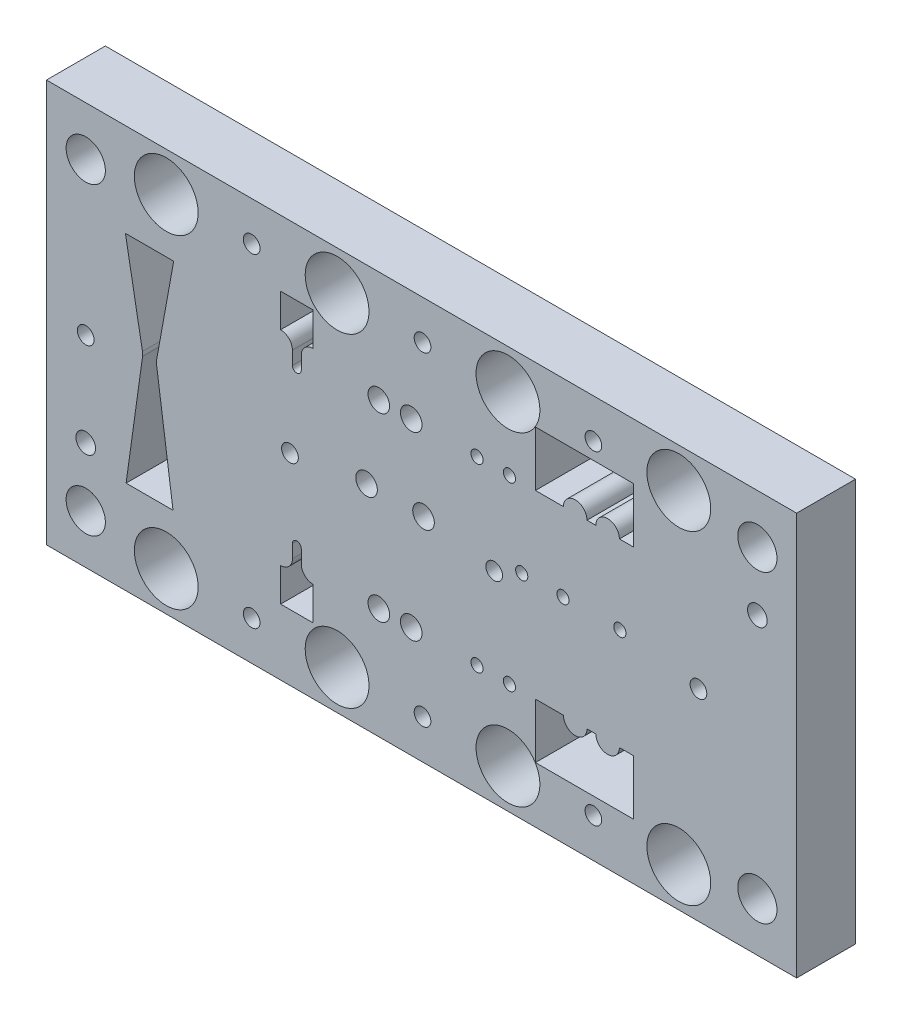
ISO-10303-21;
HEADER;
FILE_DESCRIPTION(('STEP AP214'),'2;1');
FILE_NAME('part.step','',(''),(''),'','','');
FILE_SCHEMA(('AUTOMOTIVE_DESIGN { 1 0 10303 214 1 1 1 1 }'));
ENDSEC;
DATA;
#1=APPLICATION_CONTEXT('core data for automotive mechanical design processes');
#2=APPLICATION_PROTOCOL_DEFINITION('international standard','automotive_design',2000,#1);
#3=PRODUCT_CONTEXT('',#1,'mechanical');
#4=PRODUCT('Part','Part','',(#3));
#5=PRODUCT_RELATED_PRODUCT_CATEGORY('part','',(#4));
#6=PRODUCT_DEFINITION_FORMATION('','',#4);
#7=PRODUCT_DEFINITION_CONTEXT('part definition',#1,'design');
#8=PRODUCT_DEFINITION('design','',#6,#7);
#9=PRODUCT_DEFINITION_SHAPE('','',#8);
#10=(LENGTH_UNIT() NAMED_UNIT(*) SI_UNIT(.MILLI.,.METRE.));
#11=(NAMED_UNIT(*) PLANE_ANGLE_UNIT() SI_UNIT($,.RADIAN.));
#12=(NAMED_UNIT(*) SI_UNIT($,.STERADIAN.) SOLID_ANGLE_UNIT());
#13=UNCERTAINTY_MEASURE_WITH_UNIT(LENGTH_MEASURE(1.E-05),#10,'distance_accuracy_value','');
#14=(GEOMETRIC_REPRESENTATION_CONTEXT(3) GLOBAL_UNCERTAINTY_ASSIGNED_CONTEXT((#13)) GLOBAL_UNIT_ASSIGNED_CONTEXT((#10,
#11,#12)) REPRESENTATION_CONTEXT('',''));
#15=CARTESIAN_POINT('',(0.,0.,0.));
#16=DIRECTION('',(0.,0.,1.));
#17=DIRECTION('',(1.,0.,0.));
#18=AXIS2_PLACEMENT_3D('',#15,#16,#17);
#19=CARTESIAN_POINT('',(242.,-96.5,30.));
#20=DIRECTION('',(0.,0.,-1.));
#21=DIRECTION('',(-1.,0.,0.));
#22=AXIS2_PLACEMENT_3D('',#19,#20,#21);
#23=CYLINDRICAL_SURFACE('',#22,3.09999999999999);
#24=CARTESIAN_POINT('',(242.,-96.5,30.));
#25=DIRECTION('',(0.,0.,-1.));
#26=DIRECTION('',(-1.,0.,0.));
#27=AXIS2_PLACEMENT_3D('',#24,#25,#26);
#28=CIRCLE('',#27,3.09999999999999);
#29=CARTESIAN_POINT('',(238.9,-96.5,30.));
#30=VERTEX_POINT('',#29);
#31=EDGE_CURVE('E969',#30,#30,#28,.T.);
#32=ORIENTED_EDGE('',*,*,#31,.F.);
#33=EDGE_LOOP('',(#32));
#34=FACE_BOUND('',#33,.T.);
#35=CARTESIAN_POINT('',(242.,-96.5,4.));
#36=DIRECTION('',(0.,0.,-1.));
#37=DIRECTION('',(-1.,0.,0.));
#38=AXIS2_PLACEMENT_3D('',#35,#36,#37);
#39=CIRCLE('',#38,3.09999999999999);
#40=CARTESIAN_POINT('',(238.9,-96.5,4.));
#41=VERTEX_POINT('',#40);
#42=EDGE_CURVE('E47',#41,#41,#39,.F.);
#43=ORIENTED_EDGE('',*,*,#42,.F.);
#44=EDGE_LOOP('',(#43));
#45=FACE_BOUND('',#44,.T.);
#46=ADVANCED_FACE('F43',(#34,#45),#23,.F.);
#47=CARTESIAN_POINT('',(169.25,-148.5,30.));
#48=DIRECTION('',(0.,0.,-1.));
#49=DIRECTION('',(-1.,0.,0.));
#50=AXIS2_PLACEMENT_3D('',#47,#48,#49);
#51=CYLINDRICAL_SURFACE('',#50,5.50000000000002);
#52=CARTESIAN_POINT('',(169.25,-148.5,30.));
#53=DIRECTION('',(0.,0.,-1.));
#54=DIRECTION('',(-1.,0.,0.));
#55=AXIS2_PLACEMENT_3D('',#52,#53,#54);
#56=CIRCLE('',#55,5.50000000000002);
#57=CARTESIAN_POINT('',(163.75,-148.5,30.));
#58=VERTEX_POINT('',#57);
#59=EDGE_CURVE('E538',#58,#58,#56,.T.);
#60=ORIENTED_EDGE('',*,*,#59,.F.);
#61=EDGE_LOOP('',(#60));
#62=FACE_BOUND('',#61,.T.);
#63=CARTESIAN_POINT('',(169.25,-148.5,5.));
#64=DIRECTION('',(0.,0.,-1.));
#65=DIRECTION('',(-1.,0.,0.));
#66=AXIS2_PLACEMENT_3D('',#63,#64,#65);
#67=CIRCLE('',#66,5.50000000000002);
#68=CARTESIAN_POINT('',(163.75,-148.5,5.));
#69=VERTEX_POINT('',#68);
#70=EDGE_CURVE('E791',#69,#69,#67,.F.);
#71=ORIENTED_EDGE('',*,*,#70,.F.);
#72=EDGE_LOOP('',(#71));
#73=FACE_BOUND('',#72,.T.);
#74=ADVANCED_FACE('F978',(#62,#73),#51,.F.);
#75=CARTESIAN_POINT('',(185.75,-148.5,30.));
#76=DIRECTION('',(0.,0.,-1.));
#77=DIRECTION('',(-1.,0.,0.));
#78=AXIS2_PLACEMENT_3D('',#75,#76,#77);
#79=CYLINDRICAL_SURFACE('',#78,5.50000000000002);
#80=CARTESIAN_POINT('',(185.75,-148.5,30.));
#81=DIRECTION('',(0.,0.,-1.));
#82=DIRECTION('',(-1.,0.,0.));
#83=AXIS2_PLACEMENT_3D('',#80,#81,#82);
#84=CIRCLE('',#83,5.50000000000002);
#85=CARTESIAN_POINT('',(180.25,-148.5,30.));
#86=VERTEX_POINT('',#85);
#87=EDGE_CURVE('E535',#86,#86,#84,.T.);
#88=ORIENTED_EDGE('',*,*,#87,.F.);
#89=EDGE_LOOP('',(#88));
#90=FACE_BOUND('',#89,.T.);
#91=CARTESIAN_POINT('',(185.75,-148.5,5.));
#92=DIRECTION('',(0.,0.,-1.));
#93=DIRECTION('',(-1.,0.,0.));
#94=AXIS2_PLACEMENT_3D('',#91,#92,#93);
#95=CIRCLE('',#94,5.50000000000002);
#96=CARTESIAN_POINT('',(180.25,-148.5,5.));
#97=VERTEX_POINT('',#96);
#98=EDGE_CURVE('E787',#97,#97,#95,.F.);
#99=ORIENTED_EDGE('',*,*,#98,.F.);
#100=EDGE_LOOP('',(#99));
#101=FACE_BOUND('',#100,.T.);
#102=ADVANCED_FACE('F1184',(#90,#101),#79,.F.);
#103=CARTESIAN_POINT('',(163.,-96.5,30.));
#104=DIRECTION('',(0.,0.,-1.));
#105=DIRECTION('',(-1.,0.,0.));
#106=AXIS2_PLACEMENT_3D('',#103,#104,#105);
#107=CYLINDRICAL_SURFACE('',#106,5.50000000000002);
#108=CARTESIAN_POINT('',(163.,-96.5,30.));
#109=DIRECTION('',(0.,0.,-1.));
#110=DIRECTION('',(-1.,0.,0.));
#111=AXIS2_PLACEMENT_3D('',#108,#109,#110);
#112=CIRCLE('',#111,5.50000000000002);
#113=CARTESIAN_POINT('',(157.5,-96.5,30.));
#114=VERTEX_POINT('',#113);
#115=EDGE_CURVE('E532',#114,#114,#112,.T.);
#116=ORIENTED_EDGE('',*,*,#115,.F.);
#117=EDGE_LOOP('',(#116));
#118=FACE_BOUND('',#117,.T.);
#119=CARTESIAN_POINT('',(163.,-96.5,5.));
#120=DIRECTION('',(0.,0.,-1.));
#121=DIRECTION('',(-1.,0.,0.));
#122=AXIS2_PLACEMENT_3D('',#119,#120,#121);
#123=CIRCLE('',#122,5.50000000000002);
#124=CARTESIAN_POINT('',(157.5,-96.5,5.));
#125=VERTEX_POINT('',#124);
#126=EDGE_CURVE('E782',#125,#125,#123,.F.);
#127=ORIENTED_EDGE('',*,*,#126,.F.);
#128=EDGE_LOOP('',(#127));
#129=FACE_BOUND('',#128,.T.);
#130=ADVANCED_FACE('F1180',(#118,#129),#107,.F.);
#131=CARTESIAN_POINT('',(192.,-96.5,30.));
#132=DIRECTION('',(0.,0.,-1.));
#133=DIRECTION('',(-1.,0.,0.));
#134=AXIS2_PLACEMENT_3D('',#131,#132,#133);
#135=CYLINDRICAL_SURFACE('',#134,5.50000000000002);
#136=CARTESIAN_POINT('',(192.,-96.5,30.));
#137=DIRECTION('',(0.,0.,-1.));
#138=DIRECTION('',(-1.,0.,0.));
#139=AXIS2_PLACEMENT_3D('',#136,#137,#138);
#140=CIRCLE('',#139,5.50000000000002);
#141=CARTESIAN_POINT('',(186.5,-96.5,30.));
#142=VERTEX_POINT('',#141);
#143=EDGE_CURVE('E529',#142,#142,#140,.T.);
#144=ORIENTED_EDGE('',*,*,#143,.F.);
#145=EDGE_LOOP('',(#144));
#146=FACE_BOUND('',#145,.T.);
#147=CARTESIAN_POINT('',(192.,-96.5,5.));
#148=DIRECTION('',(0.,0.,-1.));
#149=DIRECTION('',(-1.,0.,0.));
#150=AXIS2_PLACEMENT_3D('',#147,#148,#149);
#151=CIRCLE('',#150,5.50000000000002);
#152=CARTESIAN_POINT('',(186.5,-96.5,5.));
#153=VERTEX_POINT('',#152);
#154=EDGE_CURVE('E777',#153,#153,#151,.F.);
#155=ORIENTED_EDGE('',*,*,#154,.F.);
#156=EDGE_LOOP('',(#155));
#157=FACE_BOUND('',#156,.T.);
#158=ADVANCED_FACE('F1176',(#146,#157),#135,.F.);
#159=CARTESIAN_POINT('',(169.25,-56.5,30.));
#160=DIRECTION('',(0.,0.,-1.));
#161=DIRECTION('',(-1.,0.,0.));
#162=AXIS2_PLACEMENT_3D('',#159,#160,#161);
#163=CYLINDRICAL_SURFACE('',#162,5.50000000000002);
#164=CARTESIAN_POINT('',(169.25,-56.5,30.));
#165=DIRECTION('',(0.,0.,-1.));
#166=DIRECTION('',(-1.,0.,0.));
#167=AXIS2_PLACEMENT_3D('',#164,#165,#166);
#168=CIRCLE('',#167,5.50000000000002);
#169=CARTESIAN_POINT('',(163.75,-56.5,30.));
#170=VERTEX_POINT('',#169);
#171=EDGE_CURVE('E526',#170,#170,#168,.T.);
#172=ORIENTED_EDGE('',*,*,#171,.F.);
#173=EDGE_LOOP('',(#172));
#174=FACE_BOUND('',#173,.T.);
#175=CARTESIAN_POINT('',(169.25,-56.5,5.));
#176=DIRECTION('',(0.,0.,-1.));
#177=DIRECTION('',(-1.,0.,0.));
#178=AXIS2_PLACEMENT_3D('',#175,#176,#177);
#179=CIRCLE('',#178,5.50000000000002);
#180=CARTESIAN_POINT('',(163.75,-56.5,5.));
#181=VERTEX_POINT('',#180);
#182=EDGE_CURVE('E772',#181,#181,#179,.F.);
#183=ORIENTED_EDGE('',*,*,#182,.F.);
#184=EDGE_LOOP('',(#183));
#185=FACE_BOUND('',#184,.T.);
#186=ADVANCED_FACE('F1172',(#174,#185),#163,.F.);
#187=CARTESIAN_POINT('',(185.75,-56.5,30.));
#188=DIRECTION('',(0.,0.,-1.));
#189=DIRECTION('',(-1.,0.,0.));
#190=AXIS2_PLACEMENT_3D('',#187,#188,#189);
#191=CYLINDRICAL_SURFACE('',#190,5.50000000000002);
#192=CARTESIAN_POINT('',(185.75,-56.5,30.));
#193=DIRECTION('',(0.,0.,-1.));
#194=DIRECTION('',(-1.,0.,0.));
#195=AXIS2_PLACEMENT_3D('',#192,#193,#194);
#196=CIRCLE('',#195,5.50000000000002);
#197=CARTESIAN_POINT('',(180.25,-56.5,30.));
#198=VERTEX_POINT('',#197);
#199=EDGE_CURVE('E509',#198,#198,#196,.T.);
#200=ORIENTED_EDGE('',*,*,#199,.F.);
#201=EDGE_LOOP('',(#200));
#202=FACE_BOUND('',#201,.T.);
#203=CARTESIAN_POINT('',(185.75,-56.5,5.));
#204=DIRECTION('',(0.,0.,-1.));
#205=DIRECTION('',(-1.,0.,0.));
#206=AXIS2_PLACEMENT_3D('',#203,#204,#205);
#207=CIRCLE('',#206,5.50000000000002);
#208=CARTESIAN_POINT('',(180.25,-56.5,5.));
#209=VERTEX_POINT('',#208);
#210=EDGE_CURVE('E767',#209,#209,#207,.F.);
#211=ORIENTED_EDGE('',*,*,#210,.F.);
#212=EDGE_LOOP('',(#211));
#213=FACE_BOUND('',#212,.T.);
#214=ADVANCED_FACE('F1168',(#202,#213),#191,.F.);
#215=CARTESIAN_POINT('',(219.25,-148.5,30.));
#216=DIRECTION('',(0.,0.,-1.));
#217=DIRECTION('',(-1.,0.,0.));
#218=AXIS2_PLACEMENT_3D('',#215,#216,#217);
#219=CYLINDRICAL_SURFACE('',#218,3.09999999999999);
#220=CARTESIAN_POINT('',(219.25,-148.5,30.));
#221=DIRECTION('',(0.,0.,-1.));
#222=DIRECTION('',(-1.,0.,0.));
#223=AXIS2_PLACEMENT_3D('',#220,#221,#222);
#224=CIRCLE('',#223,3.09999999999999);
#225=CARTESIAN_POINT('',(216.15,-148.5,30.));
#226=VERTEX_POINT('',#225);
#227=EDGE_CURVE('E541',#226,#226,#224,.T.);
#228=ORIENTED_EDGE('',*,*,#227,.F.);
#229=EDGE_LOOP('',(#228));
#230=FACE_BOUND('',#229,.T.);
#231=CARTESIAN_POINT('',(219.25,-148.5,4.));
#232=DIRECTION('',(0.,0.,-1.));
#233=DIRECTION('',(-1.,0.,0.));
#234=AXIS2_PLACEMENT_3D('',#231,#232,#233);
#235=CIRCLE('',#234,3.09999999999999);
#236=CARTESIAN_POINT('',(216.15,-148.5,4.));
#237=VERTEX_POINT('',#236);
#238=EDGE_CURVE('E762',#237,#237,#235,.F.);
#239=ORIENTED_EDGE('',*,*,#238,.F.);
#240=EDGE_LOOP('',(#239));
#241=FACE_BOUND('',#240,.T.);
#242=ADVANCED_FACE('F1171',(#230,#241),#219,.F.);
#243=CARTESIAN_POINT('',(235.75,-148.5,30.));
#244=DIRECTION('',(0.,0.,-1.));
#245=DIRECTION('',(-1.,0.,0.));
#246=AXIS2_PLACEMENT_3D('',#243,#244,#245);
#247=CYLINDRICAL_SURFACE('',#246,3.09999999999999);
#248=CARTESIAN_POINT('',(235.75,-148.5,30.));
#249=DIRECTION('',(0.,0.,-1.));
#250=DIRECTION('',(-1.,0.,0.));
#251=AXIS2_PLACEMENT_3D('',#248,#249,#250);
#252=CIRCLE('',#251,3.09999999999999);
#253=CARTESIAN_POINT('',(232.65,-148.5,30.));
#254=VERTEX_POINT('',#253);
#255=EDGE_CURVE('E544',#254,#254,#252,.T.);
#256=ORIENTED_EDGE('',*,*,#255,.F.);
#257=EDGE_LOOP('',(#256));
#258=FACE_BOUND('',#257,.T.);
#259=CARTESIAN_POINT('',(235.75,-148.5,4.));
#260=DIRECTION('',(0.,0.,-1.));
#261=DIRECTION('',(-1.,0.,0.));
#262=AXIS2_PLACEMENT_3D('',#259,#260,#261);
#263=CIRCLE('',#262,3.09999999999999);
#264=CARTESIAN_POINT('',(232.65,-148.5,4.));
#265=VERTEX_POINT('',#264);
#266=EDGE_CURVE('E757',#265,#265,#263,.F.);
#267=ORIENTED_EDGE('',*,*,#266,.F.);
#268=EDGE_LOOP('',(#267));
#269=FACE_BOUND('',#268,.T.);
#270=ADVANCED_FACE('F1194',(#258,#269),#247,.F.);
#271=CARTESIAN_POINT('',(219.25,-56.4999999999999,30.));
#272=DIRECTION('',(0.,0.,-1.));
#273=DIRECTION('',(-1.,0.,0.));
#274=AXIS2_PLACEMENT_3D('',#271,#272,#273);
#275=CYLINDRICAL_SURFACE('',#274,3.09999999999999);
#276=CARTESIAN_POINT('',(219.25,-56.4999999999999,30.));
#277=DIRECTION('',(0.,0.,-1.));
#278=DIRECTION('',(-1.,0.,0.));
#279=AXIS2_PLACEMENT_3D('',#276,#277,#278);
#280=CIRCLE('',#279,3.09999999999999);
#281=CARTESIAN_POINT('',(216.15,-56.4999999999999,30.));
#282=VERTEX_POINT('',#281);
#283=EDGE_CURVE('E547',#282,#282,#280,.T.);
#284=ORIENTED_EDGE('',*,*,#283,.F.);
#285=EDGE_LOOP('',(#284));
#286=FACE_BOUND('',#285,.T.);
#287=CARTESIAN_POINT('',(219.25,-56.4999999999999,4.));
#288=DIRECTION('',(0.,0.,-1.));
#289=DIRECTION('',(-1.,0.,0.));
#290=AXIS2_PLACEMENT_3D('',#287,#288,#289);
#291=CIRCLE('',#290,3.09999999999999);
#292=CARTESIAN_POINT('',(216.15,-56.4999999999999,4.));
#293=VERTEX_POINT('',#292);
#294=EDGE_CURVE('E752',#293,#293,#291,.F.);
#295=ORIENTED_EDGE('',*,*,#294,.F.);
#296=EDGE_LOOP('',(#295));
#297=FACE_BOUND('',#296,.T.);
#298=ADVANCED_FACE('F1198',(#286,#297),#275,.F.);
#299=CARTESIAN_POINT('',(235.75,-56.4999999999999,30.));
#300=DIRECTION('',(0.,0.,-1.));
#301=DIRECTION('',(-1.,0.,0.));
#302=AXIS2_PLACEMENT_3D('',#299,#300,#301);
#303=CYLINDRICAL_SURFACE('',#302,3.09999999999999);
#304=CARTESIAN_POINT('',(235.75,-56.4999999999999,30.));
#305=DIRECTION('',(0.,0.,-1.));
#306=DIRECTION('',(-1.,0.,0.));
#307=AXIS2_PLACEMENT_3D('',#304,#305,#306);
#308=CIRCLE('',#307,3.09999999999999);
#309=CARTESIAN_POINT('',(232.65,-56.4999999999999,30.));
#310=VERTEX_POINT('',#309);
#311=EDGE_CURVE('E550',#310,#310,#308,.T.);
#312=ORIENTED_EDGE('',*,*,#311,.F.);
#313=EDGE_LOOP('',(#312));
#314=FACE_BOUND('',#313,.T.);
#315=CARTESIAN_POINT('',(235.75,-56.4999999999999,4.));
#316=DIRECTION('',(0.,0.,-1.));
#317=DIRECTION('',(-1.,0.,0.));
#318=AXIS2_PLACEMENT_3D('',#315,#316,#317);
#319=CIRCLE('',#318,3.09999999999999);
#320=CARTESIAN_POINT('',(232.65,-56.4999999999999,4.));
#321=VERTEX_POINT('',#320);
#322=EDGE_CURVE('E747',#321,#321,#319,.F.);
#323=ORIENTED_EDGE('',*,*,#322,.F.);
#324=EDGE_LOOP('',(#323));
#325=FACE_BOUND('',#324,.T.);
#326=ADVANCED_FACE('F1202',(#314,#325),#303,.F.);
#327=CARTESIAN_POINT('',(263.,-96.5,30.));
#328=DIRECTION('',(0.,0.,-1.));
#329=DIRECTION('',(-1.,0.,0.));
#330=AXIS2_PLACEMENT_3D('',#327,#328,#329);
#331=CYLINDRICAL_SURFACE('',#330,3.09999999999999);
#332=CARTESIAN_POINT('',(263.,-96.5,30.));
#333=DIRECTION('',(0.,0.,-1.));
#334=DIRECTION('',(-1.,0.,0.));
#335=AXIS2_PLACEMENT_3D('',#332,#333,#334);
#336=CIRCLE('',#335,3.09999999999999);
#337=CARTESIAN_POINT('',(259.9,-96.5,30.));
#338=VERTEX_POINT('',#337);
#339=EDGE_CURVE('E620',#338,#338,#336,.T.);
#340=ORIENTED_EDGE('',*,*,#339,.F.);
#341=EDGE_LOOP('',(#340));
#342=FACE_BOUND('',#341,.T.);
#343=CARTESIAN_POINT('',(263.,-96.5,4.));
#344=DIRECTION('',(0.,0.,-1.));
#345=DIRECTION('',(-1.,0.,0.));
#346=AXIS2_PLACEMENT_3D('',#343,#344,#345);
#347=CIRCLE('',#346,3.09999999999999);
#348=CARTESIAN_POINT('',(259.9,-96.5,4.));
#349=VERTEX_POINT('',#348);
#350=EDGE_CURVE('E742',#349,#349,#347,.F.);
#351=ORIENTED_EDGE('',*,*,#350,.F.);
#352=EDGE_LOOP('',(#351));
#353=FACE_BOUND('',#352,.T.);
#354=ADVANCED_FACE('F1206',(#342,#353),#331,.F.);
#355=CARTESIAN_POINT('',(292.,-96.5,30.));
#356=DIRECTION('',(0.,0.,-1.));
#357=DIRECTION('',(-1.,0.,0.));
#358=AXIS2_PLACEMENT_3D('',#355,#356,#357);
#359=CYLINDRICAL_SURFACE('',#358,3.09999999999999);
#360=CARTESIAN_POINT('',(292.,-96.5,30.));
#361=DIRECTION('',(0.,0.,-1.));
#362=DIRECTION('',(-1.,0.,0.));
#363=AXIS2_PLACEMENT_3D('',#360,#361,#362);
#364=CIRCLE('',#363,3.09999999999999);
#365=CARTESIAN_POINT('',(288.9,-96.5,30.));
#366=VERTEX_POINT('',#365);
#367=EDGE_CURVE('E603',#366,#366,#364,.T.);
#368=ORIENTED_EDGE('',*,*,#367,.F.);
#369=EDGE_LOOP('',(#368));
#370=FACE_BOUND('',#369,.T.);
#371=CARTESIAN_POINT('',(292.,-96.5,4.));
#372=DIRECTION('',(0.,0.,-1.));
#373=DIRECTION('',(-1.,0.,0.));
#374=AXIS2_PLACEMENT_3D('',#371,#372,#373);
#375=CIRCLE('',#374,3.09999999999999);
#376=CARTESIAN_POINT('',(288.9,-96.5,4.));
#377=VERTEX_POINT('',#376);
#378=EDGE_CURVE('E737',#377,#377,#375,.F.);
#379=ORIENTED_EDGE('',*,*,#378,.F.);
#380=EDGE_LOOP('',(#379));
#381=FACE_BOUND('',#380,.T.);
#382=ADVANCED_FACE('F1240',(#370,#381),#359,.F.);
#383=CARTESIAN_POINT('',(0.,0.,30.));
#384=DIRECTION('',(1.,0.,0.));
#385=DIRECTION('',(0.,1.,0.));
#386=AXIS2_PLACEMENT_3D('',#383,#384,#385);
#387=PLANE('',#386);
#388=DIRECTION('',(0.,-1.,0.));
#389=VECTOR('',#388,1.);
#390=CARTESIAN_POINT('',(0.,0.,0.));
#391=LINE('',#390,#389);
#392=CARTESIAN_POINT('',(0.,0.,0.));
#393=VERTEX_POINT('',#392);
#394=CARTESIAN_POINT('',(0.,-205.,0.));
#395=VERTEX_POINT('',#394);
#396=EDGE_CURVE('E699',#393,#395,#391,.T.);
#397=ORIENTED_EDGE('',*,*,#396,.T.);
#398=DIRECTION('',(0.,0.,-1.));
#399=VECTOR('',#398,1.);
#400=CARTESIAN_POINT('',(0.,-205.,30.));
#401=LINE('',#400,#399);
#402=CARTESIAN_POINT('',(0.,-205.,30.));
#403=VERTEX_POINT('',#402);
#404=EDGE_CURVE('E726',#403,#395,#401,.T.);
#405=ORIENTED_EDGE('',*,*,#404,.F.);
#406=DIRECTION('',(0.,-1.,0.));
#407=VECTOR('',#406,1.);
#408=CARTESIAN_POINT('',(0.,0.,30.));
#409=LINE('',#408,#407);
#410=CARTESIAN_POINT('',(0.,0.,30.));
#411=VERTEX_POINT('',#410);
#412=EDGE_CURVE('E708',#411,#403,#409,.T.);
#413=ORIENTED_EDGE('',*,*,#412,.F.);
#414=DIRECTION('',(0.,0.,-1.));
#415=VECTOR('',#414,1.);
#416=CARTESIAN_POINT('',(0.,0.,30.));
#417=LINE('',#416,#415);
#418=EDGE_CURVE('E717',#411,#393,#417,.T.);
#419=ORIENTED_EDGE('',*,*,#418,.T.);
#420=EDGE_LOOP('',(#397,#405,#413,#419));
#421=FACE_BOUND('',#420,.T.);
#422=ADVANCED_FACE('F1243',(#421),#387,.F.);
#423=CARTESIAN_POINT('',(0.,-205.,30.));
#424=DIRECTION('',(0.,1.,0.));
#425=DIRECTION('',(0.,0.,1.));
#426=AXIS2_PLACEMENT_3D('',#423,#424,#425);
#427=PLANE('',#426);
#428=DIRECTION('',(1.,0.,0.));
#429=VECTOR('',#428,1.);
#430=CARTESIAN_POINT('',(0.,-205.,0.));
#431=LINE('',#430,#429);
#432=CARTESIAN_POINT('',(382.,-205.,0.));
#433=VERTEX_POINT('',#432);
#434=EDGE_CURVE('E702',#395,#433,#431,.T.);
#435=ORIENTED_EDGE('',*,*,#434,.T.);
#436=DIRECTION('',(0.,0.,-1.));
#437=VECTOR('',#436,1.);
#438=CARTESIAN_POINT('',(382.,-205.,30.));
#439=LINE('',#438,#437);
#440=CARTESIAN_POINT('',(382.,-205.,30.));
#441=VERTEX_POINT('',#440);
#442=EDGE_CURVE('E723',#441,#433,#439,.T.);
#443=ORIENTED_EDGE('',*,*,#442,.F.);
#444=DIRECTION('',(1.,0.,0.));
#445=VECTOR('',#444,1.);
#446=CARTESIAN_POINT('',(0.,-205.,30.));
#447=LINE('',#446,#445);
#448=EDGE_CURVE('E711',#403,#441,#447,.T.);
#449=ORIENTED_EDGE('',*,*,#448,.F.);
#450=ORIENTED_EDGE('',*,*,#404,.T.);
#451=EDGE_LOOP('',(#435,#443,#449,#450));
#452=FACE_BOUND('',#451,.T.);
#453=ADVANCED_FACE('F1297',(#452),#427,.F.);
#454=CARTESIAN_POINT('',(382.,0.,30.));
#455=DIRECTION('',(-1.,0.,0.));
#456=DIRECTION('',(0.,0.,1.));
#457=AXIS2_PLACEMENT_3D('',#454,#455,#456);
#458=PLANE('',#457);
#459=DIRECTION('',(0.,1.,0.));
#460=VECTOR('',#459,1.);
#461=CARTESIAN_POINT('',(382.,0.,0.));
#462=LINE('',#461,#460);
#463=CARTESIAN_POINT('',(382.,0.,0.));
#464=VERTEX_POINT('',#463);
#465=EDGE_CURVE('E704',#433,#464,#462,.T.);
#466=ORIENTED_EDGE('',*,*,#465,.T.);
#467=DIRECTION('',(0.,0.,-1.));
#468=VECTOR('',#467,1.);
#469=CARTESIAN_POINT('',(382.,0.,30.));
#470=LINE('',#469,#468);
#471=CARTESIAN_POINT('',(382.,0.,30.));
#472=VERTEX_POINT('',#471);
#473=EDGE_CURVE('E720',#472,#464,#470,.T.);
#474=ORIENTED_EDGE('',*,*,#473,.F.);
#475=DIRECTION('',(0.,1.,0.));
#476=VECTOR('',#475,1.);
#477=CARTESIAN_POINT('',(382.,0.,30.));
#478=LINE('',#477,#476);
#479=EDGE_CURVE('E713',#441,#472,#478,.T.);
#480=ORIENTED_EDGE('',*,*,#479,.F.);
#481=ORIENTED_EDGE('',*,*,#442,.T.);
#482=EDGE_LOOP('',(#466,#474,#480,#481));
#483=FACE_BOUND('',#482,.T.);
#484=ADVANCED_FACE('F1293',(#483),#458,.F.);
#485=CARTESIAN_POINT('',(0.,0.,30.));
#486=DIRECTION('',(0.,-1.,0.));
#487=DIRECTION('',(0.,0.,-1.));
#488=AXIS2_PLACEMENT_3D('',#485,#486,#487);
#489=PLANE('',#488);
#490=DIRECTION('',(-1.,0.,0.));
#491=VECTOR('',#490,1.);
#492=CARTESIAN_POINT('',(0.,0.,0.));
#493=LINE('',#492,#491);
#494=EDGE_CURVE('E706',#464,#393,#493,.T.);
#495=ORIENTED_EDGE('',*,*,#494,.T.);
#496=ORIENTED_EDGE('',*,*,#418,.F.);
#497=DIRECTION('',(-1.,0.,0.));
#498=VECTOR('',#497,1.);
#499=CARTESIAN_POINT('',(0.,0.,30.));
#500=LINE('',#499,#498);
#501=EDGE_CURVE('E715',#472,#411,#500,.T.);
#502=ORIENTED_EDGE('',*,*,#501,.F.);
#503=ORIENTED_EDGE('',*,*,#473,.T.);
#504=EDGE_LOOP('',(#495,#496,#502,#503));
#505=FACE_BOUND('',#504,.T.);
#506=ADVANCED_FACE('F1289',(#505),#489,.F.);
#507=CARTESIAN_POINT('',(0.,-205.,30.));
#508=DIRECTION('',(0.,0.,1.));
#509=DIRECTION('',(1.,0.,0.));
#510=AXIS2_PLACEMENT_3D('',#507,#508,#509);
#511=PLANE('',#510);
#512=CARTESIAN_POINT('',(20.,-150.,30.));
#513=DIRECTION('',(0.,0.,1.));
#514=DIRECTION('',(1.,0.,0.));
#515=AXIS2_PLACEMENT_3D('',#512,#513,#514);
#516=CIRCLE('',#515,5.);
#517=CARTESIAN_POINT('',(25.,-150.,30.));
#518=VERTEX_POINT('',#517);
#519=EDGE_CURVE('E740',#518,#518,#516,.T.);
#520=ORIENTED_EDGE('',*,*,#519,.F.);
#521=EDGE_LOOP('',(#520));
#522=FACE_BOUND('',#521,.T.);
#523=CARTESIAN_POINT('',(362.,-55.0000000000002,30.));
#524=DIRECTION('',(0.,0.,1.));
#525=DIRECTION('',(1.,0.,0.));
#526=AXIS2_PLACEMENT_3D('',#523,#524,#525);
#527=CIRCLE('',#526,4.99999999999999);
#528=CARTESIAN_POINT('',(367.,-55.0000000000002,30.));
#529=VERTEX_POINT('',#528);
#530=EDGE_CURVE('E855',#529,#529,#527,.T.);
#531=ORIENTED_EDGE('',*,*,#530,.F.);
#532=EDGE_LOOP('',(#531));
#533=FACE_BOUND('',#532,.T.);
#534=CARTESIAN_POINT('',(332.,-102.500000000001,30.));
#535=DIRECTION('',(0.,0.,1.));
#536=DIRECTION('',(1.,0.,0.));
#537=AXIS2_PLACEMENT_3D('',#534,#535,#536);
#538=CIRCLE('',#537,4.24999999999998);
#539=CARTESIAN_POINT('',(336.25,-102.500000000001,30.));
#540=VERTEX_POINT('',#539);
#541=EDGE_CURVE('E864',#540,#540,#538,.T.);
#542=ORIENTED_EDGE('',*,*,#541,.F.);
#543=EDGE_LOOP('',(#542));
#544=FACE_BOUND('',#543,.T.);
#545=CARTESIAN_POINT('',(228.,-102.500000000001,30.));
#546=DIRECTION('',(0.,0.,1.));
#547=DIRECTION('',(1.,0.,0.));
#548=AXIS2_PLACEMENT_3D('',#545,#546,#547);
#549=CIRCLE('',#548,4.24999999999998);
#550=CARTESIAN_POINT('',(232.25,-102.500000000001,30.));
#551=VERTEX_POINT('',#550);
#552=EDGE_CURVE('E870',#551,#551,#549,.T.);
#553=ORIENTED_EDGE('',*,*,#552,.F.);
#554=EDGE_LOOP('',(#553));
#555=FACE_BOUND('',#554,.T.);
#556=CARTESIAN_POINT('',(124.,-102.500000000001,30.));
#557=DIRECTION('',(0.,0.,1.));
#558=DIRECTION('',(1.,0.,0.));
#559=AXIS2_PLACEMENT_3D('',#556,#557,#558);
#560=CIRCLE('',#559,4.24999999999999);
#561=CARTESIAN_POINT('',(128.25,-102.500000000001,30.));
#562=VERTEX_POINT('',#561);
#563=EDGE_CURVE('E876',#562,#562,#560,.T.);
#564=ORIENTED_EDGE('',*,*,#563,.F.);
#565=EDGE_LOOP('',(#564));
#566=FACE_BOUND('',#565,.T.);
#567=CARTESIAN_POINT('',(20.,-102.500000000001,30.));
#568=DIRECTION('',(0.,0.,1.));
#569=DIRECTION('',(1.,0.,0.));
#570=AXIS2_PLACEMENT_3D('',#567,#568,#569);
#571=CIRCLE('',#570,4.24999999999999);
#572=CARTESIAN_POINT('',(24.25,-102.500000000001,30.));
#573=VERTEX_POINT('',#572);
#574=EDGE_CURVE('E882',#573,#573,#571,.T.);
#575=ORIENTED_EDGE('',*,*,#574,.F.);
#576=EDGE_LOOP('',(#575));
#577=FACE_BOUND('',#576,.T.);
#578=CARTESIAN_POINT('',(278.5,-185.,30.));
#579=DIRECTION('',(0.,0.,1.));
#580=DIRECTION('',(1.,0.,0.));
#581=AXIS2_PLACEMENT_3D('',#578,#579,#580);
#582=CIRCLE('',#581,4.24999999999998);
#583=CARTESIAN_POINT('',(282.75,-185.,30.));
#584=VERTEX_POINT('',#583);
#585=EDGE_CURVE('E888',#584,#584,#582,.T.);
#586=ORIENTED_EDGE('',*,*,#585,.F.);
#587=EDGE_LOOP('',(#586));
#588=FACE_BOUND('',#587,.T.);
#589=CARTESIAN_POINT('',(278.5,-20.,30.));
#590=DIRECTION('',(0.,0.,1.));
#591=DIRECTION('',(1.,0.,0.));
#592=AXIS2_PLACEMENT_3D('',#589,#590,#591);
#593=CIRCLE('',#592,4.24999999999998);
#594=CARTESIAN_POINT('',(282.75,-20.,30.));
#595=VERTEX_POINT('',#594);
#596=EDGE_CURVE('E894',#595,#595,#593,.T.);
#597=ORIENTED_EDGE('',*,*,#596,.F.);
#598=EDGE_LOOP('',(#597));
#599=FACE_BOUND('',#598,.T.);
#600=CARTESIAN_POINT('',(191.5,-185.,30.));
#601=DIRECTION('',(0.,0.,1.));
#602=DIRECTION('',(1.,0.,0.));
#603=AXIS2_PLACEMENT_3D('',#600,#601,#602);
#604=CIRCLE('',#603,4.24999999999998);
#605=CARTESIAN_POINT('',(195.75,-185.,30.));
#606=VERTEX_POINT('',#605);
#607=EDGE_CURVE('E900',#606,#606,#604,.T.);
#608=ORIENTED_EDGE('',*,*,#607,.F.);
#609=EDGE_LOOP('',(#608));
#610=FACE_BOUND('',#609,.T.);
#611=CARTESIAN_POINT('',(191.5,-20.,30.));
#612=DIRECTION('',(0.,0.,1.));
#613=DIRECTION('',(1.,0.,0.));
#614=AXIS2_PLACEMENT_3D('',#611,#612,#613);
#615=CIRCLE('',#614,4.24999999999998);
#616=CARTESIAN_POINT('',(195.75,-20.,30.));
#617=VERTEX_POINT('',#616);
#618=EDGE_CURVE('E906',#617,#617,#615,.T.);
#619=ORIENTED_EDGE('',*,*,#618,.F.);
#620=EDGE_LOOP('',(#619));
#621=FACE_BOUND('',#620,.T.);
#622=CARTESIAN_POINT('',(104.5,-185.,30.));
#623=DIRECTION('',(0.,0.,1.));
#624=DIRECTION('',(1.,0.,0.));
#625=AXIS2_PLACEMENT_3D('',#622,#623,#624);
#626=CIRCLE('',#625,4.24999999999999);
#627=CARTESIAN_POINT('',(108.75,-185.,30.));
#628=VERTEX_POINT('',#627);
#629=EDGE_CURVE('E912',#628,#628,#626,.T.);
#630=ORIENTED_EDGE('',*,*,#629,.F.);
#631=EDGE_LOOP('',(#630));
#632=FACE_BOUND('',#631,.T.);
#633=CARTESIAN_POINT('',(104.5,-20.,30.));
#634=DIRECTION('',(0.,0.,1.));
#635=DIRECTION('',(1.,0.,0.));
#636=AXIS2_PLACEMENT_3D('',#633,#634,#635);
#637=CIRCLE('',#636,4.24999999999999);
#638=CARTESIAN_POINT('',(108.75,-20.,30.));
#639=VERTEX_POINT('',#638);
#640=EDGE_CURVE('E918',#639,#639,#637,.T.);
#641=ORIENTED_EDGE('',*,*,#640,.F.);
#642=EDGE_LOOP('',(#641));
#643=FACE_BOUND('',#642,.T.);
#644=CARTESIAN_POINT('',(61.,-185.,30.));
#645=DIRECTION('',(0.,0.,-1.));
#646=DIRECTION('',(-1.,0.,0.));
#647=AXIS2_PLACEMENT_3D('',#644,#645,#646);
#648=CIRCLE('',#647,16.25);
#649=CARTESIAN_POINT('',(44.75,-185.,30.));
#650=VERTEX_POINT('',#649);
#651=EDGE_CURVE('E924',#650,#650,#648,.T.);
#652=ORIENTED_EDGE('',*,*,#651,.T.);
#653=EDGE_LOOP('',(#652));
#654=FACE_BOUND('',#653,.T.);
#655=CARTESIAN_POINT('',(61.,-20.,30.));
#656=DIRECTION('',(0.,0.,-1.));
#657=DIRECTION('',(-1.,0.,0.));
#658=AXIS2_PLACEMENT_3D('',#655,#656,#657);
#659=CIRCLE('',#658,16.25);
#660=CARTESIAN_POINT('',(44.75,-20.,30.));
#661=VERTEX_POINT('',#660);
#662=EDGE_CURVE('E930',#661,#661,#659,.T.);
#663=ORIENTED_EDGE('',*,*,#662,.T.);
#664=EDGE_LOOP('',(#663));
#665=FACE_BOUND('',#664,.T.);
#666=CARTESIAN_POINT('',(148.,-185.,30.));
#667=DIRECTION('',(0.,0.,-1.));
#668=DIRECTION('',(-1.,0.,0.));
#669=AXIS2_PLACEMENT_3D('',#666,#667,#668);
#670=CIRCLE('',#669,16.25);
#671=CARTESIAN_POINT('',(131.75,-185.,30.));
#672=VERTEX_POINT('',#671);
#673=EDGE_CURVE('E936',#672,#672,#670,.T.);
#674=ORIENTED_EDGE('',*,*,#673,.T.);
#675=EDGE_LOOP('',(#674));
#676=FACE_BOUND('',#675,.T.);
#677=CARTESIAN_POINT('',(148.,-20.,30.));
#678=DIRECTION('',(0.,0.,-1.));
#679=DIRECTION('',(-1.,0.,0.));
#680=AXIS2_PLACEMENT_3D('',#677,#678,#679);
#681=CIRCLE('',#680,16.25);
#682=CARTESIAN_POINT('',(131.75,-20.,30.));
#683=VERTEX_POINT('',#682);
#684=EDGE_CURVE('E942',#683,#683,#681,.T.);
#685=ORIENTED_EDGE('',*,*,#684,.T.);
#686=EDGE_LOOP('',(#685));
#687=FACE_BOUND('',#686,.T.);
#688=CARTESIAN_POINT('',(235.,-185.,30.));
#689=DIRECTION('',(0.,0.,-1.));
#690=DIRECTION('',(-1.,0.,0.));
#691=AXIS2_PLACEMENT_3D('',#688,#689,#690);
#692=CIRCLE('',#691,16.25);
#693=CARTESIAN_POINT('',(218.75,-185.,30.));
#694=VERTEX_POINT('',#693);
#695=EDGE_CURVE('E948',#694,#694,#692,.T.);
#696=ORIENTED_EDGE('',*,*,#695,.T.);
#697=EDGE_LOOP('',(#696));
#698=FACE_BOUND('',#697,.T.);
#699=CARTESIAN_POINT('',(235.,-20.,30.));
#700=DIRECTION('',(0.,0.,-1.));
#701=DIRECTION('',(-1.,0.,0.));
#702=AXIS2_PLACEMENT_3D('',#699,#700,#701);
#703=CIRCLE('',#702,16.25);
#704=CARTESIAN_POINT('',(218.75,-20.,30.));
#705=VERTEX_POINT('',#704);
#706=EDGE_CURVE('E954',#705,#705,#703,.T.);
#707=ORIENTED_EDGE('',*,*,#706,.T.);
#708=EDGE_LOOP('',(#707));
#709=FACE_BOUND('',#708,.T.);
#710=CARTESIAN_POINT('',(322.,-185.,30.));
#711=DIRECTION('',(0.,0.,-1.));
#712=DIRECTION('',(-1.,0.,0.));
#713=AXIS2_PLACEMENT_3D('',#710,#711,#712);
#714=CIRCLE('',#713,16.25);
#715=CARTESIAN_POINT('',(305.75,-185.,30.));
#716=VERTEX_POINT('',#715);
#717=EDGE_CURVE('E960',#716,#716,#714,.T.);
#718=ORIENTED_EDGE('',*,*,#717,.T.);
#719=EDGE_LOOP('',(#718));
#720=FACE_BOUND('',#719,.T.);
#721=CARTESIAN_POINT('',(322.,-20.,30.));
#722=DIRECTION('',(0.,0.,-1.));
#723=DIRECTION('',(-1.,0.,0.));
#724=AXIS2_PLACEMENT_3D('',#721,#722,#723);
#725=CIRCLE('',#724,16.25);
#726=CARTESIAN_POINT('',(305.75,-20.,30.));
#727=VERTEX_POINT('',#726);
#728=EDGE_CURVE('E966',#727,#727,#725,.T.);
#729=ORIENTED_EDGE('',*,*,#728,.T.);
#730=EDGE_LOOP('',(#729));
#731=FACE_BOUND('',#730,.T.);
#732=ORIENTED_EDGE('',*,*,#31,.T.);
#733=EDGE_LOOP('',(#732));
#734=FACE_BOUND('',#733,.T.);
#735=DIRECTION('',(-1.,0.,0.));
#736=VECTOR('',#735,1.);
#737=CARTESIAN_POINT('',(40.5517040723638,-157.5,30.));
#738=LINE('',#737,#736);
#739=CARTESIAN_POINT('',(64.448295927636,-157.5,30.));
#740=VERTEX_POINT('',#739);
#741=CARTESIAN_POINT('',(40.5517040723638,-157.5,30.));
#742=VERTEX_POINT('',#741);
#743=EDGE_CURVE('E362',#740,#742,#738,.T.);
#744=ORIENTED_EDGE('',*,*,#743,.T.);
#745=DIRECTION('',(0.138268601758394,0.990394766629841,0.));
#746=VECTOR('',#745,1.);
#747=CARTESIAN_POINT('',(48.9327633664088,-97.4678802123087,30.));
#748=LINE('',#747,#746);
#749=CARTESIAN_POINT('',(48.9327633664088,-97.4678802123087,30.));
#750=VERTEX_POINT('',#749);
#751=EDGE_CURVE('E365',#742,#750,#748,.T.);
#752=ORIENTED_EDGE('',*,*,#751,.T.);
#753=CARTESIAN_POINT('',(41.9999999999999,-96.5,30.));
#754=DIRECTION('',(0.,0.,1.));
#755=DIRECTION('',(-1.,0.,0.));
#756=AXIS2_PLACEMENT_3D('',#753,#754,#755);
#757=CIRCLE('',#756,6.99999999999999);
#758=CARTESIAN_POINT('',(48.8872820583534,-95.2488621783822,30.));
#759=VERTEX_POINT('',#758);
#760=EDGE_CURVE('E60',#750,#759,#757,.T.);
#761=ORIENTED_EDGE('',*,*,#760,.T.);
#762=DIRECTION('',(-0.178733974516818,0.983897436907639,0.));
#763=VECTOR('',#762,1.);
#764=CARTESIAN_POINT('',(40.2132642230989,-47.5,30.));
#765=LINE('',#764,#763);
#766=CARTESIAN_POINT('',(40.2132642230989,-47.5,30.));
#767=VERTEX_POINT('',#766);
#768=EDGE_CURVE('E368',#759,#767,#765,.T.);
#769=ORIENTED_EDGE('',*,*,#768,.T.);
#770=DIRECTION('',(1.,0.,0.));
#771=VECTOR('',#770,1.);
#772=CARTESIAN_POINT('',(64.7867357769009,-47.5,30.));
#773=LINE('',#772,#771);
#774=CARTESIAN_POINT('',(64.7867357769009,-47.5,30.));
#775=VERTEX_POINT('',#774);
#776=EDGE_CURVE('E371',#767,#775,#773,.T.);
#777=ORIENTED_EDGE('',*,*,#776,.T.);
#778=DIRECTION('',(-0.178733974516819,-0.983897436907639,0.));
#779=VECTOR('',#778,1.);
#780=CARTESIAN_POINT('',(56.1127179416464,-95.2488621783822,30.));
#781=LINE('',#780,#779);
#782=CARTESIAN_POINT('',(56.1127179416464,-95.2488621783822,30.));
#783=VERTEX_POINT('',#782);
#784=EDGE_CURVE('E374',#775,#783,#781,.T.);
#785=ORIENTED_EDGE('',*,*,#784,.T.);
#786=CARTESIAN_POINT('',(62.9999999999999,-96.5,30.));
#787=DIRECTION('',(0.,0.,1.));
#788=DIRECTION('',(-1.,0.,0.));
#789=AXIS2_PLACEMENT_3D('',#786,#787,#788);
#790=CIRCLE('',#789,6.99999999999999);
#791=CARTESIAN_POINT('',(56.067236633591,-97.4678802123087,30.));
#792=VERTEX_POINT('',#791);
#793=EDGE_CURVE('E377',#783,#792,#790,.T.);
#794=ORIENTED_EDGE('',*,*,#793,.T.);
#795=DIRECTION('',(0.138268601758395,-0.990394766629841,0.));
#796=VECTOR('',#795,1.);
#797=CARTESIAN_POINT('',(64.448295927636,-157.5,30.));
#798=LINE('',#797,#796);
#799=EDGE_CURVE('E380',#792,#740,#798,.T.);
#800=ORIENTED_EDGE('',*,*,#799,.T.);
#801=EDGE_LOOP('',(#744,#752,#761,#769,#777,#785,#794,#800));
#802=FACE_BOUND('',#801,.T.);
#803=DIRECTION('',(0.,1.,0.));
#804=VECTOR('',#803,1.);
#805=CARTESIAN_POINT('',(119.25,-50.4999999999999,30.));
#806=LINE('',#805,#804);
#807=CARTESIAN_POINT('',(119.25,-50.4999999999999,30.));
#808=VERTEX_POINT('',#807);
#809=CARTESIAN_POINT('',(119.25,-33.5,30.));
#810=VERTEX_POINT('',#809);
#811=EDGE_CURVE('E418',#808,#810,#806,.T.);
#812=ORIENTED_EDGE('',*,*,#811,.T.);
#813=DIRECTION('',(1.,0.,0.));
#814=VECTOR('',#813,1.);
#815=CARTESIAN_POINT('',(119.25,-33.5,30.));
#816=LINE('',#815,#814);
#817=CARTESIAN_POINT('',(135.75,-33.5,30.));
#818=VERTEX_POINT('',#817);
#819=EDGE_CURVE('E421',#810,#818,#816,.T.);
#820=ORIENTED_EDGE('',*,*,#819,.T.);
#821=DIRECTION('',(0.,-1.,0.));
#822=VECTOR('',#821,1.);
#823=CARTESIAN_POINT('',(135.75,-33.5,30.));
#824=LINE('',#823,#822);
#825=CARTESIAN_POINT('',(135.75,-50.5,30.));
#826=VERTEX_POINT('',#825);
#827=EDGE_CURVE('E424',#818,#826,#824,.T.);
#828=ORIENTED_EDGE('',*,*,#827,.T.);
#829=CARTESIAN_POINT('',(135.75,-56.5,30.));
#830=DIRECTION('',(0.,0.,1.));
#831=DIRECTION('',(-1.,0.,0.));
#832=AXIS2_PLACEMENT_3D('',#829,#830,#831);
#833=CIRCLE('',#832,6.00000000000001);
#834=CARTESIAN_POINT('',(129.75,-56.5,30.));
#835=VERTEX_POINT('',#834);
#836=EDGE_CURVE('E427',#826,#835,#833,.T.);
#837=ORIENTED_EDGE('',*,*,#836,.T.);
#838=DIRECTION('',(0.,-1.,0.));
#839=VECTOR('',#838,1.);
#840=CARTESIAN_POINT('',(129.75,-56.5,30.));
#841=LINE('',#840,#839);
#842=CARTESIAN_POINT('',(129.75,-63.25,30.));
#843=VERTEX_POINT('',#842);
#844=EDGE_CURVE('E430',#835,#843,#841,.T.);
#845=ORIENTED_EDGE('',*,*,#844,.T.);
#846=CARTESIAN_POINT('',(127.5,-63.25,30.));
#847=DIRECTION('',(0.,0.,-1.));
#848=DIRECTION('',(-1.,0.,0.));
#849=AXIS2_PLACEMENT_3D('',#846,#847,#848);
#850=CIRCLE('',#849,2.25);
#851=CARTESIAN_POINT('',(125.25,-63.25,30.));
#852=VERTEX_POINT('',#851);
#853=EDGE_CURVE('E433',#843,#852,#850,.T.);
#854=ORIENTED_EDGE('',*,*,#853,.T.);
#855=DIRECTION('',(0.,1.,0.));
#856=VECTOR('',#855,1.);
#857=CARTESIAN_POINT('',(125.25,-63.25,30.));
#858=LINE('',#857,#856);
#859=CARTESIAN_POINT('',(125.25,-56.5,30.));
#860=VERTEX_POINT('',#859);
#861=EDGE_CURVE('E436',#852,#860,#858,.T.);
#862=ORIENTED_EDGE('',*,*,#861,.T.);
#863=CARTESIAN_POINT('',(119.25,-56.5,30.));
#864=DIRECTION('',(0.,0.,1.));
#865=DIRECTION('',(-1.,0.,0.));
#866=AXIS2_PLACEMENT_3D('',#863,#864,#865);
#867=CIRCLE('',#866,6.00000000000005);
#868=EDGE_CURVE('E439',#860,#808,#867,.T.);
#869=ORIENTED_EDGE('',*,*,#868,.T.);
#870=EDGE_LOOP('',(#812,#820,#828,#837,#845,#854,#862,#869));
#871=FACE_BOUND('',#870,.T.);
#872=CARTESIAN_POINT('',(127.5,-141.75,30.));
#873=DIRECTION('',(0.,0.,-1.));
#874=DIRECTION('',(-1.,0.,0.));
#875=AXIS2_PLACEMENT_3D('',#872,#873,#874);
#876=CIRCLE('',#875,2.25);
#877=CARTESIAN_POINT('',(125.25,-141.75,30.));
#878=VERTEX_POINT('',#877);
#879=CARTESIAN_POINT('',(129.75,-141.75,30.));
#880=VERTEX_POINT('',#879);
#881=EDGE_CURVE('E482',#878,#880,#876,.T.);
#882=ORIENTED_EDGE('',*,*,#881,.T.);
#883=DIRECTION('',(0.,-1.,0.));
#884=VECTOR('',#883,1.);
#885=CARTESIAN_POINT('',(129.75,-141.75,30.));
#886=LINE('',#885,#884);
#887=CARTESIAN_POINT('',(129.75,-148.5,30.));
#888=VERTEX_POINT('',#887);
#889=EDGE_CURVE('E485',#880,#888,#886,.T.);
#890=ORIENTED_EDGE('',*,*,#889,.T.);
#891=CARTESIAN_POINT('',(135.75,-148.5,30.));
#892=DIRECTION('',(0.,0.,1.));
#893=DIRECTION('',(-1.,0.,0.));
#894=AXIS2_PLACEMENT_3D('',#891,#892,#893);
#895=CIRCLE('',#894,6.00000000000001);
#896=CARTESIAN_POINT('',(135.75,-154.5,30.));
#897=VERTEX_POINT('',#896);
#898=EDGE_CURVE('E488',#888,#897,#895,.T.);
#899=ORIENTED_EDGE('',*,*,#898,.T.);
#900=DIRECTION('',(0.,-1.,0.));
#901=VECTOR('',#900,1.);
#902=CARTESIAN_POINT('',(135.75,-154.5,30.));
#903=LINE('',#902,#901);
#904=CARTESIAN_POINT('',(135.75,-171.5,30.));
#905=VERTEX_POINT('',#904);
#906=EDGE_CURVE('E491',#897,#905,#903,.T.);
#907=ORIENTED_EDGE('',*,*,#906,.T.);
#908=DIRECTION('',(-1.,0.,0.));
#909=VECTOR('',#908,1.);
#910=CARTESIAN_POINT('',(135.75,-171.5,30.));
#911=LINE('',#910,#909);
#912=CARTESIAN_POINT('',(119.25,-171.5,30.));
#913=VERTEX_POINT('',#912);
#914=EDGE_CURVE('E494',#905,#913,#911,.T.);
#915=ORIENTED_EDGE('',*,*,#914,.T.);
#916=DIRECTION('',(0.,1.,0.));
#917=VECTOR('',#916,1.);
#918=CARTESIAN_POINT('',(119.25,-171.5,30.));
#919=LINE('',#918,#917);
#920=CARTESIAN_POINT('',(119.25,-154.5,30.));
#921=VERTEX_POINT('',#920);
#922=EDGE_CURVE('E497',#913,#921,#919,.T.);
#923=ORIENTED_EDGE('',*,*,#922,.T.);
#924=CARTESIAN_POINT('',(119.25,-148.5,30.));
#925=DIRECTION('',(0.,0.,1.));
#926=DIRECTION('',(-1.,0.,0.));
#927=AXIS2_PLACEMENT_3D('',#924,#925,#926);
#928=CIRCLE('',#927,6.);
#929=CARTESIAN_POINT('',(125.25,-148.5,30.));
#930=VERTEX_POINT('',#929);
#931=EDGE_CURVE('E500',#921,#930,#928,.T.);
#932=ORIENTED_EDGE('',*,*,#931,.T.);
#933=DIRECTION('',(0.,1.,0.));
#934=VECTOR('',#933,1.);
#935=CARTESIAN_POINT('',(125.25,-148.5,30.));
#936=LINE('',#935,#934);
#937=EDGE_CURVE('E503',#930,#878,#936,.T.);
#938=ORIENTED_EDGE('',*,*,#937,.T.);
#939=EDGE_LOOP('',(#882,#890,#899,#907,#915,#923,#932,#938));
#940=FACE_BOUND('',#939,.T.);
#941=ORIENTED_EDGE('',*,*,#199,.T.);
#942=EDGE_LOOP('',(#941));
#943=FACE_BOUND('',#942,.T.);
#944=ORIENTED_EDGE('',*,*,#171,.T.);
#945=EDGE_LOOP('',(#944));
#946=FACE_BOUND('',#945,.T.);
#947=ORIENTED_EDGE('',*,*,#143,.T.);
#948=EDGE_LOOP('',(#947));
#949=FACE_BOUND('',#948,.T.);
#950=ORIENTED_EDGE('',*,*,#115,.T.);
#951=EDGE_LOOP('',(#950));
#952=FACE_BOUND('',#951,.T.);
#953=ORIENTED_EDGE('',*,*,#87,.T.);
#954=EDGE_LOOP('',(#953));
#955=FACE_BOUND('',#954,.T.);
#956=ORIENTED_EDGE('',*,*,#59,.T.);
#957=EDGE_LOOP('',(#956));
#958=FACE_BOUND('',#957,.T.);
#959=ORIENTED_EDGE('',*,*,#227,.T.);
#960=EDGE_LOOP('',(#959));
#961=FACE_BOUND('',#960,.T.);
#962=ORIENTED_EDGE('',*,*,#255,.T.);
#963=EDGE_LOOP('',(#962));
#964=FACE_BOUND('',#963,.T.);
#965=ORIENTED_EDGE('',*,*,#283,.T.);
#966=EDGE_LOOP('',(#965));
#967=FACE_BOUND('',#966,.T.);
#968=ORIENTED_EDGE('',*,*,#311,.T.);
#969=EDGE_LOOP('',(#968));
#970=FACE_BOUND('',#969,.T.);
#971=DIRECTION('',(0.,-1.,0.));
#972=VECTOR('',#971,1.);
#973=CARTESIAN_POINT('',(299.,-56.4999999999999,30.));
#974=LINE('',#973,#972);
#975=CARTESIAN_POINT('',(299.,-28.4999999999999,30.));
#976=VERTEX_POINT('',#975);
#977=CARTESIAN_POINT('',(299.,-56.4999999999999,30.));
#978=VERTEX_POINT('',#977);
#979=EDGE_CURVE('E576',#976,#978,#974,.T.);
#980=ORIENTED_EDGE('',*,*,#979,.T.);
#981=DIRECTION('',(-1.,0.,0.));
#982=VECTOR('',#981,1.);
#983=CARTESIAN_POINT('',(291.75,-56.4999999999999,30.));
#984=LINE('',#983,#982);
#985=CARTESIAN_POINT('',(291.75,-56.4999999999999,30.));
#986=VERTEX_POINT('',#985);
#987=EDGE_CURVE('E579',#978,#986,#984,.T.);
#988=ORIENTED_EDGE('',*,*,#987,.T.);
#989=CARTESIAN_POINT('',(285.75,-56.4999999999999,30.));
#990=DIRECTION('',(0.,0.,1.));
#991=DIRECTION('',(-1.,0.,0.));
#992=AXIS2_PLACEMENT_3D('',#989,#990,#991);
#993=CIRCLE('',#992,6.00000000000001);
#994=CARTESIAN_POINT('',(279.75,-56.4999999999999,30.));
#995=VERTEX_POINT('',#994);
#996=EDGE_CURVE('E582',#986,#995,#993,.T.);
#997=ORIENTED_EDGE('',*,*,#996,.T.);
#998=DIRECTION('',(-1.,0.,0.));
#999=VECTOR('',#998,1.);
#1000=CARTESIAN_POINT('',(275.25,-56.4999999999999,30.));
#1001=LINE('',#1000,#999);
#1002=CARTESIAN_POINT('',(275.25,-56.4999999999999,30.));
#1003=VERTEX_POINT('',#1002);
#1004=EDGE_CURVE('E585',#995,#1003,#1001,.T.);
#1005=ORIENTED_EDGE('',*,*,#1004,.T.);
#1006=CARTESIAN_POINT('',(269.25,-56.4999999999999,30.));
#1007=DIRECTION('',(0.,0.,1.));
#1008=DIRECTION('',(-1.,0.,0.));
#1009=AXIS2_PLACEMENT_3D('',#1006,#1007,#1008);
#1010=CIRCLE('',#1009,6.00000000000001);
#1011=CARTESIAN_POINT('',(263.25,-56.4999999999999,30.));
#1012=VERTEX_POINT('',#1011);
#1013=EDGE_CURVE('E588',#1003,#1012,#1010,.T.);
#1014=ORIENTED_EDGE('',*,*,#1013,.T.);
#1015=DIRECTION('',(-1.,0.,0.));
#1016=VECTOR('',#1015,1.);
#1017=CARTESIAN_POINT('',(249.,-56.4999999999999,30.));
#1018=LINE('',#1017,#1016);
#1019=CARTESIAN_POINT('',(249.,-56.4999999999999,30.));
#1020=VERTEX_POINT('',#1019);
#1021=EDGE_CURVE('E591',#1012,#1020,#1018,.T.);
#1022=ORIENTED_EDGE('',*,*,#1021,.T.);
#1023=DIRECTION('',(0.,1.,0.));
#1024=VECTOR('',#1023,1.);
#1025=CARTESIAN_POINT('',(249.,-28.4999999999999,30.));
#1026=LINE('',#1025,#1024);
#1027=CARTESIAN_POINT('',(249.,-28.4999999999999,30.));
#1028=VERTEX_POINT('',#1027);
#1029=EDGE_CURVE('E594',#1020,#1028,#1026,.T.);
#1030=ORIENTED_EDGE('',*,*,#1029,.T.);
#1031=DIRECTION('',(1.,0.,0.));
#1032=VECTOR('',#1031,1.);
#1033=CARTESIAN_POINT('',(299.,-28.4999999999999,30.));
#1034=LINE('',#1033,#1032);
#1035=EDGE_CURVE('E597',#1028,#976,#1034,.T.);
#1036=ORIENTED_EDGE('',*,*,#1035,.T.);
#1037=EDGE_LOOP('',(#980,#988,#997,#1005,#1014,#1022,#1030,#1036));
#1038=FACE_BOUND('',#1037,.T.);
#1039=ORIENTED_EDGE('',*,*,#367,.T.);
#1040=EDGE_LOOP('',(#1039));
#1041=FACE_BOUND('',#1040,.T.);
#1042=ORIENTED_EDGE('',*,*,#339,.T.);
#1043=EDGE_LOOP('',(#1042));
#1044=FACE_BOUND('',#1043,.T.);
#1045=DIRECTION('',(0.,1.,0.));
#1046=VECTOR('',#1045,1.);
#1047=CARTESIAN_POINT('',(249.,-176.5,30.));
#1048=LINE('',#1047,#1046);
#1049=CARTESIAN_POINT('',(249.,-176.5,30.));
#1050=VERTEX_POINT('',#1049);
#1051=CARTESIAN_POINT('',(249.,-148.5,30.));
#1052=VERTEX_POINT('',#1051);
#1053=EDGE_CURVE('E646',#1050,#1052,#1048,.T.);
#1054=ORIENTED_EDGE('',*,*,#1053,.T.);
#1055=DIRECTION('',(1.,0.,0.));
#1056=VECTOR('',#1055,1.);
#1057=CARTESIAN_POINT('',(249.,-148.5,30.));
#1058=LINE('',#1057,#1056);
#1059=CARTESIAN_POINT('',(263.25,-148.5,30.));
#1060=VERTEX_POINT('',#1059);
#1061=EDGE_CURVE('E649',#1052,#1060,#1058,.T.);
#1062=ORIENTED_EDGE('',*,*,#1061,.T.);
#1063=CARTESIAN_POINT('',(269.25,-148.5,30.));
#1064=DIRECTION('',(0.,0.,1.));
#1065=DIRECTION('',(-1.,0.,0.));
#1066=AXIS2_PLACEMENT_3D('',#1063,#1064,#1065);
#1067=CIRCLE('',#1066,6.00000000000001);
#1068=CARTESIAN_POINT('',(275.25,-148.5,30.));
#1069=VERTEX_POINT('',#1068);
#1070=EDGE_CURVE('E652',#1060,#1069,#1067,.T.);
#1071=ORIENTED_EDGE('',*,*,#1070,.T.);
#1072=DIRECTION('',(1.,0.,0.));
#1073=VECTOR('',#1072,1.);
#1074=CARTESIAN_POINT('',(275.25,-148.5,30.));
#1075=LINE('',#1074,#1073);
#1076=CARTESIAN_POINT('',(279.75,-148.5,30.));
#1077=VERTEX_POINT('',#1076);
#1078=EDGE_CURVE('E655',#1069,#1077,#1075,.T.);
#1079=ORIENTED_EDGE('',*,*,#1078,.T.);
#1080=CARTESIAN_POINT('',(285.75,-148.5,30.));
#1081=DIRECTION('',(0.,0.,1.));
#1082=DIRECTION('',(-1.,0.,0.));
#1083=AXIS2_PLACEMENT_3D('',#1080,#1081,#1082);
#1084=CIRCLE('',#1083,6.00000000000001);
#1085=CARTESIAN_POINT('',(291.75,-148.5,30.));
#1086=VERTEX_POINT('',#1085);
#1087=EDGE_CURVE('E658',#1077,#1086,#1084,.T.);
#1088=ORIENTED_EDGE('',*,*,#1087,.T.);
#1089=DIRECTION('',(1.,0.,0.));
#1090=VECTOR('',#1089,1.);
#1091=CARTESIAN_POINT('',(291.75,-148.5,30.));
#1092=LINE('',#1091,#1090);
#1093=CARTESIAN_POINT('',(299.,-148.5,30.));
#1094=VERTEX_POINT('',#1093);
#1095=EDGE_CURVE('E661',#1086,#1094,#1092,.T.);
#1096=ORIENTED_EDGE('',*,*,#1095,.T.);
#1097=DIRECTION('',(0.,-1.,0.));
#1098=VECTOR('',#1097,1.);
#1099=CARTESIAN_POINT('',(299.,-148.5,30.));
#1100=LINE('',#1099,#1098);
#1101=CARTESIAN_POINT('',(299.,-176.5,30.));
#1102=VERTEX_POINT('',#1101);
#1103=EDGE_CURVE('E664',#1094,#1102,#1100,.T.);
#1104=ORIENTED_EDGE('',*,*,#1103,.T.);
#1105=DIRECTION('',(-1.,0.,0.));
#1106=VECTOR('',#1105,1.);
#1107=CARTESIAN_POINT('',(299.,-176.5,30.));
#1108=LINE('',#1107,#1106);
#1109=EDGE_CURVE('E667',#1102,#1050,#1108,.T.);
#1110=ORIENTED_EDGE('',*,*,#1109,.T.);
#1111=EDGE_LOOP('',(#1054,#1062,#1071,#1079,#1088,#1096,#1104,#1110));
#1112=FACE_BOUND('',#1111,.T.);
#1113=CARTESIAN_POINT('',(20.,-180.,30.));
#1114=DIRECTION('',(0.,0.,1.));
#1115=DIRECTION('',(1.,0.,0.));
#1116=AXIS2_PLACEMENT_3D('',#1113,#1114,#1115);
#1117=CIRCLE('',#1116,9.99999999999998);
#1118=CARTESIAN_POINT('',(29.9999999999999,-180.,30.));
#1119=VERTEX_POINT('',#1118);
#1120=EDGE_CURVE('E690',#1119,#1119,#1117,.T.);
#1121=ORIENTED_EDGE('',*,*,#1120,.F.);
#1122=EDGE_LOOP('',(#1121));
#1123=FACE_BOUND('',#1122,.T.);
#1124=CARTESIAN_POINT('',(362.,-180.,30.));
#1125=DIRECTION('',(0.,0.,1.));
#1126=DIRECTION('',(1.,0.,0.));
#1127=AXIS2_PLACEMENT_3D('',#1124,#1125,#1126);
#1128=CIRCLE('',#1127,9.99999999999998);
#1129=CARTESIAN_POINT('',(372.,-180.,30.));
#1130=VERTEX_POINT('',#1129);
#1131=EDGE_CURVE('E693',#1130,#1130,#1128,.T.);
#1132=ORIENTED_EDGE('',*,*,#1131,.F.);
#1133=EDGE_LOOP('',(#1132));
#1134=FACE_BOUND('',#1133,.T.);
#1135=ORIENTED_EDGE('',*,*,#412,.T.);
#1136=ORIENTED_EDGE('',*,*,#448,.T.);
#1137=ORIENTED_EDGE('',*,*,#479,.T.);
#1138=ORIENTED_EDGE('',*,*,#501,.T.);
#1139=EDGE_LOOP('',(#1135,#1136,#1137,#1138));
#1140=FACE_BOUND('',#1139,.T.);
#1141=CARTESIAN_POINT('',(362.,-25.,30.));
#1142=DIRECTION('',(0.,0.,1.));
#1143=DIRECTION('',(1.,0.,0.));
#1144=AXIS2_PLACEMENT_3D('',#1141,#1142,#1143);
#1145=CIRCLE('',#1144,9.99999999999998);
#1146=CARTESIAN_POINT('',(372.,-25.,30.));
#1147=VERTEX_POINT('',#1146);
#1148=EDGE_CURVE('E732',#1147,#1147,#1145,.T.);
#1149=ORIENTED_EDGE('',*,*,#1148,.F.);
#1150=EDGE_LOOP('',(#1149));
#1151=FACE_BOUND('',#1150,.T.);
#1152=CARTESIAN_POINT('',(20.,-25.,30.));
#1153=DIRECTION('',(0.,0.,1.));
#1154=DIRECTION('',(1.,0.,0.));
#1155=AXIS2_PLACEMENT_3D('',#1152,#1153,#1154);
#1156=CIRCLE('',#1155,9.99999999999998);
#1157=CARTESIAN_POINT('',(29.9999999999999,-25.,30.));
#1158=VERTEX_POINT('',#1157);
#1159=EDGE_CURVE('E13',#1158,#1158,#1156,.T.);
#1160=ORIENTED_EDGE('',*,*,#1159,.F.);
#1161=EDGE_LOOP('',(#1160));
#1162=FACE_BOUND('',#1161,.T.);
#1163=ADVANCED_FACE('F973',(#522,#533,#544,#555,#566,#577,#588,#599,#610,#621,#632,#643,#654,
#665,#676,#687,#698,#709,#720,#731,#734,#802,#871,#940,#943,#946,#949,#952,#955,#958,#961,#964,
#967,#970,#1038,#1041,#1044,#1112,#1123,#1134,#1140,#1151,#1162),#511,.T.);
#1164=CARTESIAN_POINT('',(0.,-205.,0.));
#1165=DIRECTION('',(0.,0.,1.));
#1166=DIRECTION('',(1.,0.,0.));
#1167=AXIS2_PLACEMENT_3D('',#1164,#1165,#1166);
#1168=PLANE('',#1167);
#1169=CARTESIAN_POINT('',(242.,-96.5,0.));
#1170=DIRECTION('',(0.,0.,-1.));
#1171=DIRECTION('',(-1.,0.,0.));
#1172=AXIS2_PLACEMENT_3D('',#1169,#1170,#1171);
#1173=CIRCLE('',#1172,4.99999999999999);
#1174=CARTESIAN_POINT('',(237.,-96.5,0.));
#1175=VERTEX_POINT('',#1174);
#1176=EDGE_CURVE('E985',#1175,#1175,#1173,.T.);
#1177=ORIENTED_EDGE('',*,*,#1176,.F.);
#1178=EDGE_LOOP('',(#1177));
#1179=FACE_BOUND('',#1178,.T.);
#1180=CARTESIAN_POINT('',(169.25,-148.5,0.));
#1181=DIRECTION('',(0.,0.,-1.));
#1182=DIRECTION('',(-1.,0.,0.));
#1183=AXIS2_PLACEMENT_3D('',#1180,#1181,#1182);
#1184=CIRCLE('',#1183,7.50000000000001);
#1185=CARTESIAN_POINT('',(161.75,-148.5,0.));
#1186=VERTEX_POINT('',#1185);
#1187=EDGE_CURVE('E800',#1186,#1186,#1184,.T.);
#1188=ORIENTED_EDGE('',*,*,#1187,.F.);
#1189=EDGE_LOOP('',(#1188));
#1190=FACE_BOUND('',#1189,.T.);
#1191=CARTESIAN_POINT('',(185.75,-148.5,0.));
#1192=DIRECTION('',(0.,0.,-1.));
#1193=DIRECTION('',(-1.,0.,0.));
#1194=AXIS2_PLACEMENT_3D('',#1191,#1192,#1193);
#1195=CIRCLE('',#1194,7.50000000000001);
#1196=CARTESIAN_POINT('',(178.25,-148.5,0.));
#1197=VERTEX_POINT('',#1196);
#1198=EDGE_CURVE('E793',#1197,#1197,#1195,.T.);
#1199=ORIENTED_EDGE('',*,*,#1198,.F.);
#1200=EDGE_LOOP('',(#1199));
#1201=FACE_BOUND('',#1200,.T.);
#1202=CARTESIAN_POINT('',(163.,-96.5,0.));
#1203=DIRECTION('',(0.,0.,-1.));
#1204=DIRECTION('',(-1.,0.,0.));
#1205=AXIS2_PLACEMENT_3D('',#1202,#1203,#1204);
#1206=CIRCLE('',#1205,7.50000000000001);
#1207=CARTESIAN_POINT('',(155.5,-96.5,0.));
#1208=VERTEX_POINT('',#1207);
#1209=EDGE_CURVE('E789',#1208,#1208,#1206,.T.);
#1210=ORIENTED_EDGE('',*,*,#1209,.F.);
#1211=EDGE_LOOP('',(#1210));
#1212=FACE_BOUND('',#1211,.T.);
#1213=CARTESIAN_POINT('',(192.,-96.5,0.));
#1214=DIRECTION('',(0.,0.,-1.));
#1215=DIRECTION('',(-1.,0.,0.));
#1216=AXIS2_PLACEMENT_3D('',#1213,#1214,#1215);
#1217=CIRCLE('',#1216,7.50000000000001);
#1218=CARTESIAN_POINT('',(184.5,-96.5,0.));
#1219=VERTEX_POINT('',#1218);
#1220=EDGE_CURVE('E785',#1219,#1219,#1217,.T.);
#1221=ORIENTED_EDGE('',*,*,#1220,.F.);
#1222=EDGE_LOOP('',(#1221));
#1223=FACE_BOUND('',#1222,.T.);
#1224=CARTESIAN_POINT('',(169.25,-56.5,0.));
#1225=DIRECTION('',(0.,0.,-1.));
#1226=DIRECTION('',(-1.,0.,0.));
#1227=AXIS2_PLACEMENT_3D('',#1224,#1225,#1226);
#1228=CIRCLE('',#1227,7.50000000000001);
#1229=CARTESIAN_POINT('',(161.75,-56.5,0.));
#1230=VERTEX_POINT('',#1229);
#1231=EDGE_CURVE('E780',#1230,#1230,#1228,.T.);
#1232=ORIENTED_EDGE('',*,*,#1231,.F.);
#1233=EDGE_LOOP('',(#1232));
#1234=FACE_BOUND('',#1233,.T.);
#1235=CARTESIAN_POINT('',(185.75,-56.5,0.));
#1236=DIRECTION('',(0.,0.,-1.));
#1237=DIRECTION('',(-1.,0.,0.));
#1238=AXIS2_PLACEMENT_3D('',#1235,#1236,#1237);
#1239=CIRCLE('',#1238,7.50000000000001);
#1240=CARTESIAN_POINT('',(178.25,-56.5,0.));
#1241=VERTEX_POINT('',#1240);
#1242=EDGE_CURVE('E775',#1241,#1241,#1239,.T.);
#1243=ORIENTED_EDGE('',*,*,#1242,.F.);
#1244=EDGE_LOOP('',(#1243));
#1245=FACE_BOUND('',#1244,.T.);
#1246=CARTESIAN_POINT('',(219.25,-148.5,0.));
#1247=DIRECTION('',(0.,0.,-1.));
#1248=DIRECTION('',(-1.,0.,0.));
#1249=AXIS2_PLACEMENT_3D('',#1246,#1247,#1248);
#1250=CIRCLE('',#1249,5.00000000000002);
#1251=CARTESIAN_POINT('',(214.25,-148.5,0.));
#1252=VERTEX_POINT('',#1251);
#1253=EDGE_CURVE('E770',#1252,#1252,#1250,.T.);
#1254=ORIENTED_EDGE('',*,*,#1253,.F.);
#1255=EDGE_LOOP('',(#1254));
#1256=FACE_BOUND('',#1255,.T.);
#1257=CARTESIAN_POINT('',(235.75,-148.500000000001,0.));
#1258=DIRECTION('',(0.,0.,-1.));
#1259=DIRECTION('',(-1.,0.,0.));
#1260=AXIS2_PLACEMENT_3D('',#1257,#1258,#1259);
#1261=CIRCLE('',#1260,5.00000000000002);
#1262=CARTESIAN_POINT('',(230.75,-148.500000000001,0.));
#1263=VERTEX_POINT('',#1262);
#1264=EDGE_CURVE('E765',#1263,#1263,#1261,.T.);
#1265=ORIENTED_EDGE('',*,*,#1264,.F.);
#1266=EDGE_LOOP('',(#1265));
#1267=FACE_BOUND('',#1266,.T.);
#1268=CARTESIAN_POINT('',(219.25,-56.5000000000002,0.));
#1269=DIRECTION('',(0.,0.,-1.));
#1270=DIRECTION('',(-1.,0.,0.));
#1271=AXIS2_PLACEMENT_3D('',#1268,#1269,#1270);
#1272=CIRCLE('',#1271,5.00000000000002);
#1273=CARTESIAN_POINT('',(214.25,-56.5000000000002,0.));
#1274=VERTEX_POINT('',#1273);
#1275=EDGE_CURVE('E760',#1274,#1274,#1272,.T.);
#1276=ORIENTED_EDGE('',*,*,#1275,.F.);
#1277=EDGE_LOOP('',(#1276));
#1278=FACE_BOUND('',#1277,.T.);
#1279=CARTESIAN_POINT('',(235.75,-56.5000000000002,0.));
#1280=DIRECTION('',(0.,0.,-1.));
#1281=DIRECTION('',(-1.,0.,0.));
#1282=AXIS2_PLACEMENT_3D('',#1279,#1280,#1281);
#1283=CIRCLE('',#1282,5.00000000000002);
#1284=CARTESIAN_POINT('',(230.75,-56.5000000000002,0.));
#1285=VERTEX_POINT('',#1284);
#1286=EDGE_CURVE('E755',#1285,#1285,#1283,.T.);
#1287=ORIENTED_EDGE('',*,*,#1286,.F.);
#1288=EDGE_LOOP('',(#1287));
#1289=FACE_BOUND('',#1288,.T.);
#1290=CARTESIAN_POINT('',(263.0530199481,-96.5000000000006,0.));
#1291=DIRECTION('',(0.,0.,-1.));
#1292=DIRECTION('',(-1.,0.,0.));
#1293=AXIS2_PLACEMENT_3D('',#1290,#1291,#1292);
#1294=CIRCLE('',#1293,4.99999999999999);
#1295=CARTESIAN_POINT('',(258.0530199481,-96.5000000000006,0.));
#1296=VERTEX_POINT('',#1295);
#1297=EDGE_CURVE('E750',#1296,#1296,#1294,.T.);
#1298=ORIENTED_EDGE('',*,*,#1297,.F.);
#1299=EDGE_LOOP('',(#1298));
#1300=FACE_BOUND('',#1299,.T.);
#1301=CARTESIAN_POINT('',(292.,-96.5000000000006,0.));
#1302=DIRECTION('',(0.,0.,-1.));
#1303=DIRECTION('',(-1.,0.,0.));
#1304=AXIS2_PLACEMENT_3D('',#1301,#1302,#1303);
#1305=CIRCLE('',#1304,4.99999999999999);
#1306=CARTESIAN_POINT('',(287.,-96.5000000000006,0.));
#1307=VERTEX_POINT('',#1306);
#1308=EDGE_CURVE('E745',#1307,#1307,#1305,.T.);
#1309=ORIENTED_EDGE('',*,*,#1308,.F.);
#1310=EDGE_LOOP('',(#1309));
#1311=FACE_BOUND('',#1310,.T.);
#1312=CARTESIAN_POINT('',(20.,-150.,0.));
#1313=DIRECTION('',(0.,0.,1.));
#1314=DIRECTION('',(1.,0.,0.));
#1315=AXIS2_PLACEMENT_3D('',#1312,#1313,#1314);
#1316=CIRCLE('',#1315,5.);
#1317=CARTESIAN_POINT('',(25.,-150.,0.));
#1318=VERTEX_POINT('',#1317);
#1319=EDGE_CURVE('E852',#1318,#1318,#1316,.T.);
#1320=ORIENTED_EDGE('',*,*,#1319,.T.);
#1321=EDGE_LOOP('',(#1320));
#1322=FACE_BOUND('',#1321,.T.);
#1323=CARTESIAN_POINT('',(362.,-55.0000000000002,0.));
#1324=DIRECTION('',(0.,0.,1.));
#1325=DIRECTION('',(1.,0.,0.));
#1326=AXIS2_PLACEMENT_3D('',#1323,#1324,#1325);
#1327=CIRCLE('',#1326,4.99999999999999);
#1328=CARTESIAN_POINT('',(367.,-55.0000000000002,0.));
#1329=VERTEX_POINT('',#1328);
#1330=EDGE_CURVE('E858',#1329,#1329,#1327,.T.);
#1331=ORIENTED_EDGE('',*,*,#1330,.T.);
#1332=EDGE_LOOP('',(#1331));
#1333=FACE_BOUND('',#1332,.T.);
#1334=CARTESIAN_POINT('',(332.,-102.500000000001,0.));
#1335=DIRECTION('',(0.,0.,1.));
#1336=DIRECTION('',(1.,0.,0.));
#1337=AXIS2_PLACEMENT_3D('',#1334,#1335,#1336);
#1338=CIRCLE('',#1337,4.24999999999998);
#1339=CARTESIAN_POINT('',(336.25,-102.500000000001,0.));
#1340=VERTEX_POINT('',#1339);
#1341=EDGE_CURVE('E861',#1340,#1340,#1338,.T.);
#1342=ORIENTED_EDGE('',*,*,#1341,.T.);
#1343=EDGE_LOOP('',(#1342));
#1344=FACE_BOUND('',#1343,.T.);
#1345=CARTESIAN_POINT('',(228.,-102.500000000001,0.));
#1346=DIRECTION('',(0.,0.,1.));
#1347=DIRECTION('',(1.,0.,0.));
#1348=AXIS2_PLACEMENT_3D('',#1345,#1346,#1347);
#1349=CIRCLE('',#1348,4.25);
#1350=CARTESIAN_POINT('',(232.25,-102.500000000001,0.));
#1351=VERTEX_POINT('',#1350);
#1352=EDGE_CURVE('E867',#1351,#1351,#1349,.T.);
#1353=ORIENTED_EDGE('',*,*,#1352,.T.);
#1354=EDGE_LOOP('',(#1353));
#1355=FACE_BOUND('',#1354,.T.);
#1356=CARTESIAN_POINT('',(124.,-102.500000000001,0.));
#1357=DIRECTION('',(0.,0.,1.));
#1358=DIRECTION('',(1.,0.,0.));
#1359=AXIS2_PLACEMENT_3D('',#1356,#1357,#1358);
#1360=CIRCLE('',#1359,4.24999999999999);
#1361=CARTESIAN_POINT('',(128.25,-102.500000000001,0.));
#1362=VERTEX_POINT('',#1361);
#1363=EDGE_CURVE('E873',#1362,#1362,#1360,.T.);
#1364=ORIENTED_EDGE('',*,*,#1363,.T.);
#1365=EDGE_LOOP('',(#1364));
#1366=FACE_BOUND('',#1365,.T.);
#1367=CARTESIAN_POINT('',(20.,-102.500000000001,0.));
#1368=DIRECTION('',(0.,0.,1.));
#1369=DIRECTION('',(1.,0.,0.));
#1370=AXIS2_PLACEMENT_3D('',#1367,#1368,#1369);
#1371=CIRCLE('',#1370,4.24999999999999);
#1372=CARTESIAN_POINT('',(24.25,-102.500000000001,0.));
#1373=VERTEX_POINT('',#1372);
#1374=EDGE_CURVE('E879',#1373,#1373,#1371,.T.);
#1375=ORIENTED_EDGE('',*,*,#1374,.T.);
#1376=EDGE_LOOP('',(#1375));
#1377=FACE_BOUND('',#1376,.T.);
#1378=CARTESIAN_POINT('',(278.5,-185.,0.));
#1379=DIRECTION('',(0.,0.,1.));
#1380=DIRECTION('',(1.,0.,0.));
#1381=AXIS2_PLACEMENT_3D('',#1378,#1379,#1380);
#1382=CIRCLE('',#1381,4.24999999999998);
#1383=CARTESIAN_POINT('',(282.75,-185.,0.));
#1384=VERTEX_POINT('',#1383);
#1385=EDGE_CURVE('E885',#1384,#1384,#1382,.T.);
#1386=ORIENTED_EDGE('',*,*,#1385,.T.);
#1387=EDGE_LOOP('',(#1386));
#1388=FACE_BOUND('',#1387,.T.);
#1389=CARTESIAN_POINT('',(278.5,-20.,0.));
#1390=DIRECTION('',(0.,0.,1.));
#1391=DIRECTION('',(1.,0.,0.));
#1392=AXIS2_PLACEMENT_3D('',#1389,#1390,#1391);
#1393=CIRCLE('',#1392,4.24999999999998);
#1394=CARTESIAN_POINT('',(282.75,-20.,0.));
#1395=VERTEX_POINT('',#1394);
#1396=EDGE_CURVE('E891',#1395,#1395,#1393,.T.);
#1397=ORIENTED_EDGE('',*,*,#1396,.T.);
#1398=EDGE_LOOP('',(#1397));
#1399=FACE_BOUND('',#1398,.T.);
#1400=CARTESIAN_POINT('',(191.5,-185.,0.));
#1401=DIRECTION('',(0.,0.,1.));
#1402=DIRECTION('',(1.,0.,0.));
#1403=AXIS2_PLACEMENT_3D('',#1400,#1401,#1402);
#1404=CIRCLE('',#1403,4.25);
#1405=CARTESIAN_POINT('',(195.75,-185.,0.));
#1406=VERTEX_POINT('',#1405);
#1407=EDGE_CURVE('E897',#1406,#1406,#1404,.T.);
#1408=ORIENTED_EDGE('',*,*,#1407,.T.);
#1409=EDGE_LOOP('',(#1408));
#1410=FACE_BOUND('',#1409,.T.);
#1411=CARTESIAN_POINT('',(191.5,-20.,0.));
#1412=DIRECTION('',(0.,0.,1.));
#1413=DIRECTION('',(1.,0.,0.));
#1414=AXIS2_PLACEMENT_3D('',#1411,#1412,#1413);
#1415=CIRCLE('',#1414,4.25);
#1416=CARTESIAN_POINT('',(195.75,-20.,0.));
#1417=VERTEX_POINT('',#1416);
#1418=EDGE_CURVE('E903',#1417,#1417,#1415,.T.);
#1419=ORIENTED_EDGE('',*,*,#1418,.T.);
#1420=EDGE_LOOP('',(#1419));
#1421=FACE_BOUND('',#1420,.T.);
#1422=CARTESIAN_POINT('',(104.5,-185.,0.));
#1423=DIRECTION('',(0.,0.,1.));
#1424=DIRECTION('',(1.,0.,0.));
#1425=AXIS2_PLACEMENT_3D('',#1422,#1423,#1424);
#1426=CIRCLE('',#1425,4.24999999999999);
#1427=CARTESIAN_POINT('',(108.75,-185.,0.));
#1428=VERTEX_POINT('',#1427);
#1429=EDGE_CURVE('E909',#1428,#1428,#1426,.T.);
#1430=ORIENTED_EDGE('',*,*,#1429,.T.);
#1431=EDGE_LOOP('',(#1430));
#1432=FACE_BOUND('',#1431,.T.);
#1433=CARTESIAN_POINT('',(104.5,-20.,0.));
#1434=DIRECTION('',(0.,0.,1.));
#1435=DIRECTION('',(1.,0.,0.));
#1436=AXIS2_PLACEMENT_3D('',#1433,#1434,#1435);
#1437=CIRCLE('',#1436,4.24999999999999);
#1438=CARTESIAN_POINT('',(108.75,-20.,0.));
#1439=VERTEX_POINT('',#1438);
#1440=EDGE_CURVE('E915',#1439,#1439,#1437,.T.);
#1441=ORIENTED_EDGE('',*,*,#1440,.T.);
#1442=EDGE_LOOP('',(#1441));
#1443=FACE_BOUND('',#1442,.T.);
#1444=CARTESIAN_POINT('',(61.,-185.,0.));
#1445=DIRECTION('',(0.,0.,-1.));
#1446=DIRECTION('',(-1.,0.,0.));
#1447=AXIS2_PLACEMENT_3D('',#1444,#1445,#1446);
#1448=CIRCLE('',#1447,16.25);
#1449=CARTESIAN_POINT('',(44.75,-185.,0.));
#1450=VERTEX_POINT('',#1449);
#1451=EDGE_CURVE('E921',#1450,#1450,#1448,.T.);
#1452=ORIENTED_EDGE('',*,*,#1451,.F.);
#1453=EDGE_LOOP('',(#1452));
#1454=FACE_BOUND('',#1453,.T.);
#1455=CARTESIAN_POINT('',(61.,-20.,0.));
#1456=DIRECTION('',(0.,0.,-1.));
#1457=DIRECTION('',(-1.,0.,0.));
#1458=AXIS2_PLACEMENT_3D('',#1455,#1456,#1457);
#1459=CIRCLE('',#1458,16.25);
#1460=CARTESIAN_POINT('',(44.75,-20.,0.));
#1461=VERTEX_POINT('',#1460);
#1462=EDGE_CURVE('E927',#1461,#1461,#1459,.T.);
#1463=ORIENTED_EDGE('',*,*,#1462,.F.);
#1464=EDGE_LOOP('',(#1463));
#1465=FACE_BOUND('',#1464,.T.);
#1466=CARTESIAN_POINT('',(148.,-185.,0.));
#1467=DIRECTION('',(0.,0.,-1.));
#1468=DIRECTION('',(-1.,0.,0.));
#1469=AXIS2_PLACEMENT_3D('',#1466,#1467,#1468);
#1470=CIRCLE('',#1469,16.25);
#1471=CARTESIAN_POINT('',(131.75,-185.,0.));
#1472=VERTEX_POINT('',#1471);
#1473=EDGE_CURVE('E933',#1472,#1472,#1470,.T.);
#1474=ORIENTED_EDGE('',*,*,#1473,.F.);
#1475=EDGE_LOOP('',(#1474));
#1476=FACE_BOUND('',#1475,.T.);
#1477=CARTESIAN_POINT('',(148.,-20.,0.));
#1478=DIRECTION('',(0.,0.,-1.));
#1479=DIRECTION('',(-1.,0.,0.));
#1480=AXIS2_PLACEMENT_3D('',#1477,#1478,#1479);
#1481=CIRCLE('',#1480,16.25);
#1482=CARTESIAN_POINT('',(131.75,-20.,0.));
#1483=VERTEX_POINT('',#1482);
#1484=EDGE_CURVE('E939',#1483,#1483,#1481,.T.);
#1485=ORIENTED_EDGE('',*,*,#1484,.F.);
#1486=EDGE_LOOP('',(#1485));
#1487=FACE_BOUND('',#1486,.T.);
#1488=CARTESIAN_POINT('',(235.,-185.,0.));
#1489=DIRECTION('',(0.,0.,-1.));
#1490=DIRECTION('',(-1.,0.,0.));
#1491=AXIS2_PLACEMENT_3D('',#1488,#1489,#1490);
#1492=CIRCLE('',#1491,16.25);
#1493=CARTESIAN_POINT('',(218.75,-185.,0.));
#1494=VERTEX_POINT('',#1493);
#1495=EDGE_CURVE('E945',#1494,#1494,#1492,.T.);
#1496=ORIENTED_EDGE('',*,*,#1495,.F.);
#1497=EDGE_LOOP('',(#1496));
#1498=FACE_BOUND('',#1497,.T.);
#1499=CARTESIAN_POINT('',(235.,-20.,0.));
#1500=DIRECTION('',(0.,0.,-1.));
#1501=DIRECTION('',(-1.,0.,0.));
#1502=AXIS2_PLACEMENT_3D('',#1499,#1500,#1501);
#1503=CIRCLE('',#1502,16.25);
#1504=CARTESIAN_POINT('',(218.75,-20.,0.));
#1505=VERTEX_POINT('',#1504);
#1506=EDGE_CURVE('E951',#1505,#1505,#1503,.T.);
#1507=ORIENTED_EDGE('',*,*,#1506,.F.);
#1508=EDGE_LOOP('',(#1507));
#1509=FACE_BOUND('',#1508,.T.);
#1510=CARTESIAN_POINT('',(322.,-185.,0.));
#1511=DIRECTION('',(0.,0.,-1.));
#1512=DIRECTION('',(-1.,0.,0.));
#1513=AXIS2_PLACEMENT_3D('',#1510,#1511,#1512);
#1514=CIRCLE('',#1513,16.25);
#1515=CARTESIAN_POINT('',(305.75,-185.,0.));
#1516=VERTEX_POINT('',#1515);
#1517=EDGE_CURVE('E957',#1516,#1516,#1514,.T.);
#1518=ORIENTED_EDGE('',*,*,#1517,.F.);
#1519=EDGE_LOOP('',(#1518));
#1520=FACE_BOUND('',#1519,.T.);
#1521=CARTESIAN_POINT('',(322.,-20.,0.));
#1522=DIRECTION('',(0.,0.,-1.));
#1523=DIRECTION('',(-1.,0.,0.));
#1524=AXIS2_PLACEMENT_3D('',#1521,#1522,#1523);
#1525=CIRCLE('',#1524,16.25);
#1526=CARTESIAN_POINT('',(305.75,-20.,0.));
#1527=VERTEX_POINT('',#1526);
#1528=EDGE_CURVE('E963',#1527,#1527,#1525,.T.);
#1529=ORIENTED_EDGE('',*,*,#1528,.F.);
#1530=EDGE_LOOP('',(#1529));
#1531=FACE_BOUND('',#1530,.T.);
#1532=DIRECTION('',(0.138268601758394,0.990394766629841,0.));
#1533=VECTOR('',#1532,1.);
#1534=CARTESIAN_POINT('',(48.9327633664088,-97.4678802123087,0.));
#1535=LINE('',#1534,#1533);
#1536=CARTESIAN_POINT('',(40.5517040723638,-157.5,0.));
#1537=VERTEX_POINT('',#1536);
#1538=CARTESIAN_POINT('',(48.9327633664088,-97.4678802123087,0.));
#1539=VERTEX_POINT('',#1538);
#1540=EDGE_CURVE('E337',#1537,#1539,#1535,.T.);
#1541=ORIENTED_EDGE('',*,*,#1540,.F.);
#1542=DIRECTION('',(-1.,0.,0.));
#1543=VECTOR('',#1542,1.);
#1544=CARTESIAN_POINT('',(40.5517040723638,-157.5,0.));
#1545=LINE('',#1544,#1543);
#1546=CARTESIAN_POINT('',(64.448295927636,-157.5,0.));
#1547=VERTEX_POINT('',#1546);
#1548=EDGE_CURVE('E68',#1547,#1537,#1545,.T.);
#1549=ORIENTED_EDGE('',*,*,#1548,.F.);
#1550=DIRECTION('',(0.138268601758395,-0.990394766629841,0.));
#1551=VECTOR('',#1550,1.);
#1552=CARTESIAN_POINT('',(64.448295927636,-157.5,0.));
#1553=LINE('',#1552,#1551);
#1554=CARTESIAN_POINT('',(56.067236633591,-97.4678802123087,0.));
#1555=VERTEX_POINT('',#1554);
#1556=EDGE_CURVE('E359',#1555,#1547,#1553,.T.);
#1557=ORIENTED_EDGE('',*,*,#1556,.F.);
#1558=CARTESIAN_POINT('',(62.9999999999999,-96.5,0.));
#1559=DIRECTION('',(0.,0.,1.));
#1560=DIRECTION('',(-1.,0.,0.));
#1561=AXIS2_PLACEMENT_3D('',#1558,#1559,#1560);
#1562=CIRCLE('',#1561,6.99999999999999);
#1563=CARTESIAN_POINT('',(56.1127179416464,-95.2488621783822,0.));
#1564=VERTEX_POINT('',#1563);
#1565=EDGE_CURVE('E356',#1564,#1555,#1562,.T.);
#1566=ORIENTED_EDGE('',*,*,#1565,.F.);
#1567=DIRECTION('',(-0.178733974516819,-0.983897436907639,0.));
#1568=VECTOR('',#1567,1.);
#1569=CARTESIAN_POINT('',(56.1127179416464,-95.2488621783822,0.));
#1570=LINE('',#1569,#1568);
#1571=CARTESIAN_POINT('',(64.7867357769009,-47.5,0.));
#1572=VERTEX_POINT('',#1571);
#1573=EDGE_CURVE('E353',#1572,#1564,#1570,.T.);
#1574=ORIENTED_EDGE('',*,*,#1573,.F.);
#1575=DIRECTION('',(1.,0.,0.));
#1576=VECTOR('',#1575,1.);
#1577=CARTESIAN_POINT('',(64.7867357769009,-47.5,0.));
#1578=LINE('',#1577,#1576);
#1579=CARTESIAN_POINT('',(40.2132642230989,-47.5,0.));
#1580=VERTEX_POINT('',#1579);
#1581=EDGE_CURVE('E347',#1580,#1572,#1578,.T.);
#1582=ORIENTED_EDGE('',*,*,#1581,.F.);
#1583=DIRECTION('',(-0.178733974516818,0.983897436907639,0.));
#1584=VECTOR('',#1583,1.);
#1585=CARTESIAN_POINT('',(40.2132642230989,-47.5,0.));
#1586=LINE('',#1585,#1584);
#1587=CARTESIAN_POINT('',(48.8872820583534,-95.2488621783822,0.));
#1588=VERTEX_POINT('',#1587);
#1589=EDGE_CURVE('E345',#1588,#1580,#1586,.T.);
#1590=ORIENTED_EDGE('',*,*,#1589,.F.);
#1591=CARTESIAN_POINT('',(41.9999999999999,-96.5,0.));
#1592=DIRECTION('',(0.,0.,1.));
#1593=DIRECTION('',(-1.,0.,0.));
#1594=AXIS2_PLACEMENT_3D('',#1591,#1592,#1593);
#1595=CIRCLE('',#1594,6.99999999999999);
#1596=EDGE_CURVE('E328',#1539,#1588,#1595,.T.);
#1597=ORIENTED_EDGE('',*,*,#1596,.F.);
#1598=EDGE_LOOP('',(#1541,#1549,#1557,#1566,#1574,#1582,#1590,#1597));
#1599=FACE_BOUND('',#1598,.T.);
#1600=DIRECTION('',(1.,0.,0.));
#1601=VECTOR('',#1600,1.);
#1602=CARTESIAN_POINT('',(119.25,-33.5,0.));
#1603=LINE('',#1602,#1601);
#1604=CARTESIAN_POINT('',(119.25,-33.5,0.));
#1605=VERTEX_POINT('',#1604);
#1606=CARTESIAN_POINT('',(135.75,-33.5,0.));
#1607=VERTEX_POINT('',#1606);
#1608=EDGE_CURVE('E397',#1605,#1607,#1603,.T.);
#1609=ORIENTED_EDGE('',*,*,#1608,.F.);
#1610=DIRECTION('',(0.,1.,0.));
#1611=VECTOR('',#1610,1.);
#1612=CARTESIAN_POINT('',(119.25,-50.4999999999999,0.));
#1613=LINE('',#1612,#1611);
#1614=CARTESIAN_POINT('',(119.25,-50.4999999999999,0.));
#1615=VERTEX_POINT('',#1614);
#1616=EDGE_CURVE('E385',#1615,#1605,#1613,.T.);
#1617=ORIENTED_EDGE('',*,*,#1616,.F.);
#1618=CARTESIAN_POINT('',(119.25,-56.5,0.));
#1619=DIRECTION('',(0.,0.,1.));
#1620=DIRECTION('',(-1.,0.,0.));
#1621=AXIS2_PLACEMENT_3D('',#1618,#1619,#1620);
#1622=CIRCLE('',#1621,6.00000000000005);
#1623=CARTESIAN_POINT('',(125.25,-56.5,0.));
#1624=VERTEX_POINT('',#1623);
#1625=EDGE_CURVE('E415',#1624,#1615,#1622,.T.);
#1626=ORIENTED_EDGE('',*,*,#1625,.F.);
#1627=DIRECTION('',(0.,1.,0.));
#1628=VECTOR('',#1627,1.);
#1629=CARTESIAN_POINT('',(125.25,-63.25,0.));
#1630=LINE('',#1629,#1628);
#1631=CARTESIAN_POINT('',(125.25,-63.25,0.));
#1632=VERTEX_POINT('',#1631);
#1633=EDGE_CURVE('E412',#1632,#1624,#1630,.T.);
#1634=ORIENTED_EDGE('',*,*,#1633,.F.);
#1635=CARTESIAN_POINT('',(127.5,-63.25,0.));
#1636=DIRECTION('',(0.,0.,-1.));
#1637=DIRECTION('',(-1.,0.,0.));
#1638=AXIS2_PLACEMENT_3D('',#1635,#1636,#1637);
#1639=CIRCLE('',#1638,2.25);
#1640=CARTESIAN_POINT('',(129.75,-63.25,0.));
#1641=VERTEX_POINT('',#1640);
#1642=EDGE_CURVE('E409',#1641,#1632,#1639,.T.);
#1643=ORIENTED_EDGE('',*,*,#1642,.F.);
#1644=DIRECTION('',(0.,-1.,0.));
#1645=VECTOR('',#1644,1.);
#1646=CARTESIAN_POINT('',(129.75,-56.5,0.));
#1647=LINE('',#1646,#1645);
#1648=CARTESIAN_POINT('',(129.75,-56.5,0.));
#1649=VERTEX_POINT('',#1648);
#1650=EDGE_CURVE('E406',#1649,#1641,#1647,.T.);
#1651=ORIENTED_EDGE('',*,*,#1650,.F.);
#1652=CARTESIAN_POINT('',(135.75,-56.5,0.));
#1653=DIRECTION('',(0.,0.,1.));
#1654=DIRECTION('',(-1.,0.,0.));
#1655=AXIS2_PLACEMENT_3D('',#1652,#1653,#1654);
#1656=CIRCLE('',#1655,6.00000000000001);
#1657=CARTESIAN_POINT('',(135.75,-50.5,0.));
#1658=VERTEX_POINT('',#1657);
#1659=EDGE_CURVE('E403',#1658,#1649,#1656,.T.);
#1660=ORIENTED_EDGE('',*,*,#1659,.F.);
#1661=DIRECTION('',(0.,-1.,0.));
#1662=VECTOR('',#1661,1.);
#1663=CARTESIAN_POINT('',(135.75,-33.5,0.));
#1664=LINE('',#1663,#1662);
#1665=EDGE_CURVE('E400',#1607,#1658,#1664,.T.);
#1666=ORIENTED_EDGE('',*,*,#1665,.F.);
#1667=EDGE_LOOP('',(#1609,#1617,#1626,#1634,#1643,#1651,#1660,#1666));
#1668=FACE_BOUND('',#1667,.T.);
#1669=DIRECTION('',(0.,-1.,0.));
#1670=VECTOR('',#1669,1.);
#1671=CARTESIAN_POINT('',(129.75,-141.75,0.));
#1672=LINE('',#1671,#1670);
#1673=CARTESIAN_POINT('',(129.75,-141.75,0.));
#1674=VERTEX_POINT('',#1673);
#1675=CARTESIAN_POINT('',(129.75,-148.5,0.));
#1676=VERTEX_POINT('',#1675);
#1677=EDGE_CURVE('E461',#1674,#1676,#1672,.T.);
#1678=ORIENTED_EDGE('',*,*,#1677,.F.);
#1679=CARTESIAN_POINT('',(127.5,-141.75,0.));
#1680=DIRECTION('',(0.,0.,-1.));
#1681=DIRECTION('',(-1.,0.,0.));
#1682=AXIS2_PLACEMENT_3D('',#1679,#1680,#1681);
#1683=CIRCLE('',#1682,2.25);
#1684=CARTESIAN_POINT('',(125.25,-141.75,0.));
#1685=VERTEX_POINT('',#1684);
#1686=EDGE_CURVE('E445',#1685,#1674,#1683,.T.);
#1687=ORIENTED_EDGE('',*,*,#1686,.F.);
#1688=DIRECTION('',(0.,1.,0.));
#1689=VECTOR('',#1688,1.);
#1690=CARTESIAN_POINT('',(125.25,-148.5,0.));
#1691=LINE('',#1690,#1689);
#1692=CARTESIAN_POINT('',(125.25,-148.5,0.));
#1693=VERTEX_POINT('',#1692);
#1694=EDGE_CURVE('E479',#1693,#1685,#1691,.T.);
#1695=ORIENTED_EDGE('',*,*,#1694,.F.);
#1696=CARTESIAN_POINT('',(119.25,-148.5,0.));
#1697=DIRECTION('',(0.,0.,1.));
#1698=DIRECTION('',(-1.,0.,0.));
#1699=AXIS2_PLACEMENT_3D('',#1696,#1697,#1698);
#1700=CIRCLE('',#1699,6.);
#1701=CARTESIAN_POINT('',(119.25,-154.5,0.));
#1702=VERTEX_POINT('',#1701);
#1703=EDGE_CURVE('E476',#1702,#1693,#1700,.T.);
#1704=ORIENTED_EDGE('',*,*,#1703,.F.);
#1705=DIRECTION('',(0.,1.,0.));
#1706=VECTOR('',#1705,1.);
#1707=CARTESIAN_POINT('',(119.25,-171.5,0.));
#1708=LINE('',#1707,#1706);
#1709=CARTESIAN_POINT('',(119.25,-171.5,0.));
#1710=VERTEX_POINT('',#1709);
#1711=EDGE_CURVE('E473',#1710,#1702,#1708,.T.);
#1712=ORIENTED_EDGE('',*,*,#1711,.F.);
#1713=DIRECTION('',(-1.,0.,0.));
#1714=VECTOR('',#1713,1.);
#1715=CARTESIAN_POINT('',(135.75,-171.5,0.));
#1716=LINE('',#1715,#1714);
#1717=CARTESIAN_POINT('',(135.75,-171.5,0.));
#1718=VERTEX_POINT('',#1717);
#1719=EDGE_CURVE('E470',#1718,#1710,#1716,.T.);
#1720=ORIENTED_EDGE('',*,*,#1719,.F.);
#1721=DIRECTION('',(0.,-1.,0.));
#1722=VECTOR('',#1721,1.);
#1723=CARTESIAN_POINT('',(135.75,-154.5,0.));
#1724=LINE('',#1723,#1722);
#1725=CARTESIAN_POINT('',(135.75,-154.5,0.));
#1726=VERTEX_POINT('',#1725);
#1727=EDGE_CURVE('E467',#1726,#1718,#1724,.T.);
#1728=ORIENTED_EDGE('',*,*,#1727,.F.);
#1729=CARTESIAN_POINT('',(135.75,-148.5,0.));
#1730=DIRECTION('',(0.,0.,1.));
#1731=DIRECTION('',(-1.,0.,0.));
#1732=AXIS2_PLACEMENT_3D('',#1729,#1730,#1731);
#1733=CIRCLE('',#1732,6.00000000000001);
#1734=EDGE_CURVE('E464',#1676,#1726,#1733,.T.);
#1735=ORIENTED_EDGE('',*,*,#1734,.F.);
#1736=EDGE_LOOP('',(#1678,#1687,#1695,#1704,#1712,#1720,#1728,#1735));
#1737=FACE_BOUND('',#1736,.T.);
#1738=DIRECTION('',(-1.,0.,0.));
#1739=VECTOR('',#1738,1.);
#1740=CARTESIAN_POINT('',(291.75,-56.4999999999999,0.));
#1741=LINE('',#1740,#1739);
#1742=CARTESIAN_POINT('',(299.,-56.4999999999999,0.));
#1743=VERTEX_POINT('',#1742);
#1744=CARTESIAN_POINT('',(291.75,-56.4999999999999,0.));
#1745=VERTEX_POINT('',#1744);
#1746=EDGE_CURVE('E555',#1743,#1745,#1741,.T.);
#1747=ORIENTED_EDGE('',*,*,#1746,.F.);
#1748=DIRECTION('',(0.,-1.,0.));
#1749=VECTOR('',#1748,1.);
#1750=CARTESIAN_POINT('',(299.,-56.4999999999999,0.));
#1751=LINE('',#1750,#1749);
#1752=CARTESIAN_POINT('',(299.,-28.4999999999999,0.));
#1753=VERTEX_POINT('',#1752);
#1754=EDGE_CURVE('E553',#1753,#1743,#1751,.T.);
#1755=ORIENTED_EDGE('',*,*,#1754,.F.);
#1756=DIRECTION('',(1.,0.,0.));
#1757=VECTOR('',#1756,1.);
#1758=CARTESIAN_POINT('',(299.,-28.4999999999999,0.));
#1759=LINE('',#1758,#1757);
#1760=CARTESIAN_POINT('',(249.,-28.4999999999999,0.));
#1761=VERTEX_POINT('',#1760);
#1762=EDGE_CURVE('E573',#1761,#1753,#1759,.T.);
#1763=ORIENTED_EDGE('',*,*,#1762,.F.);
#1764=DIRECTION('',(0.,1.,0.));
#1765=VECTOR('',#1764,1.);
#1766=CARTESIAN_POINT('',(249.,-28.4999999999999,0.));
#1767=LINE('',#1766,#1765);
#1768=CARTESIAN_POINT('',(249.,-56.4999999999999,0.));
#1769=VERTEX_POINT('',#1768);
#1770=EDGE_CURVE('E570',#1769,#1761,#1767,.T.);
#1771=ORIENTED_EDGE('',*,*,#1770,.F.);
#1772=DIRECTION('',(-1.,0.,0.));
#1773=VECTOR('',#1772,1.);
#1774=CARTESIAN_POINT('',(249.,-56.4999999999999,0.));
#1775=LINE('',#1774,#1773);
#1776=CARTESIAN_POINT('',(263.25,-56.4999999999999,0.));
#1777=VERTEX_POINT('',#1776);
#1778=EDGE_CURVE('E567',#1777,#1769,#1775,.T.);
#1779=ORIENTED_EDGE('',*,*,#1778,.F.);
#1780=CARTESIAN_POINT('',(269.25,-56.4999999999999,0.));
#1781=DIRECTION('',(0.,0.,1.));
#1782=DIRECTION('',(-1.,0.,0.));
#1783=AXIS2_PLACEMENT_3D('',#1780,#1781,#1782);
#1784=CIRCLE('',#1783,6.00000000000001);
#1785=CARTESIAN_POINT('',(275.25,-56.4999999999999,0.));
#1786=VERTEX_POINT('',#1785);
#1787=EDGE_CURVE('E564',#1786,#1777,#1784,.T.);
#1788=ORIENTED_EDGE('',*,*,#1787,.F.);
#1789=DIRECTION('',(-1.,0.,0.));
#1790=VECTOR('',#1789,1.);
#1791=CARTESIAN_POINT('',(275.25,-56.4999999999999,0.));
#1792=LINE('',#1791,#1790);
#1793=CARTESIAN_POINT('',(279.75,-56.4999999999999,0.));
#1794=VERTEX_POINT('',#1793);
#1795=EDGE_CURVE('E561',#1794,#1786,#1792,.T.);
#1796=ORIENTED_EDGE('',*,*,#1795,.F.);
#1797=CARTESIAN_POINT('',(285.75,-56.4999999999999,0.));
#1798=DIRECTION('',(0.,0.,1.));
#1799=DIRECTION('',(-1.,0.,0.));
#1800=AXIS2_PLACEMENT_3D('',#1797,#1798,#1799);
#1801=CIRCLE('',#1800,6.00000000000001);
#1802=EDGE_CURVE('E558',#1745,#1794,#1801,.T.);
#1803=ORIENTED_EDGE('',*,*,#1802,.F.);
#1804=EDGE_LOOP('',(#1747,#1755,#1763,#1771,#1779,#1788,#1796,#1803));
#1805=FACE_BOUND('',#1804,.T.);
#1806=DIRECTION('',(1.,0.,0.));
#1807=VECTOR('',#1806,1.);
#1808=CARTESIAN_POINT('',(249.,-148.5,0.));
#1809=LINE('',#1808,#1807);
#1810=CARTESIAN_POINT('',(249.,-148.5,0.));
#1811=VERTEX_POINT('',#1810);
#1812=CARTESIAN_POINT('',(263.25,-148.5,0.));
#1813=VERTEX_POINT('',#1812);
#1814=EDGE_CURVE('E625',#1811,#1813,#1809,.T.);
#1815=ORIENTED_EDGE('',*,*,#1814,.F.);
#1816=DIRECTION('',(0.,1.,0.));
#1817=VECTOR('',#1816,1.);
#1818=CARTESIAN_POINT('',(249.,-176.5,0.));
#1819=LINE('',#1818,#1817);
#1820=CARTESIAN_POINT('',(249.,-176.5,0.));
#1821=VERTEX_POINT('',#1820);
#1822=EDGE_CURVE('E623',#1821,#1811,#1819,.T.);
#1823=ORIENTED_EDGE('',*,*,#1822,.F.);
#1824=DIRECTION('',(-1.,0.,0.));
#1825=VECTOR('',#1824,1.);
#1826=CARTESIAN_POINT('',(299.,-176.5,0.));
#1827=LINE('',#1826,#1825);
#1828=CARTESIAN_POINT('',(299.,-176.5,0.));
#1829=VERTEX_POINT('',#1828);
#1830=EDGE_CURVE('E643',#1829,#1821,#1827,.T.);
#1831=ORIENTED_EDGE('',*,*,#1830,.F.);
#1832=DIRECTION('',(0.,-1.,0.));
#1833=VECTOR('',#1832,1.);
#1834=CARTESIAN_POINT('',(299.,-148.5,0.));
#1835=LINE('',#1834,#1833);
#1836=CARTESIAN_POINT('',(299.,-148.5,0.));
#1837=VERTEX_POINT('',#1836);
#1838=EDGE_CURVE('E640',#1837,#1829,#1835,.T.);
#1839=ORIENTED_EDGE('',*,*,#1838,.F.);
#1840=DIRECTION('',(1.,0.,0.));
#1841=VECTOR('',#1840,1.);
#1842=CARTESIAN_POINT('',(291.75,-148.5,0.));
#1843=LINE('',#1842,#1841);
#1844=CARTESIAN_POINT('',(291.75,-148.5,0.));
#1845=VERTEX_POINT('',#1844);
#1846=EDGE_CURVE('E637',#1845,#1837,#1843,.T.);
#1847=ORIENTED_EDGE('',*,*,#1846,.F.);
#1848=CARTESIAN_POINT('',(285.75,-148.5,0.));
#1849=DIRECTION('',(0.,0.,1.));
#1850=DIRECTION('',(-1.,0.,0.));
#1851=AXIS2_PLACEMENT_3D('',#1848,#1849,#1850);
#1852=CIRCLE('',#1851,6.00000000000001);
#1853=CARTESIAN_POINT('',(279.75,-148.5,0.));
#1854=VERTEX_POINT('',#1853);
#1855=EDGE_CURVE('E634',#1854,#1845,#1852,.T.);
#1856=ORIENTED_EDGE('',*,*,#1855,.F.);
#1857=DIRECTION('',(1.,0.,0.));
#1858=VECTOR('',#1857,1.);
#1859=CARTESIAN_POINT('',(275.25,-148.5,0.));
#1860=LINE('',#1859,#1858);
#1861=CARTESIAN_POINT('',(275.25,-148.5,0.));
#1862=VERTEX_POINT('',#1861);
#1863=EDGE_CURVE('E631',#1862,#1854,#1860,.T.);
#1864=ORIENTED_EDGE('',*,*,#1863,.F.);
#1865=CARTESIAN_POINT('',(269.25,-148.5,0.));
#1866=DIRECTION('',(0.,0.,1.));
#1867=DIRECTION('',(-1.,0.,0.));
#1868=AXIS2_PLACEMENT_3D('',#1865,#1866,#1867);
#1869=CIRCLE('',#1868,6.00000000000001);
#1870=EDGE_CURVE('E628',#1813,#1862,#1869,.T.);
#1871=ORIENTED_EDGE('',*,*,#1870,.F.);
#1872=EDGE_LOOP('',(#1815,#1823,#1831,#1839,#1847,#1856,#1864,#1871));
#1873=FACE_BOUND('',#1872,.T.);
#1874=CARTESIAN_POINT('',(20.,-180.,0.));
#1875=DIRECTION('',(0.,0.,1.));
#1876=DIRECTION('',(1.,0.,0.));
#1877=AXIS2_PLACEMENT_3D('',#1874,#1875,#1876);
#1878=CIRCLE('',#1877,9.99999999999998);
#1879=CARTESIAN_POINT('',(29.9999999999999,-180.,0.));
#1880=VERTEX_POINT('',#1879);
#1881=EDGE_CURVE('E673',#1880,#1880,#1878,.T.);
#1882=ORIENTED_EDGE('',*,*,#1881,.T.);
#1883=EDGE_LOOP('',(#1882));
#1884=FACE_BOUND('',#1883,.T.);
#1885=CARTESIAN_POINT('',(362.,-180.,0.));
#1886=DIRECTION('',(0.,0.,1.));
#1887=DIRECTION('',(1.,0.,0.));
#1888=AXIS2_PLACEMENT_3D('',#1885,#1886,#1887);
#1889=CIRCLE('',#1888,9.99999999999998);
#1890=CARTESIAN_POINT('',(372.,-180.,0.));
#1891=VERTEX_POINT('',#1890);
#1892=EDGE_CURVE('E696',#1891,#1891,#1889,.T.);
#1893=ORIENTED_EDGE('',*,*,#1892,.T.);
#1894=EDGE_LOOP('',(#1893));
#1895=FACE_BOUND('',#1894,.T.);
#1896=ORIENTED_EDGE('',*,*,#396,.F.);
#1897=ORIENTED_EDGE('',*,*,#494,.F.);
#1898=ORIENTED_EDGE('',*,*,#465,.F.);
#1899=ORIENTED_EDGE('',*,*,#434,.F.);
#1900=EDGE_LOOP('',(#1896,#1897,#1898,#1899));
#1901=FACE_BOUND('',#1900,.T.);
#1902=CARTESIAN_POINT('',(362.,-25.,0.));
#1903=DIRECTION('',(0.,0.,1.));
#1904=DIRECTION('',(1.,0.,0.));
#1905=AXIS2_PLACEMENT_3D('',#1902,#1903,#1904);
#1906=CIRCLE('',#1905,9.99999999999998);
#1907=CARTESIAN_POINT('',(372.,-25.,0.));
#1908=VERTEX_POINT('',#1907);
#1909=EDGE_CURVE('E729',#1908,#1908,#1906,.T.);
#1910=ORIENTED_EDGE('',*,*,#1909,.T.);
#1911=EDGE_LOOP('',(#1910));
#1912=FACE_BOUND('',#1911,.T.);
#1913=CARTESIAN_POINT('',(20.,-25.,0.));
#1914=DIRECTION('',(0.,0.,1.));
#1915=DIRECTION('',(1.,0.,0.));
#1916=AXIS2_PLACEMENT_3D('',#1913,#1914,#1915);
#1917=CIRCLE('',#1916,9.99999999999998);
#1918=CARTESIAN_POINT('',(29.9999999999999,-25.,0.));
#1919=VERTEX_POINT('',#1918);
#1920=EDGE_CURVE('E52',#1919,#1919,#1917,.T.);
#1921=ORIENTED_EDGE('',*,*,#1920,.T.);
#1922=EDGE_LOOP('',(#1921));
#1923=FACE_BOUND('',#1922,.T.);
#1924=ADVANCED_FACE('F341',(#1179,#1190,#1201,#1212,#1223,#1234,#1245,#1256,#1267,#1278,#1289,
#1300,#1311,#1322,#1333,#1344,#1355,#1366,#1377,#1388,#1399,#1410,#1421,#1432,#1443,#1454,#1465,
#1476,#1487,#1498,#1509,#1520,#1531,#1599,#1668,#1737,#1805,#1873,#1884,#1895,#1901,#1912,
#1923),#1168,.F.);
#1925=CARTESIAN_POINT('',(362.,-180.,0.));
#1926=DIRECTION('',(0.,0.,1.));
#1927=DIRECTION('',(1.,0.,0.));
#1928=AXIS2_PLACEMENT_3D('',#1925,#1926,#1927);
#1929=CYLINDRICAL_SURFACE('',#1928,9.99999999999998);
#1930=ORIENTED_EDGE('',*,*,#1892,.F.);
#1931=EDGE_LOOP('',(#1930));
#1932=FACE_BOUND('',#1931,.T.);
#1933=ORIENTED_EDGE('',*,*,#1131,.T.);
#1934=EDGE_LOOP('',(#1933));
#1935=FACE_BOUND('',#1934,.T.);
#1936=ADVANCED_FACE('F996',(#1932,#1935),#1929,.F.);
#1937=CARTESIAN_POINT('',(20.,-180.,0.));
#1938=DIRECTION('',(0.,0.,1.));
#1939=DIRECTION('',(1.,0.,0.));
#1940=AXIS2_PLACEMENT_3D('',#1937,#1938,#1939);
#1941=CYLINDRICAL_SURFACE('',#1940,9.99999999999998);
#1942=ORIENTED_EDGE('',*,*,#1881,.F.);
#1943=EDGE_LOOP('',(#1942));
#1944=FACE_BOUND('',#1943,.T.);
#1945=ORIENTED_EDGE('',*,*,#1120,.T.);
#1946=EDGE_LOOP('',(#1945));
#1947=FACE_BOUND('',#1946,.T.);
#1948=ADVANCED_FACE('F1279',(#1944,#1947),#1941,.F.);
#1949=CARTESIAN_POINT('',(362.,-25.,0.));
#1950=DIRECTION('',(0.,0.,1.));
#1951=DIRECTION('',(1.,0.,0.));
#1952=AXIS2_PLACEMENT_3D('',#1949,#1950,#1951);
#1953=CYLINDRICAL_SURFACE('',#1952,9.99999999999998);
#1954=ORIENTED_EDGE('',*,*,#1909,.F.);
#1955=EDGE_LOOP('',(#1954));
#1956=FACE_BOUND('',#1955,.T.);
#1957=ORIENTED_EDGE('',*,*,#1148,.T.);
#1958=EDGE_LOOP('',(#1957));
#1959=FACE_BOUND('',#1958,.T.);
#1960=ADVANCED_FACE('F1282',(#1956,#1959),#1953,.F.);
#1961=CARTESIAN_POINT('',(20.,-25.,0.));
#1962=DIRECTION('',(0.,0.,1.));
#1963=DIRECTION('',(1.,0.,0.));
#1964=AXIS2_PLACEMENT_3D('',#1961,#1962,#1963);
#1965=CYLINDRICAL_SURFACE('',#1964,9.99999999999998);
#1966=ORIENTED_EDGE('',*,*,#1920,.F.);
#1967=EDGE_LOOP('',(#1966));
#1968=FACE_BOUND('',#1967,.T.);
#1969=ORIENTED_EDGE('',*,*,#1159,.T.);
#1970=EDGE_LOOP('',(#1969));
#1971=FACE_BOUND('',#1970,.T.);
#1972=ADVANCED_FACE('F45',(#1968,#1971),#1965,.F.);
#1973=CARTESIAN_POINT('',(249.,-176.5,30.));
#1974=DIRECTION('',(-1.,0.,0.));
#1975=DIRECTION('',(0.,-1.,0.));
#1976=AXIS2_PLACEMENT_3D('',#1973,#1974,#1975);
#1977=PLANE('',#1976);
#1978=ORIENTED_EDGE('',*,*,#1822,.T.);
#1979=DIRECTION('',(0.,0.,-1.));
#1980=VECTOR('',#1979,1.);
#1981=CARTESIAN_POINT('',(249.,-148.5,30.));
#1982=LINE('',#1981,#1980);
#1983=EDGE_CURVE('E670',#1052,#1811,#1982,.T.);
#1984=ORIENTED_EDGE('',*,*,#1983,.F.);
#1985=ORIENTED_EDGE('',*,*,#1053,.F.);
#1986=DIRECTION('',(0.,0.,-1.));
#1987=VECTOR('',#1986,1.);
#1988=CARTESIAN_POINT('',(249.,-176.5,30.));
#1989=LINE('',#1988,#1987);
#1990=EDGE_CURVE('E671',#1050,#1821,#1989,.T.);
#1991=ORIENTED_EDGE('',*,*,#1990,.T.);
#1992=EDGE_LOOP('',(#1978,#1984,#1985,#1991));
#1993=FACE_BOUND('',#1992,.T.);
#1994=ADVANCED_FACE('F1252',(#1993),#1977,.F.);
#1995=CARTESIAN_POINT('',(299.,-176.5,30.));
#1996=DIRECTION('',(0.,-1.,0.));
#1997=DIRECTION('',(0.,0.,-1.));
#1998=AXIS2_PLACEMENT_3D('',#1995,#1996,#1997);
#1999=PLANE('',#1998);
#2000=ORIENTED_EDGE('',*,*,#1830,.T.);
#2001=ORIENTED_EDGE('',*,*,#1990,.F.);
#2002=ORIENTED_EDGE('',*,*,#1109,.F.);
#2003=DIRECTION('',(0.,0.,-1.));
#2004=VECTOR('',#2003,1.);
#2005=CARTESIAN_POINT('',(299.,-176.5,30.));
#2006=LINE('',#2005,#2004);
#2007=EDGE_CURVE('E674',#1102,#1829,#2006,.T.);
#2008=ORIENTED_EDGE('',*,*,#2007,.T.);
#2009=EDGE_LOOP('',(#2000,#2001,#2002,#2008));
#2010=FACE_BOUND('',#2009,.T.);
#2011=ADVANCED_FACE('F1248',(#2010),#1999,.F.);
#2012=CARTESIAN_POINT('',(299.,-148.5,30.));
#2013=DIRECTION('',(1.,0.,0.));
#2014=DIRECTION('',(0.,0.,-1.));
#2015=AXIS2_PLACEMENT_3D('',#2012,#2013,#2014);
#2016=PLANE('',#2015);
#2017=ORIENTED_EDGE('',*,*,#1838,.T.);
#2018=ORIENTED_EDGE('',*,*,#2007,.F.);
#2019=ORIENTED_EDGE('',*,*,#1103,.F.);
#2020=DIRECTION('',(0.,0.,-1.));
#2021=VECTOR('',#2020,1.);
#2022=CARTESIAN_POINT('',(299.,-148.5,30.));
#2023=LINE('',#2022,#2021);
#2024=EDGE_CURVE('E676',#1094,#1837,#2023,.T.);
#2025=ORIENTED_EDGE('',*,*,#2024,.T.);
#2026=EDGE_LOOP('',(#2017,#2018,#2019,#2025));
#2027=FACE_BOUND('',#2026,.T.);
#2028=ADVANCED_FACE('F1251',(#2027),#2016,.F.);
#2029=CARTESIAN_POINT('',(291.75,-148.5,30.));
#2030=DIRECTION('',(0.,1.,0.));
#2031=DIRECTION('',(-1.,0.,0.));
#2032=AXIS2_PLACEMENT_3D('',#2029,#2030,#2031);
#2033=PLANE('',#2032);
#2034=ORIENTED_EDGE('',*,*,#1846,.T.);
#2035=ORIENTED_EDGE('',*,*,#2024,.F.);
#2036=ORIENTED_EDGE('',*,*,#1095,.F.);
#2037=DIRECTION('',(0.,0.,-1.));
#2038=VECTOR('',#2037,1.);
#2039=CARTESIAN_POINT('',(291.75,-148.5,30.));
#2040=LINE('',#2039,#2038);
#2041=EDGE_CURVE('E678',#1086,#1845,#2040,.T.);
#2042=ORIENTED_EDGE('',*,*,#2041,.T.);
#2043=EDGE_LOOP('',(#2034,#2035,#2036,#2042));
#2044=FACE_BOUND('',#2043,.T.);
#2045=ADVANCED_FACE('F1256',(#2044),#2033,.F.);
#2046=CARTESIAN_POINT('',(285.75,-148.5,30.));
#2047=DIRECTION('',(0.,0.,-1.));
#2048=DIRECTION('',(-1.,0.,0.));
#2049=AXIS2_PLACEMENT_3D('',#2046,#2047,#2048);
#2050=CYLINDRICAL_SURFACE('',#2049,6.00000000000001);
#2051=ORIENTED_EDGE('',*,*,#1855,.T.);
#2052=ORIENTED_EDGE('',*,*,#2041,.F.);
#2053=ORIENTED_EDGE('',*,*,#1087,.F.);
#2054=DIRECTION('',(0.,0.,-1.));
#2055=VECTOR('',#2054,1.);
#2056=CARTESIAN_POINT('',(279.75,-148.5,30.));
#2057=LINE('',#2056,#2055);
#2058=EDGE_CURVE('E680',#1077,#1854,#2057,.T.);
#2059=ORIENTED_EDGE('',*,*,#2058,.T.);
#2060=EDGE_LOOP('',(#2051,#2052,#2053,#2059));
#2061=FACE_BOUND('',#2060,.T.);
#2062=ADVANCED_FACE('F1260',(#2061),#2050,.T.);
#2063=CARTESIAN_POINT('',(275.25,-148.5,30.));
#2064=DIRECTION('',(0.,1.,0.));
#2065=DIRECTION('',(-1.,0.,0.));
#2066=AXIS2_PLACEMENT_3D('',#2063,#2064,#2065);
#2067=PLANE('',#2066);
#2068=ORIENTED_EDGE('',*,*,#1863,.T.);
#2069=ORIENTED_EDGE('',*,*,#2058,.F.);
#2070=ORIENTED_EDGE('',*,*,#1078,.F.);
#2071=DIRECTION('',(0.,0.,-1.));
#2072=VECTOR('',#2071,1.);
#2073=CARTESIAN_POINT('',(275.25,-148.5,30.));
#2074=LINE('',#2073,#2072);
#2075=EDGE_CURVE('E682',#1069,#1862,#2074,.T.);
#2076=ORIENTED_EDGE('',*,*,#2075,.T.);
#2077=EDGE_LOOP('',(#2068,#2069,#2070,#2076));
#2078=FACE_BOUND('',#2077,.T.);
#2079=ADVANCED_FACE('F1264',(#2078),#2067,.F.);
#2080=CARTESIAN_POINT('',(269.25,-148.5,30.));
#2081=DIRECTION('',(0.,0.,-1.));
#2082=DIRECTION('',(-1.,0.,0.));
#2083=AXIS2_PLACEMENT_3D('',#2080,#2081,#2082);
#2084=CYLINDRICAL_SURFACE('',#2083,6.00000000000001);
#2085=ORIENTED_EDGE('',*,*,#1870,.T.);
#2086=ORIENTED_EDGE('',*,*,#2075,.F.);
#2087=ORIENTED_EDGE('',*,*,#1070,.F.);
#2088=DIRECTION('',(0.,0.,-1.));
#2089=VECTOR('',#2088,1.);
#2090=CARTESIAN_POINT('',(263.25,-148.5,30.));
#2091=LINE('',#2090,#2089);
#2092=EDGE_CURVE('E684',#1060,#1813,#2091,.T.);
#2093=ORIENTED_EDGE('',*,*,#2092,.T.);
#2094=EDGE_LOOP('',(#2085,#2086,#2087,#2093));
#2095=FACE_BOUND('',#2094,.T.);
#2096=ADVANCED_FACE('F1268',(#2095),#2084,.T.);
#2097=CARTESIAN_POINT('',(249.,-148.5,30.));
#2098=DIRECTION('',(0.,1.,0.));
#2099=DIRECTION('',(-1.,0.,0.));
#2100=AXIS2_PLACEMENT_3D('',#2097,#2098,#2099);
#2101=PLANE('',#2100);
#2102=ORIENTED_EDGE('',*,*,#1814,.T.);
#2103=ORIENTED_EDGE('',*,*,#2092,.F.);
#2104=ORIENTED_EDGE('',*,*,#1061,.F.);
#2105=ORIENTED_EDGE('',*,*,#1983,.T.);
#2106=EDGE_LOOP('',(#2102,#2103,#2104,#2105));
#2107=FACE_BOUND('',#2106,.T.);
#2108=ADVANCED_FACE('F1238',(#2107),#2101,.F.);
#2109=CARTESIAN_POINT('',(299.,-56.4999999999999,30.));
#2110=DIRECTION('',(1.,0.,0.));
#2111=DIRECTION('',(0.,0.,-1.));
#2112=AXIS2_PLACEMENT_3D('',#2109,#2110,#2111);
#2113=PLANE('',#2112);
#2114=ORIENTED_EDGE('',*,*,#1754,.T.);
#2115=DIRECTION('',(0.,0.,-1.));
#2116=VECTOR('',#2115,1.);
#2117=CARTESIAN_POINT('',(299.,-56.4999999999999,30.));
#2118=LINE('',#2117,#2116);
#2119=EDGE_CURVE('E600',#978,#1743,#2118,.T.);
#2120=ORIENTED_EDGE('',*,*,#2119,.F.);
#2121=ORIENTED_EDGE('',*,*,#979,.F.);
#2122=DIRECTION('',(0.,0.,-1.));
#2123=VECTOR('',#2122,1.);
#2124=CARTESIAN_POINT('',(299.,-28.4999999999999,30.));
#2125=LINE('',#2124,#2123);
#2126=EDGE_CURVE('E601',#976,#1753,#2125,.T.);
#2127=ORIENTED_EDGE('',*,*,#2126,.T.);
#2128=EDGE_LOOP('',(#2114,#2120,#2121,#2127));
#2129=FACE_BOUND('',#2128,.T.);
#2130=ADVANCED_FACE('F1212',(#2129),#2113,.F.);
#2131=CARTESIAN_POINT('',(299.,-28.4999999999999,30.));
#2132=DIRECTION('',(0.,1.,0.));
#2133=DIRECTION('',(0.,0.,1.));
#2134=AXIS2_PLACEMENT_3D('',#2131,#2132,#2133);
#2135=PLANE('',#2134);
#2136=ORIENTED_EDGE('',*,*,#1762,.T.);
#2137=ORIENTED_EDGE('',*,*,#2126,.F.);
#2138=ORIENTED_EDGE('',*,*,#1035,.F.);
#2139=DIRECTION('',(0.,0.,-1.));
#2140=VECTOR('',#2139,1.);
#2141=CARTESIAN_POINT('',(249.,-28.4999999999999,30.));
#2142=LINE('',#2141,#2140);
#2143=EDGE_CURVE('E604',#1028,#1761,#2142,.T.);
#2144=ORIENTED_EDGE('',*,*,#2143,.T.);
#2145=EDGE_LOOP('',(#2136,#2137,#2138,#2144));
#2146=FACE_BOUND('',#2145,.T.);
#2147=ADVANCED_FACE('F1208',(#2146),#2135,.F.);
#2148=CARTESIAN_POINT('',(249.,-28.4999999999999,30.));
#2149=DIRECTION('',(-1.,0.,0.));
#2150=DIRECTION('',(0.,-1.,0.));
#2151=AXIS2_PLACEMENT_3D('',#2148,#2149,#2150);
#2152=PLANE('',#2151);
#2153=ORIENTED_EDGE('',*,*,#1770,.T.);
#2154=ORIENTED_EDGE('',*,*,#2143,.F.);
#2155=ORIENTED_EDGE('',*,*,#1029,.F.);
#2156=DIRECTION('',(0.,0.,-1.));
#2157=VECTOR('',#2156,1.);
#2158=CARTESIAN_POINT('',(249.,-56.4999999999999,30.));
#2159=LINE('',#2158,#2157);
#2160=EDGE_CURVE('E606',#1020,#1769,#2159,.T.);
#2161=ORIENTED_EDGE('',*,*,#2160,.T.);
#2162=EDGE_LOOP('',(#2153,#2154,#2155,#2161));
#2163=FACE_BOUND('',#2162,.T.);
#2164=ADVANCED_FACE('F1211',(#2163),#2152,.F.);
#2165=CARTESIAN_POINT('',(249.,-56.4999999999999,30.));
#2166=DIRECTION('',(0.,-1.,0.));
#2167=DIRECTION('',(1.,0.,0.));
#2168=AXIS2_PLACEMENT_3D('',#2165,#2166,#2167);
#2169=PLANE('',#2168);
#2170=ORIENTED_EDGE('',*,*,#1778,.T.);
#2171=ORIENTED_EDGE('',*,*,#2160,.F.);
#2172=ORIENTED_EDGE('',*,*,#1021,.F.);
#2173=DIRECTION('',(0.,0.,-1.));
#2174=VECTOR('',#2173,1.);
#2175=CARTESIAN_POINT('',(263.25,-56.4999999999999,30.));
#2176=LINE('',#2175,#2174);
#2177=EDGE_CURVE('E608',#1012,#1777,#2176,.T.);
#2178=ORIENTED_EDGE('',*,*,#2177,.T.);
#2179=EDGE_LOOP('',(#2170,#2171,#2172,#2178));
#2180=FACE_BOUND('',#2179,.T.);
#2181=ADVANCED_FACE('F1216',(#2180),#2169,.F.);
#2182=CARTESIAN_POINT('',(269.25,-56.4999999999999,30.));
#2183=DIRECTION('',(0.,0.,-1.));
#2184=DIRECTION('',(-1.,0.,0.));
#2185=AXIS2_PLACEMENT_3D('',#2182,#2183,#2184);
#2186=CYLINDRICAL_SURFACE('',#2185,6.00000000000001);
#2187=ORIENTED_EDGE('',*,*,#1787,.T.);
#2188=ORIENTED_EDGE('',*,*,#2177,.F.);
#2189=ORIENTED_EDGE('',*,*,#1013,.F.);
#2190=DIRECTION('',(0.,0.,-1.));
#2191=VECTOR('',#2190,1.);
#2192=CARTESIAN_POINT('',(275.25,-56.4999999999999,30.));
#2193=LINE('',#2192,#2191);
#2194=EDGE_CURVE('E610',#1003,#1786,#2193,.T.);
#2195=ORIENTED_EDGE('',*,*,#2194,.T.);
#2196=EDGE_LOOP('',(#2187,#2188,#2189,#2195));
#2197=FACE_BOUND('',#2196,.T.);
#2198=ADVANCED_FACE('F1220',(#2197),#2186,.T.);
#2199=CARTESIAN_POINT('',(275.25,-56.4999999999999,30.));
#2200=DIRECTION('',(0.,-1.,0.));
#2201=DIRECTION('',(1.,0.,0.));
#2202=AXIS2_PLACEMENT_3D('',#2199,#2200,#2201);
#2203=PLANE('',#2202);
#2204=ORIENTED_EDGE('',*,*,#1795,.T.);
#2205=ORIENTED_EDGE('',*,*,#2194,.F.);
#2206=ORIENTED_EDGE('',*,*,#1004,.F.);
#2207=DIRECTION('',(0.,0.,-1.));
#2208=VECTOR('',#2207,1.);
#2209=CARTESIAN_POINT('',(279.75,-56.4999999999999,30.));
#2210=LINE('',#2209,#2208);
#2211=EDGE_CURVE('E612',#995,#1794,#2210,.T.);
#2212=ORIENTED_EDGE('',*,*,#2211,.T.);
#2213=EDGE_LOOP('',(#2204,#2205,#2206,#2212));
#2214=FACE_BOUND('',#2213,.T.);
#2215=ADVANCED_FACE('F1224',(#2214),#2203,.F.);
#2216=CARTESIAN_POINT('',(285.75,-56.4999999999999,30.));
#2217=DIRECTION('',(0.,0.,-1.));
#2218=DIRECTION('',(-1.,0.,0.));
#2219=AXIS2_PLACEMENT_3D('',#2216,#2217,#2218);
#2220=CYLINDRICAL_SURFACE('',#2219,6.00000000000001);
#2221=ORIENTED_EDGE('',*,*,#1802,.T.);
#2222=ORIENTED_EDGE('',*,*,#2211,.F.);
#2223=ORIENTED_EDGE('',*,*,#996,.F.);
#2224=DIRECTION('',(0.,0.,-1.));
#2225=VECTOR('',#2224,1.);
#2226=CARTESIAN_POINT('',(291.75,-56.4999999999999,30.));
#2227=LINE('',#2226,#2225);
#2228=EDGE_CURVE('E614',#986,#1745,#2227,.T.);
#2229=ORIENTED_EDGE('',*,*,#2228,.T.);
#2230=EDGE_LOOP('',(#2221,#2222,#2223,#2229));
#2231=FACE_BOUND('',#2230,.T.);
#2232=ADVANCED_FACE('F1228',(#2231),#2220,.T.);
#2233=CARTESIAN_POINT('',(291.75,-56.4999999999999,30.));
#2234=DIRECTION('',(0.,-1.,0.));
#2235=DIRECTION('',(1.,0.,0.));
#2236=AXIS2_PLACEMENT_3D('',#2233,#2234,#2235);
#2237=PLANE('',#2236);
#2238=ORIENTED_EDGE('',*,*,#1746,.T.);
#2239=ORIENTED_EDGE('',*,*,#2228,.F.);
#2240=ORIENTED_EDGE('',*,*,#987,.F.);
#2241=ORIENTED_EDGE('',*,*,#2119,.T.);
#2242=EDGE_LOOP('',(#2238,#2239,#2240,#2241));
#2243=FACE_BOUND('',#2242,.T.);
#2244=ADVANCED_FACE('F1166',(#2243),#2237,.F.);
#2245=CARTESIAN_POINT('',(127.5,-141.75,30.));
#2246=DIRECTION('',(0.,0.,-1.));
#2247=DIRECTION('',(-1.,0.,0.));
#2248=AXIS2_PLACEMENT_3D('',#2245,#2246,#2247);
#2249=CYLINDRICAL_SURFACE('',#2248,2.25);
#2250=ORIENTED_EDGE('',*,*,#1686,.T.);
#2251=DIRECTION('',(0.,0.,-1.));
#2252=VECTOR('',#2251,1.);
#2253=CARTESIAN_POINT('',(129.75,-141.75,30.));
#2254=LINE('',#2253,#2252);
#2255=EDGE_CURVE('E506',#880,#1674,#2254,.T.);
#2256=ORIENTED_EDGE('',*,*,#2255,.F.);
#2257=ORIENTED_EDGE('',*,*,#881,.F.);
#2258=DIRECTION('',(0.,0.,-1.));
#2259=VECTOR('',#2258,1.);
#2260=CARTESIAN_POINT('',(125.25,-141.75,30.));
#2261=LINE('',#2260,#2259);
#2262=EDGE_CURVE('E507',#878,#1685,#2261,.T.);
#2263=ORIENTED_EDGE('',*,*,#2262,.T.);
#2264=EDGE_LOOP('',(#2250,#2256,#2257,#2263));
#2265=FACE_BOUND('',#2264,.T.);
#2266=ADVANCED_FACE('F1140',(#2265),#2249,.F.);
#2267=CARTESIAN_POINT('',(125.25,-148.5,30.));
#2268=DIRECTION('',(-1.,0.,0.));
#2269=DIRECTION('',(0.,0.,1.));
#2270=AXIS2_PLACEMENT_3D('',#2267,#2268,#2269);
#2271=PLANE('',#2270);
#2272=ORIENTED_EDGE('',*,*,#1694,.T.);
#2273=ORIENTED_EDGE('',*,*,#2262,.F.);
#2274=ORIENTED_EDGE('',*,*,#937,.F.);
#2275=DIRECTION('',(0.,0.,-1.));
#2276=VECTOR('',#2275,1.);
#2277=CARTESIAN_POINT('',(125.25,-148.5,30.));
#2278=LINE('',#2277,#2276);
#2279=EDGE_CURVE('E510',#930,#1693,#2278,.T.);
#2280=ORIENTED_EDGE('',*,*,#2279,.T.);
#2281=EDGE_LOOP('',(#2272,#2273,#2274,#2280));
#2282=FACE_BOUND('',#2281,.T.);
#2283=ADVANCED_FACE('F1136',(#2282),#2271,.F.);
#2284=CARTESIAN_POINT('',(119.25,-148.5,30.));
#2285=DIRECTION('',(0.,0.,-1.));
#2286=DIRECTION('',(-1.,0.,0.));
#2287=AXIS2_PLACEMENT_3D('',#2284,#2285,#2286);
#2288=CYLINDRICAL_SURFACE('',#2287,6.);
#2289=ORIENTED_EDGE('',*,*,#1703,.T.);
#2290=ORIENTED_EDGE('',*,*,#2279,.F.);
#2291=ORIENTED_EDGE('',*,*,#931,.F.);
#2292=DIRECTION('',(0.,0.,-1.));
#2293=VECTOR('',#2292,1.);
#2294=CARTESIAN_POINT('',(119.25,-154.5,30.));
#2295=LINE('',#2294,#2293);
#2296=EDGE_CURVE('E512',#921,#1702,#2295,.T.);
#2297=ORIENTED_EDGE('',*,*,#2296,.T.);
#2298=EDGE_LOOP('',(#2289,#2290,#2291,#2297));
#2299=FACE_BOUND('',#2298,.T.);
#2300=ADVANCED_FACE('F1139',(#2299),#2288,.T.);
#2301=CARTESIAN_POINT('',(119.25,-171.5,30.));
#2302=DIRECTION('',(-1.,0.,0.));
#2303=DIRECTION('',(0.,0.,1.));
#2304=AXIS2_PLACEMENT_3D('',#2301,#2302,#2303);
#2305=PLANE('',#2304);
#2306=ORIENTED_EDGE('',*,*,#1711,.T.);
#2307=ORIENTED_EDGE('',*,*,#2296,.F.);
#2308=ORIENTED_EDGE('',*,*,#922,.F.);
#2309=DIRECTION('',(0.,0.,-1.));
#2310=VECTOR('',#2309,1.);
#2311=CARTESIAN_POINT('',(119.25,-171.5,30.));
#2312=LINE('',#2311,#2310);
#2313=EDGE_CURVE('E514',#913,#1710,#2312,.T.);
#2314=ORIENTED_EDGE('',*,*,#2313,.T.);
#2315=EDGE_LOOP('',(#2306,#2307,#2308,#2314));
#2316=FACE_BOUND('',#2315,.T.);
#2317=ADVANCED_FACE('F1144',(#2316),#2305,.F.);
#2318=CARTESIAN_POINT('',(135.75,-171.5,30.));
#2319=DIRECTION('',(0.,-1.,0.));
#2320=DIRECTION('',(0.,0.,-1.));
#2321=AXIS2_PLACEMENT_3D('',#2318,#2319,#2320);
#2322=PLANE('',#2321);
#2323=ORIENTED_EDGE('',*,*,#1719,.T.);
#2324=ORIENTED_EDGE('',*,*,#2313,.F.);
#2325=ORIENTED_EDGE('',*,*,#914,.F.);
#2326=DIRECTION('',(0.,0.,-1.));
#2327=VECTOR('',#2326,1.);
#2328=CARTESIAN_POINT('',(135.75,-171.5,30.));
#2329=LINE('',#2328,#2327);
#2330=EDGE_CURVE('E516',#905,#1718,#2329,.T.);
#2331=ORIENTED_EDGE('',*,*,#2330,.T.);
#2332=EDGE_LOOP('',(#2323,#2324,#2325,#2331));
#2333=FACE_BOUND('',#2332,.T.);
#2334=ADVANCED_FACE('F1148',(#2333),#2322,.F.);
#2335=CARTESIAN_POINT('',(135.75,-154.5,30.));
#2336=DIRECTION('',(1.,0.,0.));
#2337=DIRECTION('',(0.,0.,-1.));
#2338=AXIS2_PLACEMENT_3D('',#2335,#2336,#2337);
#2339=PLANE('',#2338);
#2340=ORIENTED_EDGE('',*,*,#1727,.T.);
#2341=ORIENTED_EDGE('',*,*,#2330,.F.);
#2342=ORIENTED_EDGE('',*,*,#906,.F.);
#2343=DIRECTION('',(0.,0.,-1.));
#2344=VECTOR('',#2343,1.);
#2345=CARTESIAN_POINT('',(135.75,-154.5,30.));
#2346=LINE('',#2345,#2344);
#2347=EDGE_CURVE('E518',#897,#1726,#2346,.T.);
#2348=ORIENTED_EDGE('',*,*,#2347,.T.);
#2349=EDGE_LOOP('',(#2340,#2341,#2342,#2348));
#2350=FACE_BOUND('',#2349,.T.);
#2351=ADVANCED_FACE('F1152',(#2350),#2339,.F.);
#2352=CARTESIAN_POINT('',(135.75,-148.5,30.));
#2353=DIRECTION('',(0.,0.,-1.));
#2354=DIRECTION('',(-1.,0.,0.));
#2355=AXIS2_PLACEMENT_3D('',#2352,#2353,#2354);
#2356=CYLINDRICAL_SURFACE('',#2355,6.00000000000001);
#2357=ORIENTED_EDGE('',*,*,#1734,.T.);
#2358=ORIENTED_EDGE('',*,*,#2347,.F.);
#2359=ORIENTED_EDGE('',*,*,#898,.F.);
#2360=DIRECTION('',(0.,0.,-1.));
#2361=VECTOR('',#2360,1.);
#2362=CARTESIAN_POINT('',(129.75,-148.5,30.));
#2363=LINE('',#2362,#2361);
#2364=EDGE_CURVE('E520',#888,#1676,#2363,.T.);
#2365=ORIENTED_EDGE('',*,*,#2364,.T.);
#2366=EDGE_LOOP('',(#2357,#2358,#2359,#2365));
#2367=FACE_BOUND('',#2366,.T.);
#2368=ADVANCED_FACE('F1156',(#2367),#2356,.T.);
#2369=CARTESIAN_POINT('',(129.75,-141.75,30.));
#2370=DIRECTION('',(1.,0.,0.));
#2371=DIRECTION('',(0.,0.,-1.));
#2372=AXIS2_PLACEMENT_3D('',#2369,#2370,#2371);
#2373=PLANE('',#2372);
#2374=ORIENTED_EDGE('',*,*,#1677,.T.);
#2375=ORIENTED_EDGE('',*,*,#2364,.F.);
#2376=ORIENTED_EDGE('',*,*,#889,.F.);
#2377=ORIENTED_EDGE('',*,*,#2255,.T.);
#2378=EDGE_LOOP('',(#2374,#2375,#2376,#2377));
#2379=FACE_BOUND('',#2378,.T.);
#2380=ADVANCED_FACE('F1134',(#2379),#2373,.F.);
#2381=CARTESIAN_POINT('',(119.25,-50.4999999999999,30.));
#2382=DIRECTION('',(-1.,0.,0.));
#2383=DIRECTION('',(0.,-1.,0.));
#2384=AXIS2_PLACEMENT_3D('',#2381,#2382,#2383);
#2385=PLANE('',#2384);
#2386=ORIENTED_EDGE('',*,*,#1616,.T.);
#2387=DIRECTION('',(0.,0.,-1.));
#2388=VECTOR('',#2387,1.);
#2389=CARTESIAN_POINT('',(119.25,-33.5,30.));
#2390=LINE('',#2389,#2388);
#2391=EDGE_CURVE('E442',#810,#1605,#2390,.T.);
#2392=ORIENTED_EDGE('',*,*,#2391,.F.);
#2393=ORIENTED_EDGE('',*,*,#811,.F.);
#2394=DIRECTION('',(0.,0.,-1.));
#2395=VECTOR('',#2394,1.);
#2396=CARTESIAN_POINT('',(119.25,-50.4999999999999,30.));
#2397=LINE('',#2396,#2395);
#2398=EDGE_CURVE('E443',#808,#1615,#2397,.T.);
#2399=ORIENTED_EDGE('',*,*,#2398,.T.);
#2400=EDGE_LOOP('',(#2386,#2392,#2393,#2399));
#2401=FACE_BOUND('',#2400,.T.);
#2402=ADVANCED_FACE('F1108',(#2401),#2385,.F.);
#2403=CARTESIAN_POINT('',(119.25,-56.5,30.));
#2404=DIRECTION('',(0.,0.,-1.));
#2405=DIRECTION('',(-1.,0.,0.));
#2406=AXIS2_PLACEMENT_3D('',#2403,#2404,#2405);
#2407=CYLINDRICAL_SURFACE('',#2406,6.00000000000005);
#2408=ORIENTED_EDGE('',*,*,#1625,.T.);
#2409=ORIENTED_EDGE('',*,*,#2398,.F.);
#2410=ORIENTED_EDGE('',*,*,#868,.F.);
#2411=DIRECTION('',(0.,0.,-1.));
#2412=VECTOR('',#2411,1.);
#2413=CARTESIAN_POINT('',(125.25,-56.5,30.));
#2414=LINE('',#2413,#2412);
#2415=EDGE_CURVE('E446',#860,#1624,#2414,.T.);
#2416=ORIENTED_EDGE('',*,*,#2415,.T.);
#2417=EDGE_LOOP('',(#2408,#2409,#2410,#2416));
#2418=FACE_BOUND('',#2417,.T.);
#2419=ADVANCED_FACE('F1104',(#2418),#2407,.T.);
#2420=CARTESIAN_POINT('',(125.25,-63.25,30.));
#2421=DIRECTION('',(-1.,0.,0.));
#2422=DIRECTION('',(0.,-1.,0.));
#2423=AXIS2_PLACEMENT_3D('',#2420,#2421,#2422);
#2424=PLANE('',#2423);
#2425=ORIENTED_EDGE('',*,*,#1633,.T.);
#2426=ORIENTED_EDGE('',*,*,#2415,.F.);
#2427=ORIENTED_EDGE('',*,*,#861,.F.);
#2428=DIRECTION('',(0.,0.,-1.));
#2429=VECTOR('',#2428,1.);
#2430=CARTESIAN_POINT('',(125.25,-63.25,30.));
#2431=LINE('',#2430,#2429);
#2432=EDGE_CURVE('E448',#852,#1632,#2431,.T.);
#2433=ORIENTED_EDGE('',*,*,#2432,.T.);
#2434=EDGE_LOOP('',(#2425,#2426,#2427,#2433));
#2435=FACE_BOUND('',#2434,.T.);
#2436=ADVANCED_FACE('F1107',(#2435),#2424,.F.);
#2437=CARTESIAN_POINT('',(127.5,-63.25,30.));
#2438=DIRECTION('',(0.,0.,-1.));
#2439=DIRECTION('',(-1.,0.,0.));
#2440=AXIS2_PLACEMENT_3D('',#2437,#2438,#2439);
#2441=CYLINDRICAL_SURFACE('',#2440,2.25);
#2442=ORIENTED_EDGE('',*,*,#1642,.T.);
#2443=ORIENTED_EDGE('',*,*,#2432,.F.);
#2444=ORIENTED_EDGE('',*,*,#853,.F.);
#2445=DIRECTION('',(0.,0.,-1.));
#2446=VECTOR('',#2445,1.);
#2447=CARTESIAN_POINT('',(129.75,-63.25,30.));
#2448=LINE('',#2447,#2446);
#2449=EDGE_CURVE('E450',#843,#1641,#2448,.T.);
#2450=ORIENTED_EDGE('',*,*,#2449,.T.);
#2451=EDGE_LOOP('',(#2442,#2443,#2444,#2450));
#2452=FACE_BOUND('',#2451,.T.);
#2453=ADVANCED_FACE('F1112',(#2452),#2441,.F.);
#2454=CARTESIAN_POINT('',(129.75,-56.5,30.));
#2455=DIRECTION('',(1.,0.,0.));
#2456=DIRECTION('',(0.,0.,-1.));
#2457=AXIS2_PLACEMENT_3D('',#2454,#2455,#2456);
#2458=PLANE('',#2457);
#2459=ORIENTED_EDGE('',*,*,#1650,.T.);
#2460=ORIENTED_EDGE('',*,*,#2449,.F.);
#2461=ORIENTED_EDGE('',*,*,#844,.F.);
#2462=DIRECTION('',(0.,0.,-1.));
#2463=VECTOR('',#2462,1.);
#2464=CARTESIAN_POINT('',(129.75,-56.5,30.));
#2465=LINE('',#2464,#2463);
#2466=EDGE_CURVE('E452',#835,#1649,#2465,.T.);
#2467=ORIENTED_EDGE('',*,*,#2466,.T.);
#2468=EDGE_LOOP('',(#2459,#2460,#2461,#2467));
#2469=FACE_BOUND('',#2468,.T.);
#2470=ADVANCED_FACE('F1116',(#2469),#2458,.F.);
#2471=CARTESIAN_POINT('',(135.75,-56.5,30.));
#2472=DIRECTION('',(0.,0.,-1.));
#2473=DIRECTION('',(-1.,0.,0.));
#2474=AXIS2_PLACEMENT_3D('',#2471,#2472,#2473);
#2475=CYLINDRICAL_SURFACE('',#2474,6.00000000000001);
#2476=ORIENTED_EDGE('',*,*,#1659,.T.);
#2477=ORIENTED_EDGE('',*,*,#2466,.F.);
#2478=ORIENTED_EDGE('',*,*,#836,.F.);
#2479=DIRECTION('',(0.,0.,-1.));
#2480=VECTOR('',#2479,1.);
#2481=CARTESIAN_POINT('',(135.75,-50.5,30.));
#2482=LINE('',#2481,#2480);
#2483=EDGE_CURVE('E454',#826,#1658,#2482,.T.);
#2484=ORIENTED_EDGE('',*,*,#2483,.T.);
#2485=EDGE_LOOP('',(#2476,#2477,#2478,#2484));
#2486=FACE_BOUND('',#2485,.T.);
#2487=ADVANCED_FACE('F1120',(#2486),#2475,.T.);
#2488=CARTESIAN_POINT('',(135.75,-33.5,30.));
#2489=DIRECTION('',(1.,0.,0.));
#2490=DIRECTION('',(0.,0.,-1.));
#2491=AXIS2_PLACEMENT_3D('',#2488,#2489,#2490);
#2492=PLANE('',#2491);
#2493=ORIENTED_EDGE('',*,*,#1665,.T.);
#2494=ORIENTED_EDGE('',*,*,#2483,.F.);
#2495=ORIENTED_EDGE('',*,*,#827,.F.);
#2496=DIRECTION('',(0.,0.,-1.));
#2497=VECTOR('',#2496,1.);
#2498=CARTESIAN_POINT('',(135.75,-33.5,30.));
#2499=LINE('',#2498,#2497);
#2500=EDGE_CURVE('E456',#818,#1607,#2499,.T.);
#2501=ORIENTED_EDGE('',*,*,#2500,.T.);
#2502=EDGE_LOOP('',(#2493,#2494,#2495,#2501));
#2503=FACE_BOUND('',#2502,.T.);
#2504=ADVANCED_FACE('F1124',(#2503),#2492,.F.);
#2505=CARTESIAN_POINT('',(119.25,-33.5,30.));
#2506=DIRECTION('',(0.,1.,0.));
#2507=DIRECTION('',(0.,0.,1.));
#2508=AXIS2_PLACEMENT_3D('',#2505,#2506,#2507);
#2509=PLANE('',#2508);
#2510=ORIENTED_EDGE('',*,*,#1608,.T.);
#2511=ORIENTED_EDGE('',*,*,#2500,.F.);
#2512=ORIENTED_EDGE('',*,*,#819,.F.);
#2513=ORIENTED_EDGE('',*,*,#2391,.T.);
#2514=EDGE_LOOP('',(#2510,#2511,#2512,#2513));
#2515=FACE_BOUND('',#2514,.T.);
#2516=ADVANCED_FACE('F1103',(#2515),#2509,.F.);
#2517=CARTESIAN_POINT('',(40.5517040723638,-157.5,30.));
#2518=DIRECTION('',(0.,-1.,0.));
#2519=DIRECTION('',(0.,0.,-1.));
#2520=AXIS2_PLACEMENT_3D('',#2517,#2518,#2519);
#2521=PLANE('',#2520);
#2522=ORIENTED_EDGE('',*,*,#1548,.T.);
#2523=DIRECTION('',(0.,0.,-1.));
#2524=VECTOR('',#2523,1.);
#2525=CARTESIAN_POINT('',(40.5517040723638,-157.5,30.));
#2526=LINE('',#2525,#2524);
#2527=EDGE_CURVE('E334',#742,#1537,#2526,.T.);
#2528=ORIENTED_EDGE('',*,*,#2527,.F.);
#2529=ORIENTED_EDGE('',*,*,#743,.F.);
#2530=DIRECTION('',(0.,0.,-1.));
#2531=VECTOR('',#2530,1.);
#2532=CARTESIAN_POINT('',(64.448295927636,-157.5,30.));
#2533=LINE('',#2532,#2531);
#2534=EDGE_CURVE('E383',#740,#1547,#2533,.T.);
#2535=ORIENTED_EDGE('',*,*,#2534,.T.);
#2536=EDGE_LOOP('',(#2522,#2528,#2529,#2535));
#2537=FACE_BOUND('',#2536,.T.);
#2538=ADVANCED_FACE('F1082',(#2537),#2521,.F.);
#2539=CARTESIAN_POINT('',(64.448295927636,-157.5,30.));
#2540=DIRECTION('',(0.990394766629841,0.138268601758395,0.));
#2541=DIRECTION('',(-0.138268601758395,0.990394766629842,0.));
#2542=AXIS2_PLACEMENT_3D('',#2539,#2540,#2541);
#2543=PLANE('',#2542);
#2544=ORIENTED_EDGE('',*,*,#1556,.T.);
#2545=ORIENTED_EDGE('',*,*,#2534,.F.);
#2546=ORIENTED_EDGE('',*,*,#799,.F.);
#2547=DIRECTION('',(0.,0.,-1.));
#2548=VECTOR('',#2547,1.);
#2549=CARTESIAN_POINT('',(56.067236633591,-97.4678802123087,30.));
#2550=LINE('',#2549,#2548);
#2551=EDGE_CURVE('E386',#792,#1555,#2550,.T.);
#2552=ORIENTED_EDGE('',*,*,#2551,.T.);
#2553=EDGE_LOOP('',(#2544,#2545,#2546,#2552));
#2554=FACE_BOUND('',#2553,.T.);
#2555=ADVANCED_FACE('F1078',(#2554),#2543,.F.);
#2556=CARTESIAN_POINT('',(62.9999999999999,-96.5,30.));
#2557=DIRECTION('',(0.,0.,-1.));
#2558=DIRECTION('',(-1.,0.,0.));
#2559=AXIS2_PLACEMENT_3D('',#2556,#2557,#2558);
#2560=CYLINDRICAL_SURFACE('',#2559,6.99999999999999);
#2561=ORIENTED_EDGE('',*,*,#1565,.T.);
#2562=ORIENTED_EDGE('',*,*,#2551,.F.);
#2563=ORIENTED_EDGE('',*,*,#793,.F.);
#2564=DIRECTION('',(0.,0.,-1.));
#2565=VECTOR('',#2564,1.);
#2566=CARTESIAN_POINT('',(56.1127179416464,-95.2488621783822,30.));
#2567=LINE('',#2566,#2565);
#2568=EDGE_CURVE('E388',#783,#1564,#2567,.T.);
#2569=ORIENTED_EDGE('',*,*,#2568,.T.);
#2570=EDGE_LOOP('',(#2561,#2562,#2563,#2569));
#2571=FACE_BOUND('',#2570,.T.);
#2572=ADVANCED_FACE('F1081',(#2571),#2560,.T.);
#2573=CARTESIAN_POINT('',(56.1127179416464,-95.2488621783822,30.));
#2574=DIRECTION('',(0.983897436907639,-0.178733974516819,0.));
#2575=DIRECTION('',(0.178733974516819,0.983897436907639,0.));
#2576=AXIS2_PLACEMENT_3D('',#2573,#2574,#2575);
#2577=PLANE('',#2576);
#2578=ORIENTED_EDGE('',*,*,#1573,.T.);
#2579=ORIENTED_EDGE('',*,*,#2568,.F.);
#2580=ORIENTED_EDGE('',*,*,#784,.F.);
#2581=DIRECTION('',(0.,0.,-1.));
#2582=VECTOR('',#2581,1.);
#2583=CARTESIAN_POINT('',(64.7867357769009,-47.5,30.));
#2584=LINE('',#2583,#2582);
#2585=EDGE_CURVE('E390',#775,#1572,#2584,.T.);
#2586=ORIENTED_EDGE('',*,*,#2585,.T.);
#2587=EDGE_LOOP('',(#2578,#2579,#2580,#2586));
#2588=FACE_BOUND('',#2587,.T.);
#2589=ADVANCED_FACE('F1086',(#2588),#2577,.F.);
#2590=CARTESIAN_POINT('',(64.7867357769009,-47.5,30.));
#2591=DIRECTION('',(0.,1.,0.));
#2592=DIRECTION('',(0.,0.,1.));
#2593=AXIS2_PLACEMENT_3D('',#2590,#2591,#2592);
#2594=PLANE('',#2593);
#2595=ORIENTED_EDGE('',*,*,#1581,.T.);
#2596=ORIENTED_EDGE('',*,*,#2585,.F.);
#2597=ORIENTED_EDGE('',*,*,#776,.F.);
#2598=DIRECTION('',(0.,0.,-1.));
#2599=VECTOR('',#2598,1.);
#2600=CARTESIAN_POINT('',(40.2132642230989,-47.5,30.));
#2601=LINE('',#2600,#2599);
#2602=EDGE_CURVE('E392',#767,#1580,#2601,.T.);
#2603=ORIENTED_EDGE('',*,*,#2602,.T.);
#2604=EDGE_LOOP('',(#2595,#2596,#2597,#2603));
#2605=FACE_BOUND('',#2604,.T.);
#2606=ADVANCED_FACE('F1090',(#2605),#2594,.F.);
#2607=CARTESIAN_POINT('',(40.2132642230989,-47.5,30.));
#2608=DIRECTION('',(-0.983897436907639,-0.178733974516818,0.));
#2609=DIRECTION('',(0.178733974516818,-0.983897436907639,0.));
#2610=AXIS2_PLACEMENT_3D('',#2607,#2608,#2609);
#2611=PLANE('',#2610);
#2612=ORIENTED_EDGE('',*,*,#1589,.T.);
#2613=ORIENTED_EDGE('',*,*,#2602,.F.);
#2614=ORIENTED_EDGE('',*,*,#768,.F.);
#2615=DIRECTION('',(0.,0.,-1.));
#2616=VECTOR('',#2615,1.);
#2617=CARTESIAN_POINT('',(48.8872820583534,-95.2488621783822,30.));
#2618=LINE('',#2617,#2616);
#2619=EDGE_CURVE('E333',#759,#1588,#2618,.T.);
#2620=ORIENTED_EDGE('',*,*,#2619,.T.);
#2621=EDGE_LOOP('',(#2612,#2613,#2614,#2620));
#2622=FACE_BOUND('',#2621,.T.);
#2623=ADVANCED_FACE('F1094',(#2622),#2611,.F.);
#2624=CARTESIAN_POINT('',(41.9999999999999,-96.5,30.));
#2625=DIRECTION('',(0.,0.,-1.));
#2626=DIRECTION('',(-1.,0.,0.));
#2627=AXIS2_PLACEMENT_3D('',#2624,#2625,#2626);
#2628=CYLINDRICAL_SURFACE('',#2627,6.99999999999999);
#2629=ORIENTED_EDGE('',*,*,#1596,.T.);
#2630=ORIENTED_EDGE('',*,*,#2619,.F.);
#2631=ORIENTED_EDGE('',*,*,#760,.F.);
#2632=DIRECTION('',(0.,0.,-1.));
#2633=VECTOR('',#2632,1.);
#2634=CARTESIAN_POINT('',(48.9327633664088,-97.4678802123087,30.));
#2635=LINE('',#2634,#2633);
#2636=EDGE_CURVE('E324',#750,#1539,#2635,.T.);
#2637=ORIENTED_EDGE('',*,*,#2636,.T.);
#2638=EDGE_LOOP('',(#2629,#2630,#2631,#2637));
#2639=FACE_BOUND('',#2638,.T.);
#2640=ADVANCED_FACE('F326',(#2639),#2628,.T.);
#2641=CARTESIAN_POINT('',(48.9327633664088,-97.4678802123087,30.));
#2642=DIRECTION('',(-0.990394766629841,0.138268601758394,0.));
#2643=DIRECTION('',(-0.138268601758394,-0.990394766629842,0.));
#2644=AXIS2_PLACEMENT_3D('',#2641,#2642,#2643);
#2645=PLANE('',#2644);
#2646=ORIENTED_EDGE('',*,*,#1540,.T.);
#2647=ORIENTED_EDGE('',*,*,#2636,.F.);
#2648=ORIENTED_EDGE('',*,*,#751,.F.);
#2649=ORIENTED_EDGE('',*,*,#2527,.T.);
#2650=EDGE_LOOP('',(#2646,#2647,#2648,#2649));
#2651=FACE_BOUND('',#2650,.T.);
#2652=ADVANCED_FACE('F338',(#2651),#2645,.F.);
#2653=CARTESIAN_POINT('',(322.,-20.,30.));
#2654=DIRECTION('',(0.,0.,-1.));
#2655=DIRECTION('',(-1.,0.,0.));
#2656=AXIS2_PLACEMENT_3D('',#2653,#2654,#2655);
#2657=CYLINDRICAL_SURFACE('',#2656,16.25);
#2658=ORIENTED_EDGE('',*,*,#728,.F.);
#2659=EDGE_LOOP('',(#2658));
#2660=FACE_BOUND('',#2659,.T.);
#2661=ORIENTED_EDGE('',*,*,#1528,.T.);
#2662=EDGE_LOOP('',(#2661));
#2663=FACE_BOUND('',#2662,.T.);
#2664=ADVANCED_FACE('F1062',(#2660,#2663),#2657,.F.);
#2665=CARTESIAN_POINT('',(322.,-185.,30.));
#2666=DIRECTION('',(0.,0.,-1.));
#2667=DIRECTION('',(-1.,0.,0.));
#2668=AXIS2_PLACEMENT_3D('',#2665,#2666,#2667);
#2669=CYLINDRICAL_SURFACE('',#2668,16.25);
#2670=ORIENTED_EDGE('',*,*,#717,.F.);
#2671=EDGE_LOOP('',(#2670));
#2672=FACE_BOUND('',#2671,.T.);
#2673=ORIENTED_EDGE('',*,*,#1517,.T.);
#2674=EDGE_LOOP('',(#2673));
#2675=FACE_BOUND('',#2674,.T.);
#2676=ADVANCED_FACE('F1064',(#2672,#2675),#2669,.F.);
#2677=CARTESIAN_POINT('',(235.,-20.,30.));
#2678=DIRECTION('',(0.,0.,-1.));
#2679=DIRECTION('',(-1.,0.,0.));
#2680=AXIS2_PLACEMENT_3D('',#2677,#2678,#2679);
#2681=CYLINDRICAL_SURFACE('',#2680,16.25);
#2682=ORIENTED_EDGE('',*,*,#706,.F.);
#2683=EDGE_LOOP('',(#2682));
#2684=FACE_BOUND('',#2683,.T.);
#2685=ORIENTED_EDGE('',*,*,#1506,.T.);
#2686=EDGE_LOOP('',(#2685));
#2687=FACE_BOUND('',#2686,.T.);
#2688=ADVANCED_FACE('F1071',(#2684,#2687),#2681,.F.);
#2689=CARTESIAN_POINT('',(235.,-185.,30.));
#2690=DIRECTION('',(0.,0.,-1.));
#2691=DIRECTION('',(-1.,0.,0.));
#2692=AXIS2_PLACEMENT_3D('',#2689,#2690,#2691);
#2693=CYLINDRICAL_SURFACE('',#2692,16.25);
#2694=ORIENTED_EDGE('',*,*,#695,.F.);
#2695=EDGE_LOOP('',(#2694));
#2696=FACE_BOUND('',#2695,.T.);
#2697=ORIENTED_EDGE('',*,*,#1495,.T.);
#2698=EDGE_LOOP('',(#2697));
#2699=FACE_BOUND('',#2698,.T.);
#2700=ADVANCED_FACE('F1501',(#2696,#2699),#2693,.F.);
#2701=CARTESIAN_POINT('',(148.,-20.,30.));
#2702=DIRECTION('',(0.,0.,-1.));
#2703=DIRECTION('',(-1.,0.,0.));
#2704=AXIS2_PLACEMENT_3D('',#2701,#2702,#2703);
#2705=CYLINDRICAL_SURFACE('',#2704,16.25);
#2706=ORIENTED_EDGE('',*,*,#684,.F.);
#2707=EDGE_LOOP('',(#2706));
#2708=FACE_BOUND('',#2707,.T.);
#2709=ORIENTED_EDGE('',*,*,#1484,.T.);
#2710=EDGE_LOOP('',(#2709));
#2711=FACE_BOUND('',#2710,.T.);
#2712=ADVANCED_FACE('F1510',(#2708,#2711),#2705,.F.);
#2713=CARTESIAN_POINT('',(148.,-185.,30.));
#2714=DIRECTION('',(0.,0.,-1.));
#2715=DIRECTION('',(-1.,0.,0.));
#2716=AXIS2_PLACEMENT_3D('',#2713,#2714,#2715);
#2717=CYLINDRICAL_SURFACE('',#2716,16.25);
#2718=ORIENTED_EDGE('',*,*,#673,.F.);
#2719=EDGE_LOOP('',(#2718));
#2720=FACE_BOUND('',#2719,.T.);
#2721=ORIENTED_EDGE('',*,*,#1473,.T.);
#2722=EDGE_LOOP('',(#2721));
#2723=FACE_BOUND('',#2722,.T.);
#2724=ADVANCED_FACE('F1520',(#2720,#2723),#2717,.F.);
#2725=CARTESIAN_POINT('',(61.,-20.,30.));
#2726=DIRECTION('',(0.,0.,-1.));
#2727=DIRECTION('',(-1.,0.,0.));
#2728=AXIS2_PLACEMENT_3D('',#2725,#2726,#2727);
#2729=CYLINDRICAL_SURFACE('',#2728,16.25);
#2730=ORIENTED_EDGE('',*,*,#662,.F.);
#2731=EDGE_LOOP('',(#2730));
#2732=FACE_BOUND('',#2731,.T.);
#2733=ORIENTED_EDGE('',*,*,#1462,.T.);
#2734=EDGE_LOOP('',(#2733));
#2735=FACE_BOUND('',#2734,.T.);
#2736=ADVANCED_FACE('F1530',(#2732,#2735),#2729,.F.);
#2737=CARTESIAN_POINT('',(61.,-185.,30.));
#2738=DIRECTION('',(0.,0.,-1.));
#2739=DIRECTION('',(-1.,0.,0.));
#2740=AXIS2_PLACEMENT_3D('',#2737,#2738,#2739);
#2741=CYLINDRICAL_SURFACE('',#2740,16.25);
#2742=ORIENTED_EDGE('',*,*,#651,.F.);
#2743=EDGE_LOOP('',(#2742));
#2744=FACE_BOUND('',#2743,.T.);
#2745=ORIENTED_EDGE('',*,*,#1451,.T.);
#2746=EDGE_LOOP('',(#2745));
#2747=FACE_BOUND('',#2746,.T.);
#2748=ADVANCED_FACE('F1540',(#2744,#2747),#2741,.F.);
#2749=CARTESIAN_POINT('',(104.5,-20.,30.));
#2750=DIRECTION('',(0.,0.,1.));
#2751=DIRECTION('',(1.,0.,0.));
#2752=AXIS2_PLACEMENT_3D('',#2749,#2750,#2751);
#2753=CYLINDRICAL_SURFACE('',#2752,4.24999999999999);
#2754=ORIENTED_EDGE('',*,*,#1440,.F.);
#2755=EDGE_LOOP('',(#2754));
#2756=FACE_BOUND('',#2755,.T.);
#2757=ORIENTED_EDGE('',*,*,#640,.T.);
#2758=EDGE_LOOP('',(#2757));
#2759=FACE_BOUND('',#2758,.T.);
#2760=ADVANCED_FACE('F1550',(#2756,#2759),#2753,.F.);
#2761=CARTESIAN_POINT('',(104.5,-185.,30.));
#2762=DIRECTION('',(0.,0.,1.));
#2763=DIRECTION('',(1.,0.,0.));
#2764=AXIS2_PLACEMENT_3D('',#2761,#2762,#2763);
#2765=CYLINDRICAL_SURFACE('',#2764,4.24999999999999);
#2766=ORIENTED_EDGE('',*,*,#1429,.F.);
#2767=EDGE_LOOP('',(#2766));
#2768=FACE_BOUND('',#2767,.T.);
#2769=ORIENTED_EDGE('',*,*,#629,.T.);
#2770=EDGE_LOOP('',(#2769));
#2771=FACE_BOUND('',#2770,.T.);
#2772=ADVANCED_FACE('F1560',(#2768,#2771),#2765,.F.);
#2773=CARTESIAN_POINT('',(191.5,-20.,30.));
#2774=DIRECTION('',(0.,0.,1.));
#2775=DIRECTION('',(1.,0.,0.));
#2776=AXIS2_PLACEMENT_3D('',#2773,#2774,#2775);
#2777=CYLINDRICAL_SURFACE('',#2776,4.24999999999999);
#2778=ORIENTED_EDGE('',*,*,#1418,.F.);
#2779=EDGE_LOOP('',(#2778));
#2780=FACE_BOUND('',#2779,.T.);
#2781=ORIENTED_EDGE('',*,*,#618,.T.);
#2782=EDGE_LOOP('',(#2781));
#2783=FACE_BOUND('',#2782,.T.);
#2784=ADVANCED_FACE('F1570',(#2780,#2783),#2777,.F.);
#2785=CARTESIAN_POINT('',(191.5,-185.,30.));
#2786=DIRECTION('',(0.,0.,1.));
#2787=DIRECTION('',(1.,0.,0.));
#2788=AXIS2_PLACEMENT_3D('',#2785,#2786,#2787);
#2789=CYLINDRICAL_SURFACE('',#2788,4.24999999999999);
#2790=ORIENTED_EDGE('',*,*,#1407,.F.);
#2791=EDGE_LOOP('',(#2790));
#2792=FACE_BOUND('',#2791,.T.);
#2793=ORIENTED_EDGE('',*,*,#607,.T.);
#2794=EDGE_LOOP('',(#2793));
#2795=FACE_BOUND('',#2794,.T.);
#2796=ADVANCED_FACE('F1580',(#2792,#2795),#2789,.F.);
#2797=CARTESIAN_POINT('',(278.5,-20.,30.));
#2798=DIRECTION('',(0.,0.,1.));
#2799=DIRECTION('',(1.,0.,0.));
#2800=AXIS2_PLACEMENT_3D('',#2797,#2798,#2799);
#2801=CYLINDRICAL_SURFACE('',#2800,4.24999999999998);
#2802=ORIENTED_EDGE('',*,*,#1396,.F.);
#2803=EDGE_LOOP('',(#2802));
#2804=FACE_BOUND('',#2803,.T.);
#2805=ORIENTED_EDGE('',*,*,#596,.T.);
#2806=EDGE_LOOP('',(#2805));
#2807=FACE_BOUND('',#2806,.T.);
#2808=ADVANCED_FACE('F1590',(#2804,#2807),#2801,.F.);
#2809=CARTESIAN_POINT('',(278.5,-185.,30.));
#2810=DIRECTION('',(0.,0.,1.));
#2811=DIRECTION('',(1.,0.,0.));
#2812=AXIS2_PLACEMENT_3D('',#2809,#2810,#2811);
#2813=CYLINDRICAL_SURFACE('',#2812,4.24999999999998);
#2814=ORIENTED_EDGE('',*,*,#1385,.F.);
#2815=EDGE_LOOP('',(#2814));
#2816=FACE_BOUND('',#2815,.T.);
#2817=ORIENTED_EDGE('',*,*,#585,.T.);
#2818=EDGE_LOOP('',(#2817));
#2819=FACE_BOUND('',#2818,.T.);
#2820=ADVANCED_FACE('F1600',(#2816,#2819),#2813,.F.);
#2821=CARTESIAN_POINT('',(20.,-102.500000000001,30.));
#2822=DIRECTION('',(0.,0.,1.));
#2823=DIRECTION('',(1.,0.,0.));
#2824=AXIS2_PLACEMENT_3D('',#2821,#2822,#2823);
#2825=CYLINDRICAL_SURFACE('',#2824,4.24999999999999);
#2826=ORIENTED_EDGE('',*,*,#1374,.F.);
#2827=EDGE_LOOP('',(#2826));
#2828=FACE_BOUND('',#2827,.T.);
#2829=ORIENTED_EDGE('',*,*,#574,.T.);
#2830=EDGE_LOOP('',(#2829));
#2831=FACE_BOUND('',#2830,.T.);
#2832=ADVANCED_FACE('F1610',(#2828,#2831),#2825,.F.);
#2833=CARTESIAN_POINT('',(124.,-102.500000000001,30.));
#2834=DIRECTION('',(0.,0.,1.));
#2835=DIRECTION('',(1.,0.,0.));
#2836=AXIS2_PLACEMENT_3D('',#2833,#2834,#2835);
#2837=CYLINDRICAL_SURFACE('',#2836,4.24999999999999);
#2838=ORIENTED_EDGE('',*,*,#1363,.F.);
#2839=EDGE_LOOP('',(#2838));
#2840=FACE_BOUND('',#2839,.T.);
#2841=ORIENTED_EDGE('',*,*,#563,.T.);
#2842=EDGE_LOOP('',(#2841));
#2843=FACE_BOUND('',#2842,.T.);
#2844=ADVANCED_FACE('F1620',(#2840,#2843),#2837,.F.);
#2845=CARTESIAN_POINT('',(228.,-102.500000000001,30.));
#2846=DIRECTION('',(0.,0.,1.));
#2847=DIRECTION('',(1.,0.,0.));
#2848=AXIS2_PLACEMENT_3D('',#2845,#2846,#2847);
#2849=CYLINDRICAL_SURFACE('',#2848,4.24999999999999);
#2850=ORIENTED_EDGE('',*,*,#1352,.F.);
#2851=EDGE_LOOP('',(#2850));
#2852=FACE_BOUND('',#2851,.T.);
#2853=ORIENTED_EDGE('',*,*,#552,.T.);
#2854=EDGE_LOOP('',(#2853));
#2855=FACE_BOUND('',#2854,.T.);
#2856=ADVANCED_FACE('F1630',(#2852,#2855),#2849,.F.);
#2857=CARTESIAN_POINT('',(332.,-102.500000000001,30.));
#2858=DIRECTION('',(0.,0.,1.));
#2859=DIRECTION('',(1.,0.,0.));
#2860=AXIS2_PLACEMENT_3D('',#2857,#2858,#2859);
#2861=CYLINDRICAL_SURFACE('',#2860,4.24999999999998);
#2862=ORIENTED_EDGE('',*,*,#1341,.F.);
#2863=EDGE_LOOP('',(#2862));
#2864=FACE_BOUND('',#2863,.T.);
#2865=ORIENTED_EDGE('',*,*,#541,.T.);
#2866=EDGE_LOOP('',(#2865));
#2867=FACE_BOUND('',#2866,.T.);
#2868=ADVANCED_FACE('F1640',(#2864,#2867),#2861,.F.);
#2869=CARTESIAN_POINT('',(362.,-55.0000000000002,0.));
#2870=DIRECTION('',(0.,0.,1.));
#2871=DIRECTION('',(1.,0.,0.));
#2872=AXIS2_PLACEMENT_3D('',#2869,#2870,#2871);
#2873=CYLINDRICAL_SURFACE('',#2872,4.99999999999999);
#2874=ORIENTED_EDGE('',*,*,#1330,.F.);
#2875=EDGE_LOOP('',(#2874));
#2876=FACE_BOUND('',#2875,.T.);
#2877=ORIENTED_EDGE('',*,*,#530,.T.);
#2878=EDGE_LOOP('',(#2877));
#2879=FACE_BOUND('',#2878,.T.);
#2880=ADVANCED_FACE('F1650',(#2876,#2879),#2873,.F.);
#2881=CARTESIAN_POINT('',(20.,-150.,0.));
#2882=DIRECTION('',(0.,0.,1.));
#2883=DIRECTION('',(1.,0.,0.));
#2884=AXIS2_PLACEMENT_3D('',#2881,#2882,#2883);
#2885=CYLINDRICAL_SURFACE('',#2884,5.);
#2886=ORIENTED_EDGE('',*,*,#1319,.F.);
#2887=EDGE_LOOP('',(#2886));
#2888=FACE_BOUND('',#2887,.T.);
#2889=ORIENTED_EDGE('',*,*,#519,.T.);
#2890=EDGE_LOOP('',(#2889));
#2891=FACE_BOUND('',#2890,.T.);
#2892=ADVANCED_FACE('F1668',(#2888,#2891),#2885,.F.);
#2893=CARTESIAN_POINT('',(292.,-96.5000000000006,4.));
#2894=DIRECTION('',(0.,0.,-1.));
#2895=DIRECTION('',(-1.,0.,0.));
#2896=AXIS2_PLACEMENT_3D('',#2893,#2894,#2895);
#2897=PLANE('',#2896);
#2898=CARTESIAN_POINT('',(292.,-96.5000000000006,4.));
#2899=DIRECTION('',(0.,0.,-1.));
#2900=DIRECTION('',(-1.,0.,0.));
#2901=AXIS2_PLACEMENT_3D('',#2898,#2899,#2900);
#2902=CIRCLE('',#2901,4.99999999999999);
#2903=CARTESIAN_POINT('',(287.,-96.5000000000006,4.));
#2904=VERTEX_POINT('',#2903);
#2905=EDGE_CURVE('E741',#2904,#2904,#2902,.T.);
#2906=ORIENTED_EDGE('',*,*,#2905,.T.);
#2907=EDGE_LOOP('',(#2906));
#2908=FACE_BOUND('',#2907,.T.);
#2909=ORIENTED_EDGE('',*,*,#378,.T.);
#2910=EDGE_LOOP('',(#2909));
#2911=FACE_BOUND('',#2910,.T.);
#2912=ADVANCED_FACE('F1678',(#2908,#2911),#2897,.T.);
#2913=CARTESIAN_POINT('',(292.,-96.5000000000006,4.));
#2914=DIRECTION('',(0.,0.,-1.));
#2915=DIRECTION('',(-1.,0.,0.));
#2916=AXIS2_PLACEMENT_3D('',#2913,#2914,#2915);
#2917=CYLINDRICAL_SURFACE('',#2916,4.99999999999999);
#2918=ORIENTED_EDGE('',*,*,#2905,.F.);
#2919=EDGE_LOOP('',(#2918));
#2920=FACE_BOUND('',#2919,.T.);
#2921=ORIENTED_EDGE('',*,*,#1308,.T.);
#2922=EDGE_LOOP('',(#2921));
#2923=FACE_BOUND('',#2922,.T.);
#2924=ADVANCED_FACE('F1724',(#2920,#2923),#2917,.F.);
#2925=CARTESIAN_POINT('',(263.0530199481,-96.5000000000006,4.));
#2926=DIRECTION('',(0.,0.,-1.));
#2927=DIRECTION('',(-1.,0.,0.));
#2928=AXIS2_PLACEMENT_3D('',#2925,#2926,#2927);
#2929=PLANE('',#2928);
#2930=CARTESIAN_POINT('',(263.0530199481,-96.5000000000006,4.));
#2931=DIRECTION('',(0.,0.,-1.));
#2932=DIRECTION('',(-1.,0.,0.));
#2933=AXIS2_PLACEMENT_3D('',#2930,#2931,#2932);
#2934=CIRCLE('',#2933,4.99999999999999);
#2935=CARTESIAN_POINT('',(258.0530199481,-96.5000000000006,4.));
#2936=VERTEX_POINT('',#2935);
#2937=EDGE_CURVE('E746',#2936,#2936,#2934,.T.);
#2938=ORIENTED_EDGE('',*,*,#2937,.T.);
#2939=EDGE_LOOP('',(#2938));
#2940=FACE_BOUND('',#2939,.T.);
#2941=ORIENTED_EDGE('',*,*,#350,.T.);
#2942=EDGE_LOOP('',(#2941));
#2943=FACE_BOUND('',#2942,.T.);
#2944=ADVANCED_FACE('F1734',(#2940,#2943),#2929,.T.);
#2945=CARTESIAN_POINT('',(263.0530199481,-96.5000000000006,4.));
#2946=DIRECTION('',(0.,0.,-1.));
#2947=DIRECTION('',(-1.,0.,0.));
#2948=AXIS2_PLACEMENT_3D('',#2945,#2946,#2947);
#2949=CYLINDRICAL_SURFACE('',#2948,4.99999999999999);
#2950=ORIENTED_EDGE('',*,*,#2937,.F.);
#2951=EDGE_LOOP('',(#2950));
#2952=FACE_BOUND('',#2951,.T.);
#2953=ORIENTED_EDGE('',*,*,#1297,.T.);
#2954=EDGE_LOOP('',(#2953));
#2955=FACE_BOUND('',#2954,.T.);
#2956=ADVANCED_FACE('F1744',(#2952,#2955),#2949,.F.);
#2957=CARTESIAN_POINT('',(235.75,-56.5000000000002,4.));
#2958=DIRECTION('',(0.,0.,-1.));
#2959=DIRECTION('',(-1.,0.,0.));
#2960=AXIS2_PLACEMENT_3D('',#2957,#2958,#2959);
#2961=PLANE('',#2960);
#2962=CARTESIAN_POINT('',(235.75,-56.5000000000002,4.));
#2963=DIRECTION('',(0.,0.,-1.));
#2964=DIRECTION('',(-1.,0.,0.));
#2965=AXIS2_PLACEMENT_3D('',#2962,#2963,#2964);
#2966=CIRCLE('',#2965,5.00000000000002);
#2967=CARTESIAN_POINT('',(230.75,-56.5000000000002,4.));
#2968=VERTEX_POINT('',#2967);
#2969=EDGE_CURVE('E751',#2968,#2968,#2966,.T.);
#2970=ORIENTED_EDGE('',*,*,#2969,.T.);
#2971=EDGE_LOOP('',(#2970));
#2972=FACE_BOUND('',#2971,.T.);
#2973=ORIENTED_EDGE('',*,*,#322,.T.);
#2974=EDGE_LOOP('',(#2973));
#2975=FACE_BOUND('',#2974,.T.);
#2976=ADVANCED_FACE('F1754',(#2972,#2975),#2961,.T.);
#2977=CARTESIAN_POINT('',(235.75,-56.5000000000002,4.));
#2978=DIRECTION('',(0.,0.,-1.));
#2979=DIRECTION('',(-1.,0.,0.));
#2980=AXIS2_PLACEMENT_3D('',#2977,#2978,#2979);
#2981=CYLINDRICAL_SURFACE('',#2980,5.00000000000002);
#2982=ORIENTED_EDGE('',*,*,#2969,.F.);
#2983=EDGE_LOOP('',(#2982));
#2984=FACE_BOUND('',#2983,.T.);
#2985=ORIENTED_EDGE('',*,*,#1286,.T.);
#2986=EDGE_LOOP('',(#2985));
#2987=FACE_BOUND('',#2986,.T.);
#2988=ADVANCED_FACE('F1764',(#2984,#2987),#2981,.F.);
#2989=CARTESIAN_POINT('',(219.25,-56.5000000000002,4.));
#2990=DIRECTION('',(0.,0.,-1.));
#2991=DIRECTION('',(-1.,0.,0.));
#2992=AXIS2_PLACEMENT_3D('',#2989,#2990,#2991);
#2993=PLANE('',#2992);
#2994=CARTESIAN_POINT('',(219.25,-56.5000000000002,4.));
#2995=DIRECTION('',(0.,0.,-1.));
#2996=DIRECTION('',(-1.,0.,0.));
#2997=AXIS2_PLACEMENT_3D('',#2994,#2995,#2996);
#2998=CIRCLE('',#2997,5.00000000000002);
#2999=CARTESIAN_POINT('',(214.25,-56.5000000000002,4.));
#3000=VERTEX_POINT('',#2999);
#3001=EDGE_CURVE('E756',#3000,#3000,#2998,.T.);
#3002=ORIENTED_EDGE('',*,*,#3001,.T.);
#3003=EDGE_LOOP('',(#3002));
#3004=FACE_BOUND('',#3003,.T.);
#3005=ORIENTED_EDGE('',*,*,#294,.T.);
#3006=EDGE_LOOP('',(#3005));
#3007=FACE_BOUND('',#3006,.T.);
#3008=ADVANCED_FACE('F1774',(#3004,#3007),#2993,.T.);
#3009=CARTESIAN_POINT('',(219.25,-56.5000000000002,4.));
#3010=DIRECTION('',(0.,0.,-1.));
#3011=DIRECTION('',(-1.,0.,0.));
#3012=AXIS2_PLACEMENT_3D('',#3009,#3010,#3011);
#3013=CYLINDRICAL_SURFACE('',#3012,5.00000000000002);
#3014=ORIENTED_EDGE('',*,*,#3001,.F.);
#3015=EDGE_LOOP('',(#3014));
#3016=FACE_BOUND('',#3015,.T.);
#3017=ORIENTED_EDGE('',*,*,#1275,.T.);
#3018=EDGE_LOOP('',(#3017));
#3019=FACE_BOUND('',#3018,.T.);
#3020=ADVANCED_FACE('F1784',(#3016,#3019),#3013,.F.);
#3021=CARTESIAN_POINT('',(235.75,-148.500000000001,4.));
#3022=DIRECTION('',(0.,0.,-1.));
#3023=DIRECTION('',(-1.,0.,0.));
#3024=AXIS2_PLACEMENT_3D('',#3021,#3022,#3023);
#3025=PLANE('',#3024);
#3026=CARTESIAN_POINT('',(235.75,-148.500000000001,4.));
#3027=DIRECTION('',(0.,0.,-1.));
#3028=DIRECTION('',(-1.,0.,0.));
#3029=AXIS2_PLACEMENT_3D('',#3026,#3027,#3028);
#3030=CIRCLE('',#3029,5.00000000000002);
#3031=CARTESIAN_POINT('',(230.75,-148.500000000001,4.));
#3032=VERTEX_POINT('',#3031);
#3033=EDGE_CURVE('E761',#3032,#3032,#3030,.T.);
#3034=ORIENTED_EDGE('',*,*,#3033,.T.);
#3035=EDGE_LOOP('',(#3034));
#3036=FACE_BOUND('',#3035,.T.);
#3037=ORIENTED_EDGE('',*,*,#266,.T.);
#3038=EDGE_LOOP('',(#3037));
#3039=FACE_BOUND('',#3038,.T.);
#3040=ADVANCED_FACE('F1794',(#3036,#3039),#3025,.T.);
#3041=CARTESIAN_POINT('',(235.75,-148.500000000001,4.));
#3042=DIRECTION('',(0.,0.,-1.));
#3043=DIRECTION('',(-1.,0.,0.));
#3044=AXIS2_PLACEMENT_3D('',#3041,#3042,#3043);
#3045=CYLINDRICAL_SURFACE('',#3044,5.00000000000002);
#3046=ORIENTED_EDGE('',*,*,#3033,.F.);
#3047=EDGE_LOOP('',(#3046));
#3048=FACE_BOUND('',#3047,.T.);
#3049=ORIENTED_EDGE('',*,*,#1264,.T.);
#3050=EDGE_LOOP('',(#3049));
#3051=FACE_BOUND('',#3050,.T.);
#3052=ADVANCED_FACE('F1804',(#3048,#3051),#3045,.F.);
#3053=CARTESIAN_POINT('',(219.25,-148.5,4.));
#3054=DIRECTION('',(0.,0.,-1.));
#3055=DIRECTION('',(-1.,0.,0.));
#3056=AXIS2_PLACEMENT_3D('',#3053,#3054,#3055);
#3057=PLANE('',#3056);
#3058=CARTESIAN_POINT('',(219.25,-148.5,4.));
#3059=DIRECTION('',(0.,0.,-1.));
#3060=DIRECTION('',(-1.,0.,0.));
#3061=AXIS2_PLACEMENT_3D('',#3058,#3059,#3060);
#3062=CIRCLE('',#3061,5.00000000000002);
#3063=CARTESIAN_POINT('',(214.25,-148.5,4.));
#3064=VERTEX_POINT('',#3063);
#3065=EDGE_CURVE('E766',#3064,#3064,#3062,.T.);
#3066=ORIENTED_EDGE('',*,*,#3065,.T.);
#3067=EDGE_LOOP('',(#3066));
#3068=FACE_BOUND('',#3067,.T.);
#3069=ORIENTED_EDGE('',*,*,#238,.T.);
#3070=EDGE_LOOP('',(#3069));
#3071=FACE_BOUND('',#3070,.T.);
#3072=ADVANCED_FACE('F1814',(#3068,#3071),#3057,.T.);
#3073=CARTESIAN_POINT('',(219.25,-148.5,4.));
#3074=DIRECTION('',(0.,0.,-1.));
#3075=DIRECTION('',(-1.,0.,0.));
#3076=AXIS2_PLACEMENT_3D('',#3073,#3074,#3075);
#3077=CYLINDRICAL_SURFACE('',#3076,5.00000000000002);
#3078=ORIENTED_EDGE('',*,*,#3065,.F.);
#3079=EDGE_LOOP('',(#3078));
#3080=FACE_BOUND('',#3079,.T.);
#3081=ORIENTED_EDGE('',*,*,#1253,.T.);
#3082=EDGE_LOOP('',(#3081));
#3083=FACE_BOUND('',#3082,.T.);
#3084=ADVANCED_FACE('F1824',(#3080,#3083),#3077,.F.);
#3085=CARTESIAN_POINT('',(185.75,-56.5,5.));
#3086=DIRECTION('',(0.,0.,-1.));
#3087=DIRECTION('',(-1.,0.,0.));
#3088=AXIS2_PLACEMENT_3D('',#3085,#3086,#3087);
#3089=PLANE('',#3088);
#3090=CARTESIAN_POINT('',(185.75,-56.5,5.));
#3091=DIRECTION('',(0.,0.,-1.));
#3092=DIRECTION('',(-1.,0.,0.));
#3093=AXIS2_PLACEMENT_3D('',#3090,#3091,#3092);
#3094=CIRCLE('',#3093,7.50000000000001);
#3095=CARTESIAN_POINT('',(178.25,-56.5,5.));
#3096=VERTEX_POINT('',#3095);
#3097=EDGE_CURVE('E771',#3096,#3096,#3094,.T.);
#3098=ORIENTED_EDGE('',*,*,#3097,.T.);
#3099=EDGE_LOOP('',(#3098));
#3100=FACE_BOUND('',#3099,.T.);
#3101=ORIENTED_EDGE('',*,*,#210,.T.);
#3102=EDGE_LOOP('',(#3101));
#3103=FACE_BOUND('',#3102,.T.);
#3104=ADVANCED_FACE('F1834',(#3100,#3103),#3089,.T.);
#3105=CARTESIAN_POINT('',(185.75,-56.5,5.));
#3106=DIRECTION('',(0.,0.,-1.));
#3107=DIRECTION('',(-1.,0.,0.));
#3108=AXIS2_PLACEMENT_3D('',#3105,#3106,#3107);
#3109=CYLINDRICAL_SURFACE('',#3108,7.50000000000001);
#3110=ORIENTED_EDGE('',*,*,#3097,.F.);
#3111=EDGE_LOOP('',(#3110));
#3112=FACE_BOUND('',#3111,.T.);
#3113=ORIENTED_EDGE('',*,*,#1242,.T.);
#3114=EDGE_LOOP('',(#3113));
#3115=FACE_BOUND('',#3114,.T.);
#3116=ADVANCED_FACE('F1880',(#3112,#3115),#3109,.F.);
#3117=CARTESIAN_POINT('',(169.25,-56.5,5.));
#3118=DIRECTION('',(0.,0.,-1.));
#3119=DIRECTION('',(-1.,0.,0.));
#3120=AXIS2_PLACEMENT_3D('',#3117,#3118,#3119);
#3121=PLANE('',#3120);
#3122=CARTESIAN_POINT('',(169.25,-56.5,5.));
#3123=DIRECTION('',(0.,0.,-1.));
#3124=DIRECTION('',(-1.,0.,0.));
#3125=AXIS2_PLACEMENT_3D('',#3122,#3123,#3124);
#3126=CIRCLE('',#3125,7.50000000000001);
#3127=CARTESIAN_POINT('',(161.75,-56.5,5.));
#3128=VERTEX_POINT('',#3127);
#3129=EDGE_CURVE('E776',#3128,#3128,#3126,.T.);
#3130=ORIENTED_EDGE('',*,*,#3129,.T.);
#3131=EDGE_LOOP('',(#3130));
#3132=FACE_BOUND('',#3131,.T.);
#3133=ORIENTED_EDGE('',*,*,#182,.T.);
#3134=EDGE_LOOP('',(#3133));
#3135=FACE_BOUND('',#3134,.T.);
#3136=ADVANCED_FACE('F1890',(#3132,#3135),#3121,.T.);
#3137=CARTESIAN_POINT('',(169.25,-56.5,5.));
#3138=DIRECTION('',(0.,0.,-1.));
#3139=DIRECTION('',(-1.,0.,0.));
#3140=AXIS2_PLACEMENT_3D('',#3137,#3138,#3139);
#3141=CYLINDRICAL_SURFACE('',#3140,7.50000000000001);
#3142=ORIENTED_EDGE('',*,*,#3129,.F.);
#3143=EDGE_LOOP('',(#3142));
#3144=FACE_BOUND('',#3143,.T.);
#3145=ORIENTED_EDGE('',*,*,#1231,.T.);
#3146=EDGE_LOOP('',(#3145));
#3147=FACE_BOUND('',#3146,.T.);
#3148=ADVANCED_FACE('F1900',(#3144,#3147),#3141,.F.);
#3149=CARTESIAN_POINT('',(192.,-96.5,5.));
#3150=DIRECTION('',(0.,0.,-1.));
#3151=DIRECTION('',(-1.,0.,0.));
#3152=AXIS2_PLACEMENT_3D('',#3149,#3150,#3151);
#3153=PLANE('',#3152);
#3154=CARTESIAN_POINT('',(192.,-96.5,5.));
#3155=DIRECTION('',(0.,0.,-1.));
#3156=DIRECTION('',(-1.,0.,0.));
#3157=AXIS2_PLACEMENT_3D('',#3154,#3155,#3156);
#3158=CIRCLE('',#3157,7.50000000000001);
#3159=CARTESIAN_POINT('',(184.5,-96.5,5.));
#3160=VERTEX_POINT('',#3159);
#3161=EDGE_CURVE('E781',#3160,#3160,#3158,.T.);
#3162=ORIENTED_EDGE('',*,*,#3161,.T.);
#3163=EDGE_LOOP('',(#3162));
#3164=FACE_BOUND('',#3163,.T.);
#3165=ORIENTED_EDGE('',*,*,#154,.T.);
#3166=EDGE_LOOP('',(#3165));
#3167=FACE_BOUND('',#3166,.T.);
#3168=ADVANCED_FACE('F1910',(#3164,#3167),#3153,.T.);
#3169=CARTESIAN_POINT('',(192.,-96.5,5.));
#3170=DIRECTION('',(0.,0.,-1.));
#3171=DIRECTION('',(-1.,0.,0.));
#3172=AXIS2_PLACEMENT_3D('',#3169,#3170,#3171);
#3173=CYLINDRICAL_SURFACE('',#3172,7.50000000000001);
#3174=ORIENTED_EDGE('',*,*,#3161,.F.);
#3175=EDGE_LOOP('',(#3174));
#3176=FACE_BOUND('',#3175,.T.);
#3177=ORIENTED_EDGE('',*,*,#1220,.T.);
#3178=EDGE_LOOP('',(#3177));
#3179=FACE_BOUND('',#3178,.T.);
#3180=ADVANCED_FACE('F1920',(#3176,#3179),#3173,.F.);
#3181=CARTESIAN_POINT('',(163.,-96.5,5.));
#3182=DIRECTION('',(0.,0.,-1.));
#3183=DIRECTION('',(-1.,0.,0.));
#3184=AXIS2_PLACEMENT_3D('',#3181,#3182,#3183);
#3185=PLANE('',#3184);
#3186=CARTESIAN_POINT('',(163.,-96.5,5.));
#3187=DIRECTION('',(0.,0.,-1.));
#3188=DIRECTION('',(-1.,0.,0.));
#3189=AXIS2_PLACEMENT_3D('',#3186,#3187,#3188);
#3190=CIRCLE('',#3189,7.50000000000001);
#3191=CARTESIAN_POINT('',(155.5,-96.5,5.));
#3192=VERTEX_POINT('',#3191);
#3193=EDGE_CURVE('E786',#3192,#3192,#3190,.T.);
#3194=ORIENTED_EDGE('',*,*,#3193,.T.);
#3195=EDGE_LOOP('',(#3194));
#3196=FACE_BOUND('',#3195,.T.);
#3197=ORIENTED_EDGE('',*,*,#126,.T.);
#3198=EDGE_LOOP('',(#3197));
#3199=FACE_BOUND('',#3198,.T.);
#3200=ADVANCED_FACE('F1930',(#3196,#3199),#3185,.T.);
#3201=CARTESIAN_POINT('',(163.,-96.5,5.));
#3202=DIRECTION('',(0.,0.,-1.));
#3203=DIRECTION('',(-1.,0.,0.));
#3204=AXIS2_PLACEMENT_3D('',#3201,#3202,#3203);
#3205=CYLINDRICAL_SURFACE('',#3204,7.50000000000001);
#3206=ORIENTED_EDGE('',*,*,#3193,.F.);
#3207=EDGE_LOOP('',(#3206));
#3208=FACE_BOUND('',#3207,.T.);
#3209=ORIENTED_EDGE('',*,*,#1209,.T.);
#3210=EDGE_LOOP('',(#3209));
#3211=FACE_BOUND('',#3210,.T.);
#3212=ADVANCED_FACE('F1940',(#3208,#3211),#3205,.F.);
#3213=CARTESIAN_POINT('',(185.75,-148.5,5.));
#3214=DIRECTION('',(0.,0.,-1.));
#3215=DIRECTION('',(-1.,0.,0.));
#3216=AXIS2_PLACEMENT_3D('',#3213,#3214,#3215);
#3217=PLANE('',#3216);
#3218=CARTESIAN_POINT('',(185.75,-148.5,5.));
#3219=DIRECTION('',(0.,0.,-1.));
#3220=DIRECTION('',(-1.,0.,0.));
#3221=AXIS2_PLACEMENT_3D('',#3218,#3219,#3220);
#3222=CIRCLE('',#3221,7.50000000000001);
#3223=CARTESIAN_POINT('',(178.25,-148.5,5.));
#3224=VERTEX_POINT('',#3223);
#3225=EDGE_CURVE('E790',#3224,#3224,#3222,.T.);
#3226=ORIENTED_EDGE('',*,*,#3225,.T.);
#3227=EDGE_LOOP('',(#3226));
#3228=FACE_BOUND('',#3227,.T.);
#3229=ORIENTED_EDGE('',*,*,#98,.T.);
#3230=EDGE_LOOP('',(#3229));
#3231=FACE_BOUND('',#3230,.T.);
#3232=ADVANCED_FACE('F1950',(#3228,#3231),#3217,.T.);
#3233=CARTESIAN_POINT('',(185.75,-148.5,5.));
#3234=DIRECTION('',(0.,0.,-1.));
#3235=DIRECTION('',(-1.,0.,0.));
#3236=AXIS2_PLACEMENT_3D('',#3233,#3234,#3235);
#3237=CYLINDRICAL_SURFACE('',#3236,7.50000000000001);
#3238=ORIENTED_EDGE('',*,*,#3225,.F.);
#3239=EDGE_LOOP('',(#3238));
#3240=FACE_BOUND('',#3239,.T.);
#3241=ORIENTED_EDGE('',*,*,#1198,.T.);
#3242=EDGE_LOOP('',(#3241));
#3243=FACE_BOUND('',#3242,.T.);
#3244=ADVANCED_FACE('F1960',(#3240,#3243),#3237,.F.);
#3245=CARTESIAN_POINT('',(169.25,-148.5,5.));
#3246=DIRECTION('',(0.,0.,-1.));
#3247=DIRECTION('',(-1.,0.,0.));
#3248=AXIS2_PLACEMENT_3D('',#3245,#3246,#3247);
#3249=PLANE('',#3248);
#3250=CARTESIAN_POINT('',(169.25,-148.5,5.));
#3251=DIRECTION('',(0.,0.,-1.));
#3252=DIRECTION('',(-1.,0.,0.));
#3253=AXIS2_PLACEMENT_3D('',#3250,#3251,#3252);
#3254=CIRCLE('',#3253,7.50000000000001);
#3255=CARTESIAN_POINT('',(161.75,-148.5,5.));
#3256=VERTEX_POINT('',#3255);
#3257=EDGE_CURVE('E794',#3256,#3256,#3254,.T.);
#3258=ORIENTED_EDGE('',*,*,#3257,.T.);
#3259=EDGE_LOOP('',(#3258));
#3260=FACE_BOUND('',#3259,.T.);
#3261=ORIENTED_EDGE('',*,*,#70,.T.);
#3262=EDGE_LOOP('',(#3261));
#3263=FACE_BOUND('',#3262,.T.);
#3264=ADVANCED_FACE('F1970',(#3260,#3263),#3249,.T.);
#3265=CARTESIAN_POINT('',(169.25,-148.5,5.));
#3266=DIRECTION('',(0.,0.,-1.));
#3267=DIRECTION('',(-1.,0.,0.));
#3268=AXIS2_PLACEMENT_3D('',#3265,#3266,#3267);
#3269=CYLINDRICAL_SURFACE('',#3268,7.50000000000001);
#3270=ORIENTED_EDGE('',*,*,#3257,.F.);
#3271=EDGE_LOOP('',(#3270));
#3272=FACE_BOUND('',#3271,.T.);
#3273=ORIENTED_EDGE('',*,*,#1187,.T.);
#3274=EDGE_LOOP('',(#3273));
#3275=FACE_BOUND('',#3274,.T.);
#3276=ADVANCED_FACE('F1980',(#3272,#3275),#3269,.F.);
#3277=CARTESIAN_POINT('',(242.,-96.5,4.));
#3278=DIRECTION('',(0.,0.,-1.));
#3279=DIRECTION('',(-1.,0.,0.));
#3280=AXIS2_PLACEMENT_3D('',#3277,#3278,#3279);
#3281=PLANE('',#3280);
#3282=CARTESIAN_POINT('',(242.,-96.5,4.));
#3283=DIRECTION('',(0.,0.,-1.));
#3284=DIRECTION('',(-1.,0.,0.));
#3285=AXIS2_PLACEMENT_3D('',#3282,#3283,#3284);
#3286=CIRCLE('',#3285,4.99999999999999);
#3287=CARTESIAN_POINT('',(237.,-96.5,4.));
#3288=VERTEX_POINT('',#3287);
#3289=EDGE_CURVE('E983',#3288,#3288,#3286,.T.);
#3290=ORIENTED_EDGE('',*,*,#3289,.T.);
#3291=EDGE_LOOP('',(#3290));
#3292=FACE_BOUND('',#3291,.T.);
#3293=ORIENTED_EDGE('',*,*,#42,.T.);
#3294=EDGE_LOOP('',(#3293));
#3295=FACE_BOUND('',#3294,.T.);
#3296=ADVANCED_FACE('F1989',(#3292,#3295),#3281,.T.);
#3297=CARTESIAN_POINT('',(242.,-96.5,4.));
#3298=DIRECTION('',(0.,0.,-1.));
#3299=DIRECTION('',(-1.,0.,0.));
#3300=AXIS2_PLACEMENT_3D('',#3297,#3298,#3299);
#3301=CYLINDRICAL_SURFACE('',#3300,4.99999999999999);
#3302=ORIENTED_EDGE('',*,*,#3289,.F.);
#3303=EDGE_LOOP('',(#3302));
#3304=FACE_BOUND('',#3303,.T.);
#3305=ORIENTED_EDGE('',*,*,#1176,.T.);
#3306=EDGE_LOOP('',(#3305));
#3307=FACE_BOUND('',#3306,.T.);
#3308=ADVANCED_FACE('F992',(#3304,#3307),#3301,.F.);
#3309=CLOSED_SHELL('',(#46,#74,#102,#130,#158,#186,#214,#242,#270,#298,#326,#354,#382,#422,#453,
#484,#506,#1163,#1924,#1936,#1948,#1960,#1972,#1994,#2011,#2028,#2045,#2062,#2079,#2096,#2108,
#2130,#2147,#2164,#2181,#2198,#2215,#2232,#2244,#2266,#2283,#2300,#2317,#2334,#2351,#2368,#2380,
#2402,#2419,#2436,#2453,#2470,#2487,#2504,#2516,#2538,#2555,#2572,#2589,#2606,#2623,#2640,#2652,
#2664,#2676,#2688,#2700,#2712,#2724,#2736,#2748,#2760,#2772,#2784,#2796,#2808,#2820,#2832,#2844,
#2856,#2868,#2880,#2892,#2912,#2924,#2944,#2956,#2976,#2988,#3008,#3020,#3040,#3052,#3072,#3084,
#3104,#3116,#3136,#3148,#3168,#3180,#3200,#3212,#3232,#3244,#3264,#3276,#3296,#3308));
#3310=MANIFOLD_SOLID_BREP('B2',#3309);
#3311=ADVANCED_BREP_SHAPE_REPRESENTATION('',(#18,#3310),#14);
#3312=SHAPE_DEFINITION_REPRESENTATION(#9,#3311);
ENDSEC;
END-ISO-10303-21;
